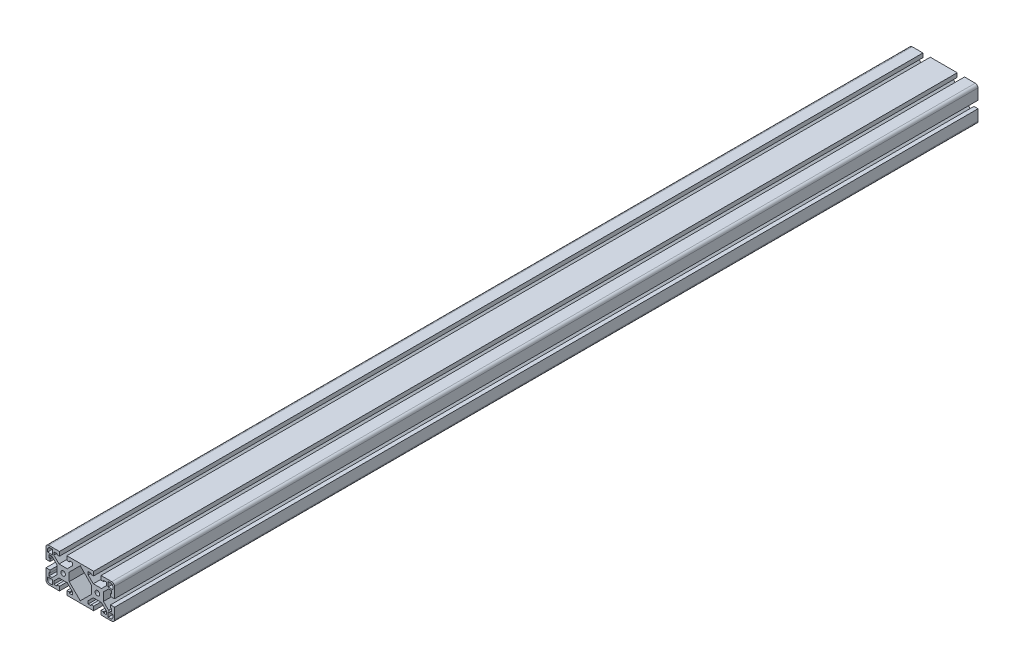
ISO-10303-21;
HEADER;
FILE_DESCRIPTION(('STEP AP214'),'2;1');
FILE_NAME('part.step','',(''),(''),'','','');
FILE_SCHEMA(('AUTOMOTIVE_DESIGN { 1 0 10303 214 1 1 1 1 }'));
ENDSEC;
DATA;
#1=APPLICATION_CONTEXT('core data for automotive mechanical design processes');
#2=APPLICATION_PROTOCOL_DEFINITION('international standard','automotive_design',2000,#1);
#3=PRODUCT_CONTEXT('',#1,'mechanical');
#4=PRODUCT('Part','Part','',(#3));
#5=PRODUCT_RELATED_PRODUCT_CATEGORY('part','',(#4));
#6=PRODUCT_DEFINITION_FORMATION('','',#4);
#7=PRODUCT_DEFINITION_CONTEXT('part definition',#1,'design');
#8=PRODUCT_DEFINITION('design','',#6,#7);
#9=PRODUCT_DEFINITION_SHAPE('','',#8);
#10=(LENGTH_UNIT() NAMED_UNIT(*) SI_UNIT(.MILLI.,.METRE.));
#11=(NAMED_UNIT(*) PLANE_ANGLE_UNIT() SI_UNIT($,.RADIAN.));
#12=(NAMED_UNIT(*) SI_UNIT($,.STERADIAN.) SOLID_ANGLE_UNIT());
#13=UNCERTAINTY_MEASURE_WITH_UNIT(LENGTH_MEASURE(1.E-05),#10,'distance_accuracy_value','');
#14=(GEOMETRIC_REPRESENTATION_CONTEXT(3) GLOBAL_UNCERTAINTY_ASSIGNED_CONTEXT((#13)) GLOBAL_UNIT_ASSIGNED_CONTEXT((#10,
#11,#12)) REPRESENTATION_CONTEXT('',''));
#15=CARTESIAN_POINT('',(0.,0.,0.));
#16=DIRECTION('',(0.,0.,1.));
#17=DIRECTION('',(1.,0.,0.));
#18=AXIS2_PLACEMENT_3D('',#15,#16,#17);
#19=CARTESIAN_POINT('',(-35.0519999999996,16.0020000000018,480.1235));
#20=DIRECTION('',(0.,0.,1.));
#21=DIRECTION('',(1.,0.,0.));
#22=AXIS2_PLACEMENT_3D('',#19,#20,#21);
#23=PLANE('',#22);
#24=CARTESIAN_POINT('',(-19.0499999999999,7.41594285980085E-13,480.1235));
#25=DIRECTION('',(0.,0.,1.));
#26=DIRECTION('',(1.,0.,0.));
#27=AXIS2_PLACEMENT_3D('',#24,#25,#26);
#28=CIRCLE('',#27,2.55270000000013);
#29=CARTESIAN_POINT('',(-21.6027,7.41594285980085E-13,480.1235));
#30=VERTEX_POINT('',#29);
#31=EDGE_CURVE('E921',#30,#30,#28,.T.);
#32=ORIENTED_EDGE('',*,*,#31,.F.);
#33=EDGE_LOOP('',(#32));
#34=FACE_BOUND('',#33,.T.);
#35=DIRECTION('',(-0.707106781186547,0.707106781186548,0.));
#36=VECTOR('',#35,1.);
#37=CARTESIAN_POINT('',(-23.6257385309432,6.73100000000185,480.1235));
#38=LINE('',#37,#36);
#39=CARTESIAN_POINT('',(-23.6257385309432,6.73100000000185,480.1235));
#40=VERTEX_POINT('',#39);
#41=CARTESIAN_POINT('',(-29.3369999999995,12.4422614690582,480.1235));
#42=VERTEX_POINT('',#41);
#43=EDGE_CURVE('E972',#40,#42,#38,.T.);
#44=ORIENTED_EDGE('',*,*,#43,.T.);
#45=DIRECTION('',(0.,1.,0.));
#46=VECTOR('',#45,1.);
#47=CARTESIAN_POINT('',(-29.3369999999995,12.4422614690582,480.1235));
#48=LINE('',#47,#46);
#49=CARTESIAN_POINT('',(-29.3369999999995,15.6718000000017,480.1235));
#50=VERTEX_POINT('',#49);
#51=EDGE_CURVE('E975',#42,#50,#48,.T.);
#52=ORIENTED_EDGE('',*,*,#51,.T.);
#53=DIRECTION('',(1.,0.,0.));
#54=VECTOR('',#53,1.);
#55=CARTESIAN_POINT('',(-29.3369999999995,15.6718000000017,480.1235));
#56=LINE('',#55,#54);
#57=CARTESIAN_POINT('',(-25.9079999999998,15.6718000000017,480.1235));
#58=VERTEX_POINT('',#57);
#59=EDGE_CURVE('E978',#50,#58,#56,.T.);
#60=ORIENTED_EDGE('',*,*,#59,.T.);
#61=DIRECTION('',(0.,-1.,0.));
#62=VECTOR('',#61,1.);
#63=CARTESIAN_POINT('',(-25.9079999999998,15.6718000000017,480.1235));
#64=LINE('',#63,#62);
#65=CARTESIAN_POINT('',(-25.9079999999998,14.5034000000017,480.1235));
#66=VERTEX_POINT('',#65);
#67=EDGE_CURVE('E980',#58,#66,#64,.T.);
#68=ORIENTED_EDGE('',*,*,#67,.T.);
#69=DIRECTION('',(1.,0.,0.));
#70=VECTOR('',#69,1.);
#71=CARTESIAN_POINT('',(-25.9079999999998,14.5034000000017,480.1235));
#72=LINE('',#71,#70);
#73=CARTESIAN_POINT('',(-23.1139999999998,14.5034000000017,480.1235));
#74=VERTEX_POINT('',#73);
#75=EDGE_CURVE('E982',#66,#74,#72,.T.);
#76=ORIENTED_EDGE('',*,*,#75,.T.);
#77=DIRECTION('',(0.,1.,0.));
#78=VECTOR('',#77,1.);
#79=CARTESIAN_POINT('',(-23.1139999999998,14.5034000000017,480.1235));
#80=LINE('',#79,#78);
#81=CARTESIAN_POINT('',(-23.1139999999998,19.0500000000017,480.1235));
#82=VERTEX_POINT('',#81);
#83=EDGE_CURVE('E984',#74,#82,#80,.T.);
#84=ORIENTED_EDGE('',*,*,#83,.T.);
#85=DIRECTION('',(-1.,0.,0.));
#86=VECTOR('',#85,1.);
#87=CARTESIAN_POINT('',(-23.1139999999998,19.0500000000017,480.1235));
#88=LINE('',#87,#86);
#89=CARTESIAN_POINT('',(-35.0519999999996,19.0500000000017,480.1235));
#90=VERTEX_POINT('',#89);
#91=EDGE_CURVE('E986',#82,#90,#88,.T.);
#92=ORIENTED_EDGE('',*,*,#91,.T.);
#93=CARTESIAN_POINT('',(-35.0519999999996,16.0020000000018,480.1235));
#94=DIRECTION('',(0.,0.,1.));
#95=DIRECTION('',(1.,0.,0.));
#96=AXIS2_PLACEMENT_3D('',#93,#94,#95);
#97=CIRCLE('',#96,3.04799999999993);
#98=CARTESIAN_POINT('',(-38.0999999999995,16.0020000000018,480.1235));
#99=VERTEX_POINT('',#98);
#100=EDGE_CURVE('E988',#90,#99,#97,.T.);
#101=ORIENTED_EDGE('',*,*,#100,.T.);
#102=DIRECTION('',(0.,-1.,0.));
#103=VECTOR('',#102,1.);
#104=CARTESIAN_POINT('',(-38.0999999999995,16.0020000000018,480.1235));
#105=LINE('',#104,#103);
#106=CARTESIAN_POINT('',(-38.0999999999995,4.06400000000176,480.1235));
#107=VERTEX_POINT('',#106);
#108=EDGE_CURVE('E990',#99,#107,#105,.T.);
#109=ORIENTED_EDGE('',*,*,#108,.T.);
#110=DIRECTION('',(1.,0.,0.));
#111=VECTOR('',#110,1.);
#112=CARTESIAN_POINT('',(-38.0999999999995,4.06400000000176,480.1235));
#113=LINE('',#112,#111);
#114=CARTESIAN_POINT('',(-33.5533999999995,4.06400000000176,480.1235));
#115=VERTEX_POINT('',#114);
#116=EDGE_CURVE('E992',#107,#115,#113,.T.);
#117=ORIENTED_EDGE('',*,*,#116,.T.);
#118=DIRECTION('',(0.,1.,0.));
#119=VECTOR('',#118,1.);
#120=CARTESIAN_POINT('',(-33.5533999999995,4.06400000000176,480.1235));
#121=LINE('',#120,#119);
#122=CARTESIAN_POINT('',(-33.5533999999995,6.85800000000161,480.1235));
#123=VERTEX_POINT('',#122);
#124=EDGE_CURVE('E994',#115,#123,#121,.T.);
#125=ORIENTED_EDGE('',*,*,#124,.T.);
#126=DIRECTION('',(-1.,0.,0.));
#127=VECTOR('',#126,1.);
#128=CARTESIAN_POINT('',(-33.5533999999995,6.85800000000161,480.1235));
#129=LINE('',#128,#127);
#130=CARTESIAN_POINT('',(-34.7217999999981,6.85800000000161,480.1235));
#131=VERTEX_POINT('',#130);
#132=EDGE_CURVE('E996',#123,#131,#129,.T.);
#133=ORIENTED_EDGE('',*,*,#132,.T.);
#134=DIRECTION('',(0.,1.,0.));
#135=VECTOR('',#134,1.);
#136=CARTESIAN_POINT('',(-34.7217999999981,6.85800000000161,480.1235));
#137=LINE('',#136,#135);
#138=CARTESIAN_POINT('',(-34.7217999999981,10.2870000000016,480.1235));
#139=VERTEX_POINT('',#138);
#140=EDGE_CURVE('E998',#131,#139,#137,.T.);
#141=ORIENTED_EDGE('',*,*,#140,.T.);
#142=DIRECTION('',(1.,0.,0.));
#143=VECTOR('',#142,1.);
#144=CARTESIAN_POINT('',(-34.7217999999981,10.2870000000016,480.1235));
#145=LINE('',#144,#143);
#146=CARTESIAN_POINT('',(-31.492261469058,10.2870000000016,480.1235));
#147=VERTEX_POINT('',#146);
#148=EDGE_CURVE('E1000',#139,#147,#145,.T.);
#149=ORIENTED_EDGE('',*,*,#148,.T.);
#150=DIRECTION('',(0.707106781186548,-0.707106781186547,0.));
#151=VECTOR('',#150,1.);
#152=CARTESIAN_POINT('',(-31.492261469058,10.2870000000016,480.1235));
#153=LINE('',#152,#151);
#154=CARTESIAN_POINT('',(-25.7810000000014,4.57573853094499,480.1235));
#155=VERTEX_POINT('',#154);
#156=EDGE_CURVE('E1002',#147,#155,#153,.T.);
#157=ORIENTED_EDGE('',*,*,#156,.T.);
#158=DIRECTION('',(0.,-1.,0.));
#159=VECTOR('',#158,1.);
#160=CARTESIAN_POINT('',(-25.7810000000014,4.57573853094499,480.1235));
#161=LINE('',#160,#159);
#162=CARTESIAN_POINT('',(-25.7810000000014,-4.57573853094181,480.1235));
#163=VERTEX_POINT('',#162);
#164=EDGE_CURVE('E1004',#155,#163,#161,.T.);
#165=ORIENTED_EDGE('',*,*,#164,.T.);
#166=DIRECTION('',(-0.707106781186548,-0.707106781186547,0.));
#167=VECTOR('',#166,1.);
#168=CARTESIAN_POINT('',(-25.7810000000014,-4.57573853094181,480.1235));
#169=LINE('',#168,#167);
#170=CARTESIAN_POINT('',(-31.492261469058,-10.2869999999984,480.1235));
#171=VERTEX_POINT('',#170);
#172=EDGE_CURVE('E1006',#163,#171,#169,.T.);
#173=ORIENTED_EDGE('',*,*,#172,.T.);
#174=DIRECTION('',(-1.,0.,0.));
#175=VECTOR('',#174,1.);
#176=CARTESIAN_POINT('',(-31.492261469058,-10.2869999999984,480.1235));
#177=LINE('',#176,#175);
#178=CARTESIAN_POINT('',(-34.7217999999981,-10.2869999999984,480.1235));
#179=VERTEX_POINT('',#178);
#180=EDGE_CURVE('E1008',#171,#179,#177,.T.);
#181=ORIENTED_EDGE('',*,*,#180,.T.);
#182=DIRECTION('',(0.,1.,0.));
#183=VECTOR('',#182,1.);
#184=CARTESIAN_POINT('',(-34.7217999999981,-10.2869999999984,480.1235));
#185=LINE('',#184,#183);
#186=CARTESIAN_POINT('',(-34.7217999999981,-6.85799999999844,480.1235));
#187=VERTEX_POINT('',#186);
#188=EDGE_CURVE('E1010',#179,#187,#185,.T.);
#189=ORIENTED_EDGE('',*,*,#188,.T.);
#190=DIRECTION('',(1.,0.,0.));
#191=VECTOR('',#190,1.);
#192=CARTESIAN_POINT('',(-34.7217999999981,-6.85799999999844,480.1235));
#193=LINE('',#192,#191);
#194=CARTESIAN_POINT('',(-33.5533999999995,-6.85799999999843,480.1235));
#195=VERTEX_POINT('',#194);
#196=EDGE_CURVE('E1012',#187,#195,#193,.T.);
#197=ORIENTED_EDGE('',*,*,#196,.T.);
#198=DIRECTION('',(0.,1.,0.));
#199=VECTOR('',#198,1.);
#200=CARTESIAN_POINT('',(-33.5533999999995,-6.85799999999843,480.1235));
#201=LINE('',#200,#199);
#202=CARTESIAN_POINT('',(-33.5533999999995,-4.06399999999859,480.1235));
#203=VERTEX_POINT('',#202);
#204=EDGE_CURVE('E1014',#195,#203,#201,.T.);
#205=ORIENTED_EDGE('',*,*,#204,.T.);
#206=DIRECTION('',(-1.,0.,0.));
#207=VECTOR('',#206,1.);
#208=CARTESIAN_POINT('',(-33.5533999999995,-4.06399999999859,480.1235));
#209=LINE('',#208,#207);
#210=CARTESIAN_POINT('',(-38.0999999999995,-4.06399999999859,480.1235));
#211=VERTEX_POINT('',#210);
#212=EDGE_CURVE('E1016',#203,#211,#209,.T.);
#213=ORIENTED_EDGE('',*,*,#212,.T.);
#214=DIRECTION('',(0.,-1.,0.));
#215=VECTOR('',#214,1.);
#216=CARTESIAN_POINT('',(-38.0999999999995,-4.06399999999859,480.1235));
#217=LINE('',#216,#215);
#218=CARTESIAN_POINT('',(-38.0999999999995,-16.0019999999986,480.1235));
#219=VERTEX_POINT('',#218);
#220=EDGE_CURVE('E1018',#211,#219,#217,.T.);
#221=ORIENTED_EDGE('',*,*,#220,.T.);
#222=CARTESIAN_POINT('',(-35.0519999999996,-16.0019999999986,480.1235));
#223=DIRECTION('',(0.,0.,1.));
#224=DIRECTION('',(1.,0.,0.));
#225=AXIS2_PLACEMENT_3D('',#222,#223,#224);
#226=CIRCLE('',#225,3.04799999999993);
#227=CARTESIAN_POINT('',(-35.0519999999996,-19.0499999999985,480.1235));
#228=VERTEX_POINT('',#227);
#229=EDGE_CURVE('E1020',#219,#228,#226,.T.);
#230=ORIENTED_EDGE('',*,*,#229,.T.);
#231=DIRECTION('',(1.,0.,0.));
#232=VECTOR('',#231,1.);
#233=CARTESIAN_POINT('',(-35.0519999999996,-19.0499999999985,480.1235));
#234=LINE('',#233,#232);
#235=CARTESIAN_POINT('',(-23.1139999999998,-19.0499999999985,480.1235));
#236=VERTEX_POINT('',#235);
#237=EDGE_CURVE('E1022',#228,#236,#234,.T.);
#238=ORIENTED_EDGE('',*,*,#237,.T.);
#239=DIRECTION('',(0.,1.,0.));
#240=VECTOR('',#239,1.);
#241=CARTESIAN_POINT('',(-23.1139999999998,-19.0499999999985,480.1235));
#242=LINE('',#241,#240);
#243=CARTESIAN_POINT('',(-23.1139999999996,-14.5033999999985,480.1235));
#244=VERTEX_POINT('',#243);
#245=EDGE_CURVE('E1024',#236,#244,#242,.T.);
#246=ORIENTED_EDGE('',*,*,#245,.T.);
#247=DIRECTION('',(-1.,0.,0.));
#248=VECTOR('',#247,1.);
#249=CARTESIAN_POINT('',(-23.1139999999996,-14.5033999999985,480.1235));
#250=LINE('',#249,#248);
#251=CARTESIAN_POINT('',(-25.9079999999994,-14.5033999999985,480.1235));
#252=VERTEX_POINT('',#251);
#253=EDGE_CURVE('E1026',#244,#252,#250,.T.);
#254=ORIENTED_EDGE('',*,*,#253,.T.);
#255=DIRECTION('',(0.,-1.,0.));
#256=VECTOR('',#255,1.);
#257=CARTESIAN_POINT('',(-25.9079999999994,-14.5033999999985,480.1235));
#258=LINE('',#257,#256);
#259=CARTESIAN_POINT('',(-25.9079999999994,-15.6717999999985,480.1235));
#260=VERTEX_POINT('',#259);
#261=EDGE_CURVE('E1028',#252,#260,#258,.T.);
#262=ORIENTED_EDGE('',*,*,#261,.T.);
#263=DIRECTION('',(-1.,0.,0.));
#264=VECTOR('',#263,1.);
#265=CARTESIAN_POINT('',(-25.9079999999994,-15.6717999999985,480.1235));
#266=LINE('',#265,#264);
#267=CARTESIAN_POINT('',(-29.3369999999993,-15.6717999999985,480.1235));
#268=VERTEX_POINT('',#267);
#269=EDGE_CURVE('E1030',#260,#268,#266,.T.);
#270=ORIENTED_EDGE('',*,*,#269,.T.);
#271=DIRECTION('',(0.,1.,0.));
#272=VECTOR('',#271,1.);
#273=CARTESIAN_POINT('',(-29.3369999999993,-15.6717999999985,480.1235));
#274=LINE('',#273,#272);
#275=CARTESIAN_POINT('',(-29.3369999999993,-12.442261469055,480.1235));
#276=VERTEX_POINT('',#275);
#277=EDGE_CURVE('E1032',#268,#276,#274,.T.);
#278=ORIENTED_EDGE('',*,*,#277,.T.);
#279=DIRECTION('',(0.70710678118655,0.707106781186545,0.));
#280=VECTOR('',#279,1.);
#281=CARTESIAN_POINT('',(-29.3369999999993,-12.442261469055,480.1235));
#282=LINE('',#281,#280);
#283=CARTESIAN_POINT('',(-23.6257385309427,-6.73099999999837,480.1235));
#284=VERTEX_POINT('',#283);
#285=EDGE_CURVE('E1034',#276,#284,#282,.T.);
#286=ORIENTED_EDGE('',*,*,#285,.T.);
#287=DIRECTION('',(1.,0.,0.));
#288=VECTOR('',#287,1.);
#289=CARTESIAN_POINT('',(-23.6257385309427,-6.73099999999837,480.1235));
#290=LINE('',#289,#288);
#291=CARTESIAN_POINT('',(-14.4742614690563,-6.73099999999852,480.1235));
#292=VERTEX_POINT('',#291);
#293=EDGE_CURVE('E1036',#284,#292,#290,.T.);
#294=ORIENTED_EDGE('',*,*,#293,.T.);
#295=DIRECTION('',(0.707106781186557,-0.707106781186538,0.));
#296=VECTOR('',#295,1.);
#297=CARTESIAN_POINT('',(-14.4742614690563,-6.73099999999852,480.1235));
#298=LINE('',#297,#296);
#299=CARTESIAN_POINT('',(-8.76299999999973,-12.442261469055,480.1235));
#300=VERTEX_POINT('',#299);
#301=EDGE_CURVE('E1038',#292,#300,#298,.T.);
#302=ORIENTED_EDGE('',*,*,#301,.T.);
#303=DIRECTION('',(0.,-1.,0.));
#304=VECTOR('',#303,1.);
#305=CARTESIAN_POINT('',(-8.76299999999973,-12.442261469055,480.1235));
#306=LINE('',#305,#304);
#307=CARTESIAN_POINT('',(-8.76299999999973,-15.6717999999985,480.1235));
#308=VERTEX_POINT('',#307);
#309=EDGE_CURVE('E1040',#300,#308,#306,.T.);
#310=ORIENTED_EDGE('',*,*,#309,.T.);
#311=DIRECTION('',(-1.,0.,0.));
#312=VECTOR('',#311,1.);
#313=CARTESIAN_POINT('',(-8.76299999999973,-15.6717999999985,480.1235));
#314=LINE('',#313,#312);
#315=CARTESIAN_POINT('',(-12.1919999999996,-15.6717999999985,480.1235));
#316=VERTEX_POINT('',#315);
#317=EDGE_CURVE('E1042',#308,#316,#314,.T.);
#318=ORIENTED_EDGE('',*,*,#317,.T.);
#319=DIRECTION('',(0.,1.,0.));
#320=VECTOR('',#319,1.);
#321=CARTESIAN_POINT('',(-12.1919999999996,-15.6717999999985,480.1235));
#322=LINE('',#321,#320);
#323=CARTESIAN_POINT('',(-12.1919999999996,-14.5033999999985,480.1235));
#324=VERTEX_POINT('',#323);
#325=EDGE_CURVE('E1044',#316,#324,#322,.T.);
#326=ORIENTED_EDGE('',*,*,#325,.T.);
#327=DIRECTION('',(-1.,0.,0.));
#328=VECTOR('',#327,1.);
#329=CARTESIAN_POINT('',(-12.1919999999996,-14.5033999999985,480.1235));
#330=LINE('',#329,#328);
#331=CARTESIAN_POINT('',(-14.9859999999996,-14.5033999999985,480.1235));
#332=VERTEX_POINT('',#331);
#333=EDGE_CURVE('E1046',#324,#332,#330,.T.);
#334=ORIENTED_EDGE('',*,*,#333,.T.);
#335=DIRECTION('',(0.,-1.,0.));
#336=VECTOR('',#335,1.);
#337=CARTESIAN_POINT('',(-14.9859999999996,-14.5033999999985,480.1235));
#338=LINE('',#337,#336);
#339=CARTESIAN_POINT('',(-14.9859999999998,-19.0499999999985,480.1235));
#340=VERTEX_POINT('',#339);
#341=EDGE_CURVE('E1048',#332,#340,#338,.T.);
#342=ORIENTED_EDGE('',*,*,#341,.T.);
#343=DIRECTION('',(1.,0.,0.));
#344=VECTOR('',#343,1.);
#345=CARTESIAN_POINT('',(-14.9859999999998,-19.0499999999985,480.1235));
#346=LINE('',#345,#344);
#347=CARTESIAN_POINT('',(14.986,-19.0499999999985,480.1235));
#348=VERTEX_POINT('',#347);
#349=EDGE_CURVE('E1050',#340,#348,#346,.T.);
#350=ORIENTED_EDGE('',*,*,#349,.T.);
#351=DIRECTION('',(0.,1.,0.));
#352=VECTOR('',#351,1.);
#353=CARTESIAN_POINT('',(14.986,-19.0499999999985,480.1235));
#354=LINE('',#353,#352);
#355=CARTESIAN_POINT('',(14.9859999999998,-14.5033999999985,480.1235));
#356=VERTEX_POINT('',#355);
#357=EDGE_CURVE('E1052',#348,#356,#354,.T.);
#358=ORIENTED_EDGE('',*,*,#357,.T.);
#359=DIRECTION('',(-1.,0.,0.));
#360=VECTOR('',#359,1.);
#361=CARTESIAN_POINT('',(14.9859999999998,-14.5033999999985,480.1235));
#362=LINE('',#361,#360);
#363=CARTESIAN_POINT('',(12.1919999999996,-14.5033999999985,480.1235));
#364=VERTEX_POINT('',#363);
#365=EDGE_CURVE('E1054',#356,#364,#362,.T.);
#366=ORIENTED_EDGE('',*,*,#365,.T.);
#367=DIRECTION('',(0.,-1.,0.));
#368=VECTOR('',#367,1.);
#369=CARTESIAN_POINT('',(12.1919999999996,-14.5033999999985,480.1235));
#370=LINE('',#369,#368);
#371=CARTESIAN_POINT('',(12.1919999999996,-15.6717999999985,480.1235));
#372=VERTEX_POINT('',#371);
#373=EDGE_CURVE('E1056',#364,#372,#370,.T.);
#374=ORIENTED_EDGE('',*,*,#373,.T.);
#375=DIRECTION('',(-1.,0.,0.));
#376=VECTOR('',#375,1.);
#377=CARTESIAN_POINT('',(12.1919999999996,-15.6717999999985,480.1235));
#378=LINE('',#377,#376);
#379=CARTESIAN_POINT('',(8.76299999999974,-15.6717999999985,480.1235));
#380=VERTEX_POINT('',#379);
#381=EDGE_CURVE('E1058',#372,#380,#378,.T.);
#382=ORIENTED_EDGE('',*,*,#381,.T.);
#383=DIRECTION('',(0.,1.,0.));
#384=VECTOR('',#383,1.);
#385=CARTESIAN_POINT('',(8.76299999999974,-15.6717999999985,480.1235));
#386=LINE('',#385,#384);
#387=CARTESIAN_POINT('',(8.76299999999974,-12.442261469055,480.1235));
#388=VERTEX_POINT('',#387);
#389=EDGE_CURVE('E1060',#380,#388,#386,.T.);
#390=ORIENTED_EDGE('',*,*,#389,.T.);
#391=DIRECTION('',(0.70710678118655,0.707106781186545,0.));
#392=VECTOR('',#391,1.);
#393=CARTESIAN_POINT('',(8.76299999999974,-12.442261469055,480.1235));
#394=LINE('',#393,#392);
#395=CARTESIAN_POINT('',(14.4742614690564,-6.73099999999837,480.1235));
#396=VERTEX_POINT('',#395);
#397=EDGE_CURVE('E1062',#388,#396,#394,.T.);
#398=ORIENTED_EDGE('',*,*,#397,.T.);
#399=DIRECTION('',(1.,0.,0.));
#400=VECTOR('',#399,1.);
#401=CARTESIAN_POINT('',(14.4742614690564,-6.73099999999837,480.1235));
#402=LINE('',#401,#400);
#403=CARTESIAN_POINT('',(23.6257385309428,-6.73099999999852,480.1235));
#404=VERTEX_POINT('',#403);
#405=EDGE_CURVE('E1064',#396,#404,#402,.T.);
#406=ORIENTED_EDGE('',*,*,#405,.T.);
#407=DIRECTION('',(0.707106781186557,-0.707106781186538,0.));
#408=VECTOR('',#407,1.);
#409=CARTESIAN_POINT('',(23.6257385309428,-6.73099999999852,480.1235));
#410=LINE('',#409,#408);
#411=CARTESIAN_POINT('',(29.3369999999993,-12.442261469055,480.1235));
#412=VERTEX_POINT('',#411);
#413=EDGE_CURVE('E1066',#404,#412,#410,.T.);
#414=ORIENTED_EDGE('',*,*,#413,.T.);
#415=DIRECTION('',(0.,-1.,0.));
#416=VECTOR('',#415,1.);
#417=CARTESIAN_POINT('',(29.3369999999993,-12.442261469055,480.1235));
#418=LINE('',#417,#416);
#419=CARTESIAN_POINT('',(29.3369999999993,-15.6717999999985,480.1235));
#420=VERTEX_POINT('',#419);
#421=EDGE_CURVE('E1068',#412,#420,#418,.T.);
#422=ORIENTED_EDGE('',*,*,#421,.T.);
#423=DIRECTION('',(-1.,0.,0.));
#424=VECTOR('',#423,1.);
#425=CARTESIAN_POINT('',(29.3369999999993,-15.6717999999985,480.1235));
#426=LINE('',#425,#424);
#427=CARTESIAN_POINT('',(25.9079999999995,-15.6717999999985,480.1235));
#428=VERTEX_POINT('',#427);
#429=EDGE_CURVE('E1070',#420,#428,#426,.T.);
#430=ORIENTED_EDGE('',*,*,#429,.T.);
#431=DIRECTION('',(0.,1.,0.));
#432=VECTOR('',#431,1.);
#433=CARTESIAN_POINT('',(25.9079999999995,-15.6717999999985,480.1235));
#434=LINE('',#433,#432);
#435=CARTESIAN_POINT('',(25.9079999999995,-14.5033999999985,480.1235));
#436=VERTEX_POINT('',#435);
#437=EDGE_CURVE('E1072',#428,#436,#434,.T.);
#438=ORIENTED_EDGE('',*,*,#437,.T.);
#439=DIRECTION('',(-1.,0.,0.));
#440=VECTOR('',#439,1.);
#441=CARTESIAN_POINT('',(25.9079999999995,-14.5033999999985,480.1235));
#442=LINE('',#441,#440);
#443=CARTESIAN_POINT('',(23.1139999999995,-14.5033999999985,480.1235));
#444=VERTEX_POINT('',#443);
#445=EDGE_CURVE('E1074',#436,#444,#442,.T.);
#446=ORIENTED_EDGE('',*,*,#445,.T.);
#447=DIRECTION('',(0.,-1.,0.));
#448=VECTOR('',#447,1.);
#449=CARTESIAN_POINT('',(23.1139999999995,-14.5033999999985,480.1235));
#450=LINE('',#449,#448);
#451=CARTESIAN_POINT('',(23.1139999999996,-19.0499999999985,480.1235));
#452=VERTEX_POINT('',#451);
#453=EDGE_CURVE('E1076',#444,#452,#450,.T.);
#454=ORIENTED_EDGE('',*,*,#453,.T.);
#455=DIRECTION('',(1.,0.,0.));
#456=VECTOR('',#455,1.);
#457=CARTESIAN_POINT('',(23.1139999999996,-19.0499999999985,480.1235));
#458=LINE('',#457,#456);
#459=CARTESIAN_POINT('',(35.0519999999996,-19.0499999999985,480.1235));
#460=VERTEX_POINT('',#459);
#461=EDGE_CURVE('E1078',#452,#460,#458,.T.);
#462=ORIENTED_EDGE('',*,*,#461,.T.);
#463=CARTESIAN_POINT('',(35.0519999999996,-16.0019999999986,480.1235));
#464=DIRECTION('',(0.,0.,1.));
#465=DIRECTION('',(1.,0.,0.));
#466=AXIS2_PLACEMENT_3D('',#463,#464,#465);
#467=CIRCLE('',#466,3.04799999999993);
#468=CARTESIAN_POINT('',(38.0999999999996,-16.0019999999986,480.1235));
#469=VERTEX_POINT('',#468);
#470=EDGE_CURVE('E1080',#460,#469,#467,.T.);
#471=ORIENTED_EDGE('',*,*,#470,.T.);
#472=DIRECTION('',(0.,1.,0.));
#473=VECTOR('',#472,1.);
#474=CARTESIAN_POINT('',(38.0999999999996,-16.0019999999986,480.1235));
#475=LINE('',#474,#473);
#476=CARTESIAN_POINT('',(38.0999999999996,-4.06399999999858,480.1235));
#477=VERTEX_POINT('',#476);
#478=EDGE_CURVE('E1082',#469,#477,#475,.T.);
#479=ORIENTED_EDGE('',*,*,#478,.T.);
#480=DIRECTION('',(-1.,0.,0.));
#481=VECTOR('',#480,1.);
#482=CARTESIAN_POINT('',(38.0999999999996,-4.06399999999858,480.1235));
#483=LINE('',#482,#481);
#484=CARTESIAN_POINT('',(33.5533999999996,-4.06399999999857,480.1235));
#485=VERTEX_POINT('',#484);
#486=EDGE_CURVE('E1084',#477,#485,#483,.T.);
#487=ORIENTED_EDGE('',*,*,#486,.T.);
#488=DIRECTION('',(0.,-1.,0.));
#489=VECTOR('',#488,1.);
#490=CARTESIAN_POINT('',(33.5533999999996,-4.06399999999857,480.1235));
#491=LINE('',#490,#489);
#492=CARTESIAN_POINT('',(33.5533999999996,-6.85799999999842,480.1235));
#493=VERTEX_POINT('',#492);
#494=EDGE_CURVE('E1086',#485,#493,#491,.T.);
#495=ORIENTED_EDGE('',*,*,#494,.T.);
#496=DIRECTION('',(1.,0.,0.));
#497=VECTOR('',#496,1.);
#498=CARTESIAN_POINT('',(33.5533999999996,-6.85799999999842,480.1235));
#499=LINE('',#498,#497);
#500=CARTESIAN_POINT('',(34.7217999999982,-6.85799999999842,480.1235));
#501=VERTEX_POINT('',#500);
#502=EDGE_CURVE('E1088',#493,#501,#499,.T.);
#503=ORIENTED_EDGE('',*,*,#502,.T.);
#504=DIRECTION('',(0.,-1.,0.));
#505=VECTOR('',#504,1.);
#506=CARTESIAN_POINT('',(34.7217999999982,-6.85799999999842,480.1235));
#507=LINE('',#506,#505);
#508=CARTESIAN_POINT('',(34.7217999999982,-10.2869999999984,480.1235));
#509=VERTEX_POINT('',#508);
#510=EDGE_CURVE('E1090',#501,#509,#507,.T.);
#511=ORIENTED_EDGE('',*,*,#510,.T.);
#512=DIRECTION('',(-1.,0.,0.));
#513=VECTOR('',#512,1.);
#514=CARTESIAN_POINT('',(34.7217999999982,-10.2869999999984,480.1235));
#515=LINE('',#514,#513);
#516=CARTESIAN_POINT('',(31.492261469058,-10.2869999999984,480.1235));
#517=VERTEX_POINT('',#516);
#518=EDGE_CURVE('E1092',#509,#517,#515,.T.);
#519=ORIENTED_EDGE('',*,*,#518,.T.);
#520=DIRECTION('',(-0.707106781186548,0.707106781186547,0.));
#521=VECTOR('',#520,1.);
#522=CARTESIAN_POINT('',(31.492261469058,-10.2869999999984,480.1235));
#523=LINE('',#522,#521);
#524=CARTESIAN_POINT('',(25.7810000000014,-4.5757385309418,480.1235));
#525=VERTEX_POINT('',#524);
#526=EDGE_CURVE('E1094',#517,#525,#523,.T.);
#527=ORIENTED_EDGE('',*,*,#526,.T.);
#528=DIRECTION('',(0.,1.,0.));
#529=VECTOR('',#528,1.);
#530=CARTESIAN_POINT('',(25.7810000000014,-4.5757385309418,480.1235));
#531=LINE('',#530,#529);
#532=CARTESIAN_POINT('',(25.7810000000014,4.57573853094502,480.1235));
#533=VERTEX_POINT('',#532);
#534=EDGE_CURVE('E1096',#525,#533,#531,.T.);
#535=ORIENTED_EDGE('',*,*,#534,.T.);
#536=DIRECTION('',(0.707106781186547,0.707106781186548,0.));
#537=VECTOR('',#536,1.);
#538=CARTESIAN_POINT('',(25.7810000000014,4.57573853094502,480.1235));
#539=LINE('',#538,#537);
#540=CARTESIAN_POINT('',(31.492261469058,10.2870000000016,480.1235));
#541=VERTEX_POINT('',#540);
#542=EDGE_CURVE('E1098',#533,#541,#539,.T.);
#543=ORIENTED_EDGE('',*,*,#542,.T.);
#544=DIRECTION('',(1.,0.,0.));
#545=VECTOR('',#544,1.);
#546=CARTESIAN_POINT('',(31.492261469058,10.2870000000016,480.1235));
#547=LINE('',#546,#545);
#548=CARTESIAN_POINT('',(34.7217999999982,10.2870000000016,480.1235));
#549=VERTEX_POINT('',#548);
#550=EDGE_CURVE('E1100',#541,#549,#547,.T.);
#551=ORIENTED_EDGE('',*,*,#550,.T.);
#552=DIRECTION('',(0.,-1.,0.));
#553=VECTOR('',#552,1.);
#554=CARTESIAN_POINT('',(34.7217999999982,10.2870000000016,480.1235));
#555=LINE('',#554,#553);
#556=CARTESIAN_POINT('',(34.7217999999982,6.85800000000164,480.1235));
#557=VERTEX_POINT('',#556);
#558=EDGE_CURVE('E1102',#549,#557,#555,.T.);
#559=ORIENTED_EDGE('',*,*,#558,.T.);
#560=DIRECTION('',(-1.,0.,0.));
#561=VECTOR('',#560,1.);
#562=CARTESIAN_POINT('',(34.7217999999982,6.85800000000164,480.1235));
#563=LINE('',#562,#561);
#564=CARTESIAN_POINT('',(33.5533999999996,6.85800000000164,480.1235));
#565=VERTEX_POINT('',#564);
#566=EDGE_CURVE('E1104',#557,#565,#563,.T.);
#567=ORIENTED_EDGE('',*,*,#566,.T.);
#568=DIRECTION('',(0.,-1.,0.));
#569=VECTOR('',#568,1.);
#570=CARTESIAN_POINT('',(33.5533999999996,6.85800000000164,480.1235));
#571=LINE('',#570,#569);
#572=CARTESIAN_POINT('',(33.5533999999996,4.06400000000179,480.1235));
#573=VERTEX_POINT('',#572);
#574=EDGE_CURVE('E1106',#565,#573,#571,.T.);
#575=ORIENTED_EDGE('',*,*,#574,.T.);
#576=DIRECTION('',(1.,0.,0.));
#577=VECTOR('',#576,1.);
#578=CARTESIAN_POINT('',(33.5533999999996,4.06400000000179,480.1235));
#579=LINE('',#578,#577);
#580=CARTESIAN_POINT('',(38.0999999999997,4.06400000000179,480.1235));
#581=VERTEX_POINT('',#580);
#582=EDGE_CURVE('E1108',#573,#581,#579,.T.);
#583=ORIENTED_EDGE('',*,*,#582,.T.);
#584=DIRECTION('',(0.,1.,0.));
#585=VECTOR('',#584,1.);
#586=CARTESIAN_POINT('',(38.0999999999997,4.06400000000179,480.1235));
#587=LINE('',#586,#585);
#588=CARTESIAN_POINT('',(38.0999999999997,16.0020000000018,480.1235));
#589=VERTEX_POINT('',#588);
#590=EDGE_CURVE('E1110',#581,#589,#587,.T.);
#591=ORIENTED_EDGE('',*,*,#590,.T.);
#592=CARTESIAN_POINT('',(35.0519999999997,16.0020000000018,480.1235));
#593=DIRECTION('',(0.,0.,1.));
#594=DIRECTION('',(1.,0.,0.));
#595=AXIS2_PLACEMENT_3D('',#592,#593,#594);
#596=CIRCLE('',#595,3.04799999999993);
#597=CARTESIAN_POINT('',(35.0519999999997,19.0500000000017,480.1235));
#598=VERTEX_POINT('',#597);
#599=EDGE_CURVE('E1112',#589,#598,#596,.T.);
#600=ORIENTED_EDGE('',*,*,#599,.T.);
#601=DIRECTION('',(-1.,0.,0.));
#602=VECTOR('',#601,1.);
#603=CARTESIAN_POINT('',(35.0519999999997,19.0500000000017,480.1235));
#604=LINE('',#603,#602);
#605=CARTESIAN_POINT('',(23.114,19.0500000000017,480.1235));
#606=VERTEX_POINT('',#605);
#607=EDGE_CURVE('E1114',#598,#606,#604,.T.);
#608=ORIENTED_EDGE('',*,*,#607,.T.);
#609=DIRECTION('',(0.,-1.,0.));
#610=VECTOR('',#609,1.);
#611=CARTESIAN_POINT('',(23.114,19.0500000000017,480.1235));
#612=LINE('',#611,#610);
#613=CARTESIAN_POINT('',(23.114,14.5034000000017,480.1235));
#614=VERTEX_POINT('',#613);
#615=EDGE_CURVE('E1116',#606,#614,#612,.T.);
#616=ORIENTED_EDGE('',*,*,#615,.T.);
#617=DIRECTION('',(1.,0.,0.));
#618=VECTOR('',#617,1.);
#619=CARTESIAN_POINT('',(23.114,14.5034000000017,480.1235));
#620=LINE('',#619,#618);
#621=CARTESIAN_POINT('',(25.908,14.5034000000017,480.1235));
#622=VERTEX_POINT('',#621);
#623=EDGE_CURVE('E1118',#614,#622,#620,.T.);
#624=ORIENTED_EDGE('',*,*,#623,.T.);
#625=DIRECTION('',(0.,1.,0.));
#626=VECTOR('',#625,1.);
#627=CARTESIAN_POINT('',(25.908,14.5034000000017,480.1235));
#628=LINE('',#627,#626);
#629=CARTESIAN_POINT('',(25.908,15.6718000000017,480.1235));
#630=VERTEX_POINT('',#629);
#631=EDGE_CURVE('E1120',#622,#630,#628,.T.);
#632=ORIENTED_EDGE('',*,*,#631,.T.);
#633=DIRECTION('',(1.,0.,0.));
#634=VECTOR('',#633,1.);
#635=CARTESIAN_POINT('',(25.908,15.6718000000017,480.1235));
#636=LINE('',#635,#634);
#637=CARTESIAN_POINT('',(29.3369999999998,15.6718000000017,480.1235));
#638=VERTEX_POINT('',#637);
#639=EDGE_CURVE('E1122',#630,#638,#636,.T.);
#640=ORIENTED_EDGE('',*,*,#639,.T.);
#641=DIRECTION('',(0.,-1.,0.));
#642=VECTOR('',#641,1.);
#643=CARTESIAN_POINT('',(29.3369999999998,15.6718000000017,480.1235));
#644=LINE('',#643,#642);
#645=CARTESIAN_POINT('',(29.3369999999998,12.4422614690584,480.1235));
#646=VERTEX_POINT('',#645);
#647=EDGE_CURVE('E1124',#638,#646,#644,.T.);
#648=ORIENTED_EDGE('',*,*,#647,.T.);
#649=DIRECTION('',(-0.707106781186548,-0.707106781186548,0.));
#650=VECTOR('',#649,1.);
#651=CARTESIAN_POINT('',(29.3369999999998,12.4422614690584,480.1235));
#652=LINE('',#651,#650);
#653=CARTESIAN_POINT('',(23.6257385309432,6.73100000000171,480.1235));
#654=VERTEX_POINT('',#653);
#655=EDGE_CURVE('E1126',#646,#654,#652,.T.);
#656=ORIENTED_EDGE('',*,*,#655,.T.);
#657=DIRECTION('',(-1.,0.,0.));
#658=VECTOR('',#657,1.);
#659=CARTESIAN_POINT('',(23.6257385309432,6.73100000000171,480.1235));
#660=LINE('',#659,#658);
#661=CARTESIAN_POINT('',(14.4742614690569,6.73100000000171,480.1235));
#662=VERTEX_POINT('',#661);
#663=EDGE_CURVE('E1128',#654,#662,#660,.T.);
#664=ORIENTED_EDGE('',*,*,#663,.T.);
#665=DIRECTION('',(-0.707106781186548,0.707106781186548,0.));
#666=VECTOR('',#665,1.);
#667=CARTESIAN_POINT('',(14.4742614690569,6.73100000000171,480.1235));
#668=LINE('',#667,#666);
#669=CARTESIAN_POINT('',(8.7630000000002,12.4422614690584,480.1235));
#670=VERTEX_POINT('',#669);
#671=EDGE_CURVE('E1130',#662,#670,#668,.T.);
#672=ORIENTED_EDGE('',*,*,#671,.T.);
#673=DIRECTION('',(0.,1.,0.));
#674=VECTOR('',#673,1.);
#675=CARTESIAN_POINT('',(8.7630000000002,12.4422614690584,480.1235));
#676=LINE('',#675,#674);
#677=CARTESIAN_POINT('',(8.7630000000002,15.671800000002,480.1235));
#678=VERTEX_POINT('',#677);
#679=EDGE_CURVE('E1132',#670,#678,#676,.T.);
#680=ORIENTED_EDGE('',*,*,#679,.T.);
#681=DIRECTION('',(1.,0.,0.));
#682=VECTOR('',#681,1.);
#683=CARTESIAN_POINT('',(8.7630000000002,15.671800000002,480.1235));
#684=LINE('',#683,#682);
#685=CARTESIAN_POINT('',(12.1920000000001,15.671800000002,480.1235));
#686=VERTEX_POINT('',#685);
#687=EDGE_CURVE('E1134',#678,#686,#684,.T.);
#688=ORIENTED_EDGE('',*,*,#687,.T.);
#689=DIRECTION('',(0.,-1.,0.));
#690=VECTOR('',#689,1.);
#691=CARTESIAN_POINT('',(12.1920000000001,15.671800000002,480.1235));
#692=LINE('',#691,#690);
#693=CARTESIAN_POINT('',(12.1920000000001,14.503400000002,480.1235));
#694=VERTEX_POINT('',#693);
#695=EDGE_CURVE('E1136',#686,#694,#692,.T.);
#696=ORIENTED_EDGE('',*,*,#695,.T.);
#697=DIRECTION('',(1.,0.,0.));
#698=VECTOR('',#697,1.);
#699=CARTESIAN_POINT('',(12.1920000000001,14.503400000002,480.1235));
#700=LINE('',#699,#698);
#701=CARTESIAN_POINT('',(14.9860000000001,14.503400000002,480.1235));
#702=VERTEX_POINT('',#701);
#703=EDGE_CURVE('E1138',#694,#702,#700,.T.);
#704=ORIENTED_EDGE('',*,*,#703,.T.);
#705=DIRECTION('',(0.,1.,0.));
#706=VECTOR('',#705,1.);
#707=CARTESIAN_POINT('',(14.9860000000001,14.503400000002,480.1235));
#708=LINE('',#707,#706);
#709=CARTESIAN_POINT('',(14.9860000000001,19.050000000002,480.1235));
#710=VERTEX_POINT('',#709);
#711=EDGE_CURVE('E1140',#702,#710,#708,.T.);
#712=ORIENTED_EDGE('',*,*,#711,.T.);
#713=DIRECTION('',(-1.,0.,0.));
#714=VECTOR('',#713,1.);
#715=CARTESIAN_POINT('',(14.9860000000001,19.050000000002,480.1235));
#716=LINE('',#715,#714);
#717=CARTESIAN_POINT('',(-14.9859999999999,19.050000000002,480.1235));
#718=VERTEX_POINT('',#717);
#719=EDGE_CURVE('E1142',#710,#718,#716,.T.);
#720=ORIENTED_EDGE('',*,*,#719,.T.);
#721=DIRECTION('',(0.,-1.,0.));
#722=VECTOR('',#721,1.);
#723=CARTESIAN_POINT('',(-14.9859999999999,19.050000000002,480.1235));
#724=LINE('',#723,#722);
#725=CARTESIAN_POINT('',(-14.9859999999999,14.503400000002,480.1235));
#726=VERTEX_POINT('',#725);
#727=EDGE_CURVE('E1144',#718,#726,#724,.T.);
#728=ORIENTED_EDGE('',*,*,#727,.T.);
#729=DIRECTION('',(1.,0.,0.));
#730=VECTOR('',#729,1.);
#731=CARTESIAN_POINT('',(-14.9859999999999,14.503400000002,480.1235));
#732=LINE('',#731,#730);
#733=CARTESIAN_POINT('',(-12.1919999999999,14.503400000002,480.1235));
#734=VERTEX_POINT('',#733);
#735=EDGE_CURVE('E1146',#726,#734,#732,.T.);
#736=ORIENTED_EDGE('',*,*,#735,.T.);
#737=DIRECTION('',(0.,1.,0.));
#738=VECTOR('',#737,1.);
#739=CARTESIAN_POINT('',(-12.1919999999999,14.503400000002,480.1235));
#740=LINE('',#739,#738);
#741=CARTESIAN_POINT('',(-12.1919999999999,15.671800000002,480.1235));
#742=VERTEX_POINT('',#741);
#743=EDGE_CURVE('E1148',#734,#742,#740,.T.);
#744=ORIENTED_EDGE('',*,*,#743,.T.);
#745=DIRECTION('',(1.,0.,0.));
#746=VECTOR('',#745,1.);
#747=CARTESIAN_POINT('',(-12.1919999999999,15.671800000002,480.1235));
#748=LINE('',#747,#746);
#749=CARTESIAN_POINT('',(-8.76300000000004,15.671800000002,480.1235));
#750=VERTEX_POINT('',#749);
#751=EDGE_CURVE('E1150',#742,#750,#748,.T.);
#752=ORIENTED_EDGE('',*,*,#751,.T.);
#753=DIRECTION('',(0.,-1.,0.));
#754=VECTOR('',#753,1.);
#755=CARTESIAN_POINT('',(-8.76300000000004,15.671800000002,480.1235));
#756=LINE('',#755,#754);
#757=CARTESIAN_POINT('',(-8.76300000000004,12.4422614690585,480.1235));
#758=VERTEX_POINT('',#757);
#759=EDGE_CURVE('E1152',#750,#758,#756,.T.);
#760=ORIENTED_EDGE('',*,*,#759,.T.);
#761=DIRECTION('',(-0.707106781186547,-0.707106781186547,0.));
#762=VECTOR('',#761,1.);
#763=CARTESIAN_POINT('',(-8.76300000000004,12.4422614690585,480.1235));
#764=LINE('',#763,#762);
#765=CARTESIAN_POINT('',(-14.4742614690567,6.73100000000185,480.1235));
#766=VERTEX_POINT('',#765);
#767=EDGE_CURVE('E1154',#758,#766,#764,.T.);
#768=ORIENTED_EDGE('',*,*,#767,.T.);
#769=DIRECTION('',(-1.,0.,0.));
#770=VECTOR('',#769,1.);
#771=CARTESIAN_POINT('',(-14.4742614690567,6.73100000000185,480.1235));
#772=LINE('',#771,#770);
#773=EDGE_CURVE('E1156',#766,#40,#772,.T.);
#774=ORIENTED_EDGE('',*,*,#773,.T.);
#775=EDGE_LOOP('',(#44,#52,#60,#68,#76,#84,#92,#101,#109,#117,#125,#133,#141,#149,#157,#165,
#173,#181,#189,#197,#205,#213,#221,#230,#238,#246,#254,#262,#270,#278,#286,#294,#302,#310,#318,
#326,#334,#342,#350,#358,#366,#374,#382,#390,#398,#406,#414,#422,#430,#438,#446,#454,#462,#471,
#479,#487,#495,#503,#511,#519,#527,#535,#543,#551,#559,#567,#575,#583,#591,#600,#608,#616,#624,
#632,#640,#648,#656,#664,#672,#680,#688,#696,#704,#712,#720,#728,#736,#744,#752,#760,#768,#774));
#776=FACE_BOUND('',#775,.T.);
#777=DIRECTION('',(0.707106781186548,0.707106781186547,0.));
#778=VECTOR('',#777,1.);
#779=CARTESIAN_POINT('',(0.,-16.8947385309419,480.1235));
#780=LINE('',#779,#778);
#781=CARTESIAN_POINT('',(0.,-16.8947385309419,480.1235));
#782=VERTEX_POINT('',#781);
#783=CARTESIAN_POINT('',(12.3189999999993,-4.57573853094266,480.1235));
#784=VERTEX_POINT('',#783);
#785=EDGE_CURVE('E929',#782,#784,#780,.T.);
#786=ORIENTED_EDGE('',*,*,#785,.F.);
#787=DIRECTION('',(0.707106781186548,-0.707106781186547,0.));
#788=VECTOR('',#787,1.);
#789=CARTESIAN_POINT('',(-12.3189999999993,-4.57573853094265,480.1235));
#790=LINE('',#789,#788);
#791=CARTESIAN_POINT('',(-12.3189999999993,-4.57573853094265,480.1235));
#792=VERTEX_POINT('',#791);
#793=EDGE_CURVE('E927',#792,#782,#790,.T.);
#794=ORIENTED_EDGE('',*,*,#793,.F.);
#795=DIRECTION('',(0.,-1.,0.));
#796=VECTOR('',#795,1.);
#797=CARTESIAN_POINT('',(-12.3189999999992,4.57573853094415,480.1235));
#798=LINE('',#797,#796);
#799=CARTESIAN_POINT('',(-12.3189999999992,4.57573853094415,480.1235));
#800=VERTEX_POINT('',#799);
#801=EDGE_CURVE('E939',#800,#792,#798,.T.);
#802=ORIENTED_EDGE('',*,*,#801,.F.);
#803=DIRECTION('',(-0.707106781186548,-0.707106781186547,0.));
#804=VECTOR('',#803,1.);
#805=CARTESIAN_POINT('',(0.,16.8947385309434,480.1235));
#806=LINE('',#805,#804);
#807=CARTESIAN_POINT('',(0.,16.8947385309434,480.1235));
#808=VERTEX_POINT('',#807);
#809=EDGE_CURVE('E936',#808,#800,#806,.T.);
#810=ORIENTED_EDGE('',*,*,#809,.F.);
#811=DIRECTION('',(-0.707106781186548,0.707106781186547,0.));
#812=VECTOR('',#811,1.);
#813=CARTESIAN_POINT('',(12.3189999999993,4.57573853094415,480.1235));
#814=LINE('',#813,#812);
#815=CARTESIAN_POINT('',(12.3189999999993,4.57573853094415,480.1235));
#816=VERTEX_POINT('',#815);
#817=EDGE_CURVE('E934',#816,#808,#814,.T.);
#818=ORIENTED_EDGE('',*,*,#817,.F.);
#819=DIRECTION('',(0.,1.,0.));
#820=VECTOR('',#819,1.);
#821=CARTESIAN_POINT('',(12.3189999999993,-4.57573853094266,480.1235));
#822=LINE('',#821,#820);
#823=EDGE_CURVE('E932',#784,#816,#822,.T.);
#824=ORIENTED_EDGE('',*,*,#823,.F.);
#825=EDGE_LOOP('',(#786,#794,#802,#810,#818,#824));
#826=FACE_BOUND('',#825,.T.);
#827=CARTESIAN_POINT('',(19.0499999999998,7.50267903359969E-13,480.1235));
#828=DIRECTION('',(0.,0.,1.));
#829=DIRECTION('',(1.,0.,0.));
#830=AXIS2_PLACEMENT_3D('',#827,#828,#829);
#831=CIRCLE('',#830,2.5527);
#832=CARTESIAN_POINT('',(16.4972999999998,7.50267903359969E-13,480.1235));
#833=VERTEX_POINT('',#832);
#834=EDGE_CURVE('E915',#833,#833,#831,.T.);
#835=ORIENTED_EDGE('',*,*,#834,.F.);
#836=EDGE_LOOP('',(#835));
#837=FACE_BOUND('',#836,.T.);
#838=CARTESIAN_POINT('',(-33.5279999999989,14.478,480.1235));
#839=DIRECTION('',(0.,0.,1.));
#840=DIRECTION('',(1.,0.,0.));
#841=AXIS2_PLACEMENT_3D('',#838,#839,#840);
#842=CIRCLE('',#841,2.794);
#843=CARTESIAN_POINT('',(-33.5279999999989,17.272,480.1235));
#844=VERTEX_POINT('',#843);
#845=CARTESIAN_POINT('',(-36.3219999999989,14.478,480.1235));
#846=VERTEX_POINT('',#845);
#847=EDGE_CURVE('E879',#844,#846,#842,.T.);
#848=ORIENTED_EDGE('',*,*,#847,.F.);
#849=DIRECTION('',(-1.,0.,0.));
#850=VECTOR('',#849,1.);
#851=CARTESIAN_POINT('',(-30.9372,17.272,480.1235));
#852=LINE('',#851,#850);
#853=CARTESIAN_POINT('',(-30.9372,17.272,480.1235));
#854=VERTEX_POINT('',#853);
#855=EDGE_CURVE('E877',#854,#844,#852,.T.);
#856=ORIENTED_EDGE('',*,*,#855,.F.);
#857=DIRECTION('',(0.,1.,0.));
#858=VECTOR('',#857,1.);
#859=CARTESIAN_POINT('',(-30.9372,11.8872,480.1235));
#860=LINE('',#859,#858);
#861=CARTESIAN_POINT('',(-30.9372,11.8872,480.1235));
#862=VERTEX_POINT('',#861);
#863=EDGE_CURVE('E887',#862,#854,#860,.T.);
#864=ORIENTED_EDGE('',*,*,#863,.F.);
#865=DIRECTION('',(1.,0.,0.));
#866=VECTOR('',#865,1.);
#867=CARTESIAN_POINT('',(-36.3219999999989,11.8872,480.1235));
#868=LINE('',#867,#866);
#869=CARTESIAN_POINT('',(-36.3219999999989,11.8872,480.1235));
#870=VERTEX_POINT('',#869);
#871=EDGE_CURVE('E884',#870,#862,#868,.T.);
#872=ORIENTED_EDGE('',*,*,#871,.F.);
#873=DIRECTION('',(0.,-1.,0.));
#874=VECTOR('',#873,1.);
#875=CARTESIAN_POINT('',(-36.3219999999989,14.478,480.1235));
#876=LINE('',#875,#874);
#877=EDGE_CURVE('E882',#846,#870,#876,.T.);
#878=ORIENTED_EDGE('',*,*,#877,.F.);
#879=EDGE_LOOP('',(#848,#856,#864,#872,#878));
#880=FACE_BOUND('',#879,.T.);
#881=DIRECTION('',(0.,-1.,0.));
#882=VECTOR('',#881,1.);
#883=CARTESIAN_POINT('',(-36.3219999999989,-11.8871999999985,480.1235));
#884=LINE('',#883,#882);
#885=CARTESIAN_POINT('',(-36.3219999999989,-11.8871999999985,480.1235));
#886=VERTEX_POINT('',#885);
#887=CARTESIAN_POINT('',(-36.3219999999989,-14.4779999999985,480.1235));
#888=VERTEX_POINT('',#887);
#889=EDGE_CURVE('E841',#886,#888,#884,.T.);
#890=ORIENTED_EDGE('',*,*,#889,.F.);
#891=DIRECTION('',(-1.,0.,0.));
#892=VECTOR('',#891,1.);
#893=CARTESIAN_POINT('',(-30.9372,-11.8871999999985,480.1235));
#894=LINE('',#893,#892);
#895=CARTESIAN_POINT('',(-30.9372,-11.8871999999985,480.1235));
#896=VERTEX_POINT('',#895);
#897=EDGE_CURVE('E839',#896,#886,#894,.T.);
#898=ORIENTED_EDGE('',*,*,#897,.F.);
#899=DIRECTION('',(0.,1.,0.));
#900=VECTOR('',#899,1.);
#901=CARTESIAN_POINT('',(-30.9372,-17.2719999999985,480.1235));
#902=LINE('',#901,#900);
#903=CARTESIAN_POINT('',(-30.9372,-17.2719999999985,480.1235));
#904=VERTEX_POINT('',#903);
#905=EDGE_CURVE('E849',#904,#896,#902,.T.);
#906=ORIENTED_EDGE('',*,*,#905,.F.);
#907=DIRECTION('',(1.,0.,0.));
#908=VECTOR('',#907,1.);
#909=CARTESIAN_POINT('',(-33.5279999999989,-17.2719999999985,480.1235));
#910=LINE('',#909,#908);
#911=CARTESIAN_POINT('',(-33.5279999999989,-17.2719999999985,480.1235));
#912=VERTEX_POINT('',#911);
#913=EDGE_CURVE('E846',#912,#904,#910,.T.);
#914=ORIENTED_EDGE('',*,*,#913,.F.);
#915=CARTESIAN_POINT('',(-33.5279999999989,-14.4779999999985,480.1235));
#916=DIRECTION('',(0.,0.,1.));
#917=DIRECTION('',(1.,0.,0.));
#918=AXIS2_PLACEMENT_3D('',#915,#916,#917);
#919=CIRCLE('',#918,2.794);
#920=EDGE_CURVE('E844',#888,#912,#919,.T.);
#921=ORIENTED_EDGE('',*,*,#920,.F.);
#922=EDGE_LOOP('',(#890,#898,#906,#914,#921));
#923=FACE_BOUND('',#922,.T.);
#924=DIRECTION('',(1.,0.,0.));
#925=VECTOR('',#924,1.);
#926=CARTESIAN_POINT('',(30.9372,-17.2719999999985,480.1235));
#927=LINE('',#926,#925);
#928=CARTESIAN_POINT('',(30.9372,-17.2719999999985,480.1235));
#929=VERTEX_POINT('',#928);
#930=CARTESIAN_POINT('',(33.5279999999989,-17.2719999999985,480.1235));
#931=VERTEX_POINT('',#930);
#932=EDGE_CURVE('E803',#929,#931,#927,.T.);
#933=ORIENTED_EDGE('',*,*,#932,.F.);
#934=DIRECTION('',(0.,-1.,0.));
#935=VECTOR('',#934,1.);
#936=CARTESIAN_POINT('',(30.9372,-11.8871999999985,480.1235));
#937=LINE('',#936,#935);
#938=CARTESIAN_POINT('',(30.9372,-11.8871999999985,480.1235));
#939=VERTEX_POINT('',#938);
#940=EDGE_CURVE('E801',#939,#929,#937,.T.);
#941=ORIENTED_EDGE('',*,*,#940,.F.);
#942=DIRECTION('',(-1.,0.,0.));
#943=VECTOR('',#942,1.);
#944=CARTESIAN_POINT('',(36.3219999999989,-11.8871999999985,480.1235));
#945=LINE('',#944,#943);
#946=CARTESIAN_POINT('',(36.3219999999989,-11.8871999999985,480.1235));
#947=VERTEX_POINT('',#946);
#948=EDGE_CURVE('E811',#947,#939,#945,.T.);
#949=ORIENTED_EDGE('',*,*,#948,.F.);
#950=DIRECTION('',(0.,1.,0.));
#951=VECTOR('',#950,1.);
#952=CARTESIAN_POINT('',(36.3219999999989,-14.4779999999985,480.1235));
#953=LINE('',#952,#951);
#954=CARTESIAN_POINT('',(36.3219999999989,-14.4779999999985,480.1235));
#955=VERTEX_POINT('',#954);
#956=EDGE_CURVE('E808',#955,#947,#953,.T.);
#957=ORIENTED_EDGE('',*,*,#956,.F.);
#958=CARTESIAN_POINT('',(33.5279999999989,-14.4779999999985,480.1235));
#959=DIRECTION('',(0.,0.,1.));
#960=DIRECTION('',(1.,0.,0.));
#961=AXIS2_PLACEMENT_3D('',#958,#959,#960);
#962=CIRCLE('',#961,2.79399999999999);
#963=EDGE_CURVE('E806',#931,#955,#962,.T.);
#964=ORIENTED_EDGE('',*,*,#963,.F.);
#965=EDGE_LOOP('',(#933,#941,#949,#957,#964));
#966=FACE_BOUND('',#965,.T.);
#967=DIRECTION('',(0.,1.,0.));
#968=VECTOR('',#967,1.);
#969=CARTESIAN_POINT('',(36.3219999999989,11.8872,480.1235));
#970=LINE('',#969,#968);
#971=CARTESIAN_POINT('',(36.3219999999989,11.8872,480.1235));
#972=VERTEX_POINT('',#971);
#973=CARTESIAN_POINT('',(36.3219999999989,14.478,480.1235));
#974=VERTEX_POINT('',#973);
#975=EDGE_CURVE('E765',#972,#974,#970,.T.);
#976=ORIENTED_EDGE('',*,*,#975,.F.);
#977=DIRECTION('',(1.,0.,0.));
#978=VECTOR('',#977,1.);
#979=CARTESIAN_POINT('',(30.9372,11.8872,480.1235));
#980=LINE('',#979,#978);
#981=CARTESIAN_POINT('',(30.9372,11.8872,480.1235));
#982=VERTEX_POINT('',#981);
#983=EDGE_CURVE('E757',#982,#972,#980,.T.);
#984=ORIENTED_EDGE('',*,*,#983,.F.);
#985=DIRECTION('',(0.,-1.,0.));
#986=VECTOR('',#985,1.);
#987=CARTESIAN_POINT('',(30.9372,17.272,480.1235));
#988=LINE('',#987,#986);
#989=CARTESIAN_POINT('',(30.9372,17.272,480.1235));
#990=VERTEX_POINT('',#989);
#991=EDGE_CURVE('E784',#990,#982,#988,.T.);
#992=ORIENTED_EDGE('',*,*,#991,.F.);
#993=DIRECTION('',(-1.,0.,0.));
#994=VECTOR('',#993,1.);
#995=CARTESIAN_POINT('',(33.5279999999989,17.272,480.1235));
#996=LINE('',#995,#994);
#997=CARTESIAN_POINT('',(33.5279999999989,17.272,480.1235));
#998=VERTEX_POINT('',#997);
#999=EDGE_CURVE('E780',#998,#990,#996,.T.);
#1000=ORIENTED_EDGE('',*,*,#999,.F.);
#1001=CARTESIAN_POINT('',(33.5279999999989,14.478,480.1235));
#1002=DIRECTION('',(0.,0.,1.));
#1003=DIRECTION('',(1.,0.,0.));
#1004=AXIS2_PLACEMENT_3D('',#1001,#1002,#1003);
#1005=CIRCLE('',#1004,2.794);
#1006=EDGE_CURVE('E778',#974,#998,#1005,.T.);
#1007=ORIENTED_EDGE('',*,*,#1006,.F.);
#1008=EDGE_LOOP('',(#976,#984,#992,#1000,#1007));
#1009=FACE_BOUND('',#1008,.T.);
#1010=ADVANCED_FACE('F32',(#34,#776,#826,#837,#880,#923,#966,#1009),#23,.T.);
#1011=CARTESIAN_POINT('',(-35.0519999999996,16.0020000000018,-480.1235));
#1012=DIRECTION('',(0.,0.,1.));
#1013=DIRECTION('',(1.,0.,0.));
#1014=AXIS2_PLACEMENT_3D('',#1011,#1012,#1013);
#1015=PLANE('',#1014);
#1016=DIRECTION('',(0.,-1.,0.));
#1017=VECTOR('',#1016,1.);
#1018=CARTESIAN_POINT('',(30.9372,-11.8871999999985,-480.1235));
#1019=LINE('',#1018,#1017);
#1020=CARTESIAN_POINT('',(30.9372,-11.8871999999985,-480.1235));
#1021=VERTEX_POINT('',#1020);
#1022=CARTESIAN_POINT('',(30.9372,-17.2719999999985,-480.1235));
#1023=VERTEX_POINT('',#1022);
#1024=EDGE_CURVE('E773',#1021,#1023,#1019,.T.);
#1025=ORIENTED_EDGE('',*,*,#1024,.T.);
#1026=DIRECTION('',(1.,0.,0.));
#1027=VECTOR('',#1026,1.);
#1028=CARTESIAN_POINT('',(30.9372,-17.2719999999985,-480.1235));
#1029=LINE('',#1028,#1027);
#1030=CARTESIAN_POINT('',(33.5279999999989,-17.2719999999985,-480.1235));
#1031=VERTEX_POINT('',#1030);
#1032=EDGE_CURVE('E816',#1023,#1031,#1029,.T.);
#1033=ORIENTED_EDGE('',*,*,#1032,.T.);
#1034=CARTESIAN_POINT('',(33.5279999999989,-14.4779999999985,-480.1235));
#1035=DIRECTION('',(0.,0.,1.));
#1036=DIRECTION('',(1.,0.,0.));
#1037=AXIS2_PLACEMENT_3D('',#1034,#1035,#1036);
#1038=CIRCLE('',#1037,2.79399999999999);
#1039=CARTESIAN_POINT('',(36.3219999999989,-14.4779999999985,-480.1235));
#1040=VERTEX_POINT('',#1039);
#1041=EDGE_CURVE('E819',#1031,#1040,#1038,.T.);
#1042=ORIENTED_EDGE('',*,*,#1041,.T.);
#1043=DIRECTION('',(0.,1.,0.));
#1044=VECTOR('',#1043,1.);
#1045=CARTESIAN_POINT('',(36.3219999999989,-14.4779999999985,-480.1235));
#1046=LINE('',#1045,#1044);
#1047=CARTESIAN_POINT('',(36.3219999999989,-11.8871999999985,-480.1235));
#1048=VERTEX_POINT('',#1047);
#1049=EDGE_CURVE('E822',#1040,#1048,#1046,.T.);
#1050=ORIENTED_EDGE('',*,*,#1049,.T.);
#1051=DIRECTION('',(-1.,0.,0.));
#1052=VECTOR('',#1051,1.);
#1053=CARTESIAN_POINT('',(36.3219999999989,-11.8871999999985,-480.1235));
#1054=LINE('',#1053,#1052);
#1055=EDGE_CURVE('E804',#1048,#1021,#1054,.T.);
#1056=ORIENTED_EDGE('',*,*,#1055,.T.);
#1057=EDGE_LOOP('',(#1025,#1033,#1042,#1050,#1056));
#1058=FACE_BOUND('',#1057,.T.);
#1059=DIRECTION('',(-1.,0.,0.));
#1060=VECTOR('',#1059,1.);
#1061=CARTESIAN_POINT('',(-30.9372,17.272,-480.1235));
#1062=LINE('',#1061,#1060);
#1063=CARTESIAN_POINT('',(-30.9372,17.272,-480.1235));
#1064=VERTEX_POINT('',#1063);
#1065=CARTESIAN_POINT('',(-33.5279999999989,17.272,-480.1235));
#1066=VERTEX_POINT('',#1065);
#1067=EDGE_CURVE('E876',#1064,#1066,#1062,.T.);
#1068=ORIENTED_EDGE('',*,*,#1067,.T.);
#1069=CARTESIAN_POINT('',(-33.5279999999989,14.478,-480.1235));
#1070=DIRECTION('',(0.,0.,1.));
#1071=DIRECTION('',(1.,0.,0.));
#1072=AXIS2_PLACEMENT_3D('',#1069,#1070,#1071);
#1073=CIRCLE('',#1072,2.794);
#1074=CARTESIAN_POINT('',(-36.3219999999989,14.478,-480.1235));
#1075=VERTEX_POINT('',#1074);
#1076=EDGE_CURVE('E892',#1066,#1075,#1073,.T.);
#1077=ORIENTED_EDGE('',*,*,#1076,.T.);
#1078=DIRECTION('',(0.,-1.,0.));
#1079=VECTOR('',#1078,1.);
#1080=CARTESIAN_POINT('',(-36.3219999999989,14.478,-480.1235));
#1081=LINE('',#1080,#1079);
#1082=CARTESIAN_POINT('',(-36.3219999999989,11.8872,-480.1235));
#1083=VERTEX_POINT('',#1082);
#1084=EDGE_CURVE('E895',#1075,#1083,#1081,.T.);
#1085=ORIENTED_EDGE('',*,*,#1084,.T.);
#1086=DIRECTION('',(1.,0.,0.));
#1087=VECTOR('',#1086,1.);
#1088=CARTESIAN_POINT('',(-36.3219999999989,11.8872,-480.1235));
#1089=LINE('',#1088,#1087);
#1090=CARTESIAN_POINT('',(-30.9372,11.8872,-480.1235));
#1091=VERTEX_POINT('',#1090);
#1092=EDGE_CURVE('E898',#1083,#1091,#1089,.T.);
#1093=ORIENTED_EDGE('',*,*,#1092,.T.);
#1094=DIRECTION('',(0.,1.,0.));
#1095=VECTOR('',#1094,1.);
#1096=CARTESIAN_POINT('',(-30.9372,11.8872,-480.1235));
#1097=LINE('',#1096,#1095);
#1098=EDGE_CURVE('E880',#1091,#1064,#1097,.T.);
#1099=ORIENTED_EDGE('',*,*,#1098,.T.);
#1100=EDGE_LOOP('',(#1068,#1077,#1085,#1093,#1099));
#1101=FACE_BOUND('',#1100,.T.);
#1102=DIRECTION('',(-0.707106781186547,0.707106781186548,0.));
#1103=VECTOR('',#1102,1.);
#1104=CARTESIAN_POINT('',(-23.6257385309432,6.73100000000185,-480.1235));
#1105=LINE('',#1104,#1103);
#1106=CARTESIAN_POINT('',(-23.6257385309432,6.73100000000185,-480.1235));
#1107=VERTEX_POINT('',#1106);
#1108=CARTESIAN_POINT('',(-29.3369999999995,12.4422614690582,-480.1235));
#1109=VERTEX_POINT('',#1108);
#1110=EDGE_CURVE('E971',#1107,#1109,#1105,.T.);
#1111=ORIENTED_EDGE('',*,*,#1110,.F.);
#1112=DIRECTION('',(-1.,0.,0.));
#1113=VECTOR('',#1112,1.);
#1114=CARTESIAN_POINT('',(-14.4742614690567,6.73100000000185,-480.1235));
#1115=LINE('',#1114,#1113);
#1116=CARTESIAN_POINT('',(-14.4742614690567,6.73100000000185,-480.1235));
#1117=VERTEX_POINT('',#1116);
#1118=EDGE_CURVE('E976',#1117,#1107,#1115,.T.);
#1119=ORIENTED_EDGE('',*,*,#1118,.F.);
#1120=DIRECTION('',(-0.707106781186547,-0.707106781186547,0.));
#1121=VECTOR('',#1120,1.);
#1122=CARTESIAN_POINT('',(-8.76300000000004,12.4422614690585,-480.1235));
#1123=LINE('',#1122,#1121);
#1124=CARTESIAN_POINT('',(-8.76300000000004,12.4422614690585,-480.1235));
#1125=VERTEX_POINT('',#1124);
#1126=EDGE_CURVE('E1339',#1125,#1117,#1123,.T.);
#1127=ORIENTED_EDGE('',*,*,#1126,.F.);
#1128=DIRECTION('',(0.,-1.,0.));
#1129=VECTOR('',#1128,1.);
#1130=CARTESIAN_POINT('',(-8.76300000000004,15.671800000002,-480.1235));
#1131=LINE('',#1130,#1129);
#1132=CARTESIAN_POINT('',(-8.76300000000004,15.671800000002,-480.1235));
#1133=VERTEX_POINT('',#1132);
#1134=EDGE_CURVE('E1337',#1133,#1125,#1131,.T.);
#1135=ORIENTED_EDGE('',*,*,#1134,.F.);
#1136=DIRECTION('',(1.,0.,0.));
#1137=VECTOR('',#1136,1.);
#1138=CARTESIAN_POINT('',(-12.1919999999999,15.671800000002,-480.1235));
#1139=LINE('',#1138,#1137);
#1140=CARTESIAN_POINT('',(-12.1919999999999,15.671800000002,-480.1235));
#1141=VERTEX_POINT('',#1140);
#1142=EDGE_CURVE('E1335',#1141,#1133,#1139,.T.);
#1143=ORIENTED_EDGE('',*,*,#1142,.F.);
#1144=DIRECTION('',(0.,1.,0.));
#1145=VECTOR('',#1144,1.);
#1146=CARTESIAN_POINT('',(-12.1919999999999,14.503400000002,-480.1235));
#1147=LINE('',#1146,#1145);
#1148=CARTESIAN_POINT('',(-12.1919999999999,14.503400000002,-480.1235));
#1149=VERTEX_POINT('',#1148);
#1150=EDGE_CURVE('E1333',#1149,#1141,#1147,.T.);
#1151=ORIENTED_EDGE('',*,*,#1150,.F.);
#1152=DIRECTION('',(1.,0.,0.));
#1153=VECTOR('',#1152,1.);
#1154=CARTESIAN_POINT('',(-14.9859999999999,14.503400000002,-480.1235));
#1155=LINE('',#1154,#1153);
#1156=CARTESIAN_POINT('',(-14.9859999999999,14.503400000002,-480.1235));
#1157=VERTEX_POINT('',#1156);
#1158=EDGE_CURVE('E1331',#1157,#1149,#1155,.T.);
#1159=ORIENTED_EDGE('',*,*,#1158,.F.);
#1160=DIRECTION('',(0.,-1.,0.));
#1161=VECTOR('',#1160,1.);
#1162=CARTESIAN_POINT('',(-14.9859999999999,19.050000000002,-480.1235));
#1163=LINE('',#1162,#1161);
#1164=CARTESIAN_POINT('',(-14.9859999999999,19.050000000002,-480.1235));
#1165=VERTEX_POINT('',#1164);
#1166=EDGE_CURVE('E1329',#1165,#1157,#1163,.T.);
#1167=ORIENTED_EDGE('',*,*,#1166,.F.);
#1168=DIRECTION('',(-1.,0.,0.));
#1169=VECTOR('',#1168,1.);
#1170=CARTESIAN_POINT('',(14.9860000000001,19.050000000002,-480.1235));
#1171=LINE('',#1170,#1169);
#1172=CARTESIAN_POINT('',(14.9860000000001,19.050000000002,-480.1235));
#1173=VERTEX_POINT('',#1172);
#1174=EDGE_CURVE('E1327',#1173,#1165,#1171,.T.);
#1175=ORIENTED_EDGE('',*,*,#1174,.F.);
#1176=DIRECTION('',(0.,1.,0.));
#1177=VECTOR('',#1176,1.);
#1178=CARTESIAN_POINT('',(14.9860000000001,14.503400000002,-480.1235));
#1179=LINE('',#1178,#1177);
#1180=CARTESIAN_POINT('',(14.9860000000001,14.503400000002,-480.1235));
#1181=VERTEX_POINT('',#1180);
#1182=EDGE_CURVE('E1325',#1181,#1173,#1179,.T.);
#1183=ORIENTED_EDGE('',*,*,#1182,.F.);
#1184=DIRECTION('',(1.,0.,0.));
#1185=VECTOR('',#1184,1.);
#1186=CARTESIAN_POINT('',(12.1920000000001,14.503400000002,-480.1235));
#1187=LINE('',#1186,#1185);
#1188=CARTESIAN_POINT('',(12.1920000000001,14.503400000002,-480.1235));
#1189=VERTEX_POINT('',#1188);
#1190=EDGE_CURVE('E1323',#1189,#1181,#1187,.T.);
#1191=ORIENTED_EDGE('',*,*,#1190,.F.);
#1192=DIRECTION('',(0.,-1.,0.));
#1193=VECTOR('',#1192,1.);
#1194=CARTESIAN_POINT('',(12.1920000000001,15.671800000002,-480.1235));
#1195=LINE('',#1194,#1193);
#1196=CARTESIAN_POINT('',(12.1920000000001,15.671800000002,-480.1235));
#1197=VERTEX_POINT('',#1196);
#1198=EDGE_CURVE('E1321',#1197,#1189,#1195,.T.);
#1199=ORIENTED_EDGE('',*,*,#1198,.F.);
#1200=DIRECTION('',(1.,0.,0.));
#1201=VECTOR('',#1200,1.);
#1202=CARTESIAN_POINT('',(8.7630000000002,15.671800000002,-480.1235));
#1203=LINE('',#1202,#1201);
#1204=CARTESIAN_POINT('',(8.7630000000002,15.671800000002,-480.1235));
#1205=VERTEX_POINT('',#1204);
#1206=EDGE_CURVE('E1319',#1205,#1197,#1203,.T.);
#1207=ORIENTED_EDGE('',*,*,#1206,.F.);
#1208=DIRECTION('',(0.,1.,0.));
#1209=VECTOR('',#1208,1.);
#1210=CARTESIAN_POINT('',(8.7630000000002,12.4422614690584,-480.1235));
#1211=LINE('',#1210,#1209);
#1212=CARTESIAN_POINT('',(8.7630000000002,12.4422614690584,-480.1235));
#1213=VERTEX_POINT('',#1212);
#1214=EDGE_CURVE('E1317',#1213,#1205,#1211,.T.);
#1215=ORIENTED_EDGE('',*,*,#1214,.F.);
#1216=DIRECTION('',(-0.707106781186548,0.707106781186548,0.));
#1217=VECTOR('',#1216,1.);
#1218=CARTESIAN_POINT('',(14.4742614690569,6.73100000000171,-480.1235));
#1219=LINE('',#1218,#1217);
#1220=CARTESIAN_POINT('',(14.4742614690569,6.73100000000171,-480.1235));
#1221=VERTEX_POINT('',#1220);
#1222=EDGE_CURVE('E1315',#1221,#1213,#1219,.T.);
#1223=ORIENTED_EDGE('',*,*,#1222,.F.);
#1224=DIRECTION('',(-1.,0.,0.));
#1225=VECTOR('',#1224,1.);
#1226=CARTESIAN_POINT('',(23.6257385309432,6.73100000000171,-480.1235));
#1227=LINE('',#1226,#1225);
#1228=CARTESIAN_POINT('',(23.6257385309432,6.73100000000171,-480.1235));
#1229=VERTEX_POINT('',#1228);
#1230=EDGE_CURVE('E1313',#1229,#1221,#1227,.T.);
#1231=ORIENTED_EDGE('',*,*,#1230,.F.);
#1232=DIRECTION('',(-0.707106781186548,-0.707106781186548,0.));
#1233=VECTOR('',#1232,1.);
#1234=CARTESIAN_POINT('',(29.3369999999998,12.4422614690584,-480.1235));
#1235=LINE('',#1234,#1233);
#1236=CARTESIAN_POINT('',(29.3369999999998,12.4422614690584,-480.1235));
#1237=VERTEX_POINT('',#1236);
#1238=EDGE_CURVE('E1311',#1237,#1229,#1235,.T.);
#1239=ORIENTED_EDGE('',*,*,#1238,.F.);
#1240=DIRECTION('',(0.,-1.,0.));
#1241=VECTOR('',#1240,1.);
#1242=CARTESIAN_POINT('',(29.3369999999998,15.6718000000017,-480.1235));
#1243=LINE('',#1242,#1241);
#1244=CARTESIAN_POINT('',(29.3369999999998,15.6718000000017,-480.1235));
#1245=VERTEX_POINT('',#1244);
#1246=EDGE_CURVE('E1309',#1245,#1237,#1243,.T.);
#1247=ORIENTED_EDGE('',*,*,#1246,.F.);
#1248=DIRECTION('',(1.,0.,0.));
#1249=VECTOR('',#1248,1.);
#1250=CARTESIAN_POINT('',(25.908,15.6718000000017,-480.1235));
#1251=LINE('',#1250,#1249);
#1252=CARTESIAN_POINT('',(25.908,15.6718000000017,-480.1235));
#1253=VERTEX_POINT('',#1252);
#1254=EDGE_CURVE('E1307',#1253,#1245,#1251,.T.);
#1255=ORIENTED_EDGE('',*,*,#1254,.F.);
#1256=DIRECTION('',(0.,1.,0.));
#1257=VECTOR('',#1256,1.);
#1258=CARTESIAN_POINT('',(25.908,14.5034000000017,-480.1235));
#1259=LINE('',#1258,#1257);
#1260=CARTESIAN_POINT('',(25.908,14.5034000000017,-480.1235));
#1261=VERTEX_POINT('',#1260);
#1262=EDGE_CURVE('E1305',#1261,#1253,#1259,.T.);
#1263=ORIENTED_EDGE('',*,*,#1262,.F.);
#1264=DIRECTION('',(1.,0.,0.));
#1265=VECTOR('',#1264,1.);
#1266=CARTESIAN_POINT('',(23.114,14.5034000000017,-480.1235));
#1267=LINE('',#1266,#1265);
#1268=CARTESIAN_POINT('',(23.114,14.5034000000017,-480.1235));
#1269=VERTEX_POINT('',#1268);
#1270=EDGE_CURVE('E1303',#1269,#1261,#1267,.T.);
#1271=ORIENTED_EDGE('',*,*,#1270,.F.);
#1272=DIRECTION('',(0.,-1.,0.));
#1273=VECTOR('',#1272,1.);
#1274=CARTESIAN_POINT('',(23.114,19.0500000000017,-480.1235));
#1275=LINE('',#1274,#1273);
#1276=CARTESIAN_POINT('',(23.114,19.0500000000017,-480.1235));
#1277=VERTEX_POINT('',#1276);
#1278=EDGE_CURVE('E1301',#1277,#1269,#1275,.T.);
#1279=ORIENTED_EDGE('',*,*,#1278,.F.);
#1280=DIRECTION('',(-1.,0.,0.));
#1281=VECTOR('',#1280,1.);
#1282=CARTESIAN_POINT('',(35.0519999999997,19.0500000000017,-480.1235));
#1283=LINE('',#1282,#1281);
#1284=CARTESIAN_POINT('',(35.0519999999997,19.0500000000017,-480.1235));
#1285=VERTEX_POINT('',#1284);
#1286=EDGE_CURVE('E1299',#1285,#1277,#1283,.T.);
#1287=ORIENTED_EDGE('',*,*,#1286,.F.);
#1288=CARTESIAN_POINT('',(35.0519999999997,16.0020000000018,-480.1235));
#1289=DIRECTION('',(0.,0.,1.));
#1290=DIRECTION('',(1.,0.,0.));
#1291=AXIS2_PLACEMENT_3D('',#1288,#1289,#1290);
#1292=CIRCLE('',#1291,3.04799999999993);
#1293=CARTESIAN_POINT('',(38.0999999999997,16.0020000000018,-480.1235));
#1294=VERTEX_POINT('',#1293);
#1295=EDGE_CURVE('E1297',#1294,#1285,#1292,.T.);
#1296=ORIENTED_EDGE('',*,*,#1295,.F.);
#1297=DIRECTION('',(0.,1.,0.));
#1298=VECTOR('',#1297,1.);
#1299=CARTESIAN_POINT('',(38.0999999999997,4.06400000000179,-480.1235));
#1300=LINE('',#1299,#1298);
#1301=CARTESIAN_POINT('',(38.0999999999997,4.06400000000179,-480.1235));
#1302=VERTEX_POINT('',#1301);
#1303=EDGE_CURVE('E1295',#1302,#1294,#1300,.T.);
#1304=ORIENTED_EDGE('',*,*,#1303,.F.);
#1305=DIRECTION('',(1.,0.,0.));
#1306=VECTOR('',#1305,1.);
#1307=CARTESIAN_POINT('',(33.5533999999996,4.06400000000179,-480.1235));
#1308=LINE('',#1307,#1306);
#1309=CARTESIAN_POINT('',(33.5533999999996,4.06400000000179,-480.1235));
#1310=VERTEX_POINT('',#1309);
#1311=EDGE_CURVE('E1293',#1310,#1302,#1308,.T.);
#1312=ORIENTED_EDGE('',*,*,#1311,.F.);
#1313=DIRECTION('',(0.,-1.,0.));
#1314=VECTOR('',#1313,1.);
#1315=CARTESIAN_POINT('',(33.5533999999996,6.85800000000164,-480.1235));
#1316=LINE('',#1315,#1314);
#1317=CARTESIAN_POINT('',(33.5533999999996,6.85800000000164,-480.1235));
#1318=VERTEX_POINT('',#1317);
#1319=EDGE_CURVE('E1291',#1318,#1310,#1316,.T.);
#1320=ORIENTED_EDGE('',*,*,#1319,.F.);
#1321=DIRECTION('',(-1.,0.,0.));
#1322=VECTOR('',#1321,1.);
#1323=CARTESIAN_POINT('',(34.7217999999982,6.85800000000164,-480.1235));
#1324=LINE('',#1323,#1322);
#1325=CARTESIAN_POINT('',(34.7217999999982,6.85800000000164,-480.1235));
#1326=VERTEX_POINT('',#1325);
#1327=EDGE_CURVE('E1289',#1326,#1318,#1324,.T.);
#1328=ORIENTED_EDGE('',*,*,#1327,.F.);
#1329=DIRECTION('',(0.,-1.,0.));
#1330=VECTOR('',#1329,1.);
#1331=CARTESIAN_POINT('',(34.7217999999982,10.2870000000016,-480.1235));
#1332=LINE('',#1331,#1330);
#1333=CARTESIAN_POINT('',(34.7217999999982,10.2870000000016,-480.1235));
#1334=VERTEX_POINT('',#1333);
#1335=EDGE_CURVE('E1287',#1334,#1326,#1332,.T.);
#1336=ORIENTED_EDGE('',*,*,#1335,.F.);
#1337=DIRECTION('',(1.,0.,0.));
#1338=VECTOR('',#1337,1.);
#1339=CARTESIAN_POINT('',(31.492261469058,10.2870000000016,-480.1235));
#1340=LINE('',#1339,#1338);
#1341=CARTESIAN_POINT('',(31.492261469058,10.2870000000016,-480.1235));
#1342=VERTEX_POINT('',#1341);
#1343=EDGE_CURVE('E1285',#1342,#1334,#1340,.T.);
#1344=ORIENTED_EDGE('',*,*,#1343,.F.);
#1345=DIRECTION('',(0.707106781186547,0.707106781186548,0.));
#1346=VECTOR('',#1345,1.);
#1347=CARTESIAN_POINT('',(25.7810000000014,4.57573853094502,-480.1235));
#1348=LINE('',#1347,#1346);
#1349=CARTESIAN_POINT('',(25.7810000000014,4.57573853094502,-480.1235));
#1350=VERTEX_POINT('',#1349);
#1351=EDGE_CURVE('E1283',#1350,#1342,#1348,.T.);
#1352=ORIENTED_EDGE('',*,*,#1351,.F.);
#1353=DIRECTION('',(0.,1.,0.));
#1354=VECTOR('',#1353,1.);
#1355=CARTESIAN_POINT('',(25.7810000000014,-4.5757385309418,-480.1235));
#1356=LINE('',#1355,#1354);
#1357=CARTESIAN_POINT('',(25.7810000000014,-4.5757385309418,-480.1235));
#1358=VERTEX_POINT('',#1357);
#1359=EDGE_CURVE('E1281',#1358,#1350,#1356,.T.);
#1360=ORIENTED_EDGE('',*,*,#1359,.F.);
#1361=DIRECTION('',(-0.707106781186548,0.707106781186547,0.));
#1362=VECTOR('',#1361,1.);
#1363=CARTESIAN_POINT('',(31.492261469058,-10.2869999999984,-480.1235));
#1364=LINE('',#1363,#1362);
#1365=CARTESIAN_POINT('',(31.492261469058,-10.2869999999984,-480.1235));
#1366=VERTEX_POINT('',#1365);
#1367=EDGE_CURVE('E1279',#1366,#1358,#1364,.T.);
#1368=ORIENTED_EDGE('',*,*,#1367,.F.);
#1369=DIRECTION('',(-1.,0.,0.));
#1370=VECTOR('',#1369,1.);
#1371=CARTESIAN_POINT('',(34.7217999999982,-10.2869999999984,-480.1235));
#1372=LINE('',#1371,#1370);
#1373=CARTESIAN_POINT('',(34.7217999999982,-10.2869999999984,-480.1235));
#1374=VERTEX_POINT('',#1373);
#1375=EDGE_CURVE('E1277',#1374,#1366,#1372,.T.);
#1376=ORIENTED_EDGE('',*,*,#1375,.F.);
#1377=DIRECTION('',(0.,-1.,0.));
#1378=VECTOR('',#1377,1.);
#1379=CARTESIAN_POINT('',(34.7217999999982,-6.85799999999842,-480.1235));
#1380=LINE('',#1379,#1378);
#1381=CARTESIAN_POINT('',(34.7217999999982,-6.85799999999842,-480.1235));
#1382=VERTEX_POINT('',#1381);
#1383=EDGE_CURVE('E1275',#1382,#1374,#1380,.T.);
#1384=ORIENTED_EDGE('',*,*,#1383,.F.);
#1385=DIRECTION('',(1.,0.,0.));
#1386=VECTOR('',#1385,1.);
#1387=CARTESIAN_POINT('',(33.5533999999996,-6.85799999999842,-480.1235));
#1388=LINE('',#1387,#1386);
#1389=CARTESIAN_POINT('',(33.5533999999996,-6.85799999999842,-480.1235));
#1390=VERTEX_POINT('',#1389);
#1391=EDGE_CURVE('E1273',#1390,#1382,#1388,.T.);
#1392=ORIENTED_EDGE('',*,*,#1391,.F.);
#1393=DIRECTION('',(0.,-1.,0.));
#1394=VECTOR('',#1393,1.);
#1395=CARTESIAN_POINT('',(33.5533999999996,-4.06399999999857,-480.1235));
#1396=LINE('',#1395,#1394);
#1397=CARTESIAN_POINT('',(33.5533999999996,-4.06399999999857,-480.1235));
#1398=VERTEX_POINT('',#1397);
#1399=EDGE_CURVE('E1271',#1398,#1390,#1396,.T.);
#1400=ORIENTED_EDGE('',*,*,#1399,.F.);
#1401=DIRECTION('',(-1.,0.,0.));
#1402=VECTOR('',#1401,1.);
#1403=CARTESIAN_POINT('',(38.0999999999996,-4.06399999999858,-480.1235));
#1404=LINE('',#1403,#1402);
#1405=CARTESIAN_POINT('',(38.0999999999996,-4.06399999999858,-480.1235));
#1406=VERTEX_POINT('',#1405);
#1407=EDGE_CURVE('E1269',#1406,#1398,#1404,.T.);
#1408=ORIENTED_EDGE('',*,*,#1407,.F.);
#1409=DIRECTION('',(0.,1.,0.));
#1410=VECTOR('',#1409,1.);
#1411=CARTESIAN_POINT('',(38.0999999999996,-16.0019999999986,-480.1235));
#1412=LINE('',#1411,#1410);
#1413=CARTESIAN_POINT('',(38.0999999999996,-16.0019999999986,-480.1235));
#1414=VERTEX_POINT('',#1413);
#1415=EDGE_CURVE('E1267',#1414,#1406,#1412,.T.);
#1416=ORIENTED_EDGE('',*,*,#1415,.F.);
#1417=CARTESIAN_POINT('',(35.0519999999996,-16.0019999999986,-480.1235));
#1418=DIRECTION('',(0.,0.,1.));
#1419=DIRECTION('',(1.,0.,0.));
#1420=AXIS2_PLACEMENT_3D('',#1417,#1418,#1419);
#1421=CIRCLE('',#1420,3.04799999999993);
#1422=CARTESIAN_POINT('',(35.0519999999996,-19.0499999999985,-480.1235));
#1423=VERTEX_POINT('',#1422);
#1424=EDGE_CURVE('E1265',#1423,#1414,#1421,.T.);
#1425=ORIENTED_EDGE('',*,*,#1424,.F.);
#1426=DIRECTION('',(1.,0.,0.));
#1427=VECTOR('',#1426,1.);
#1428=CARTESIAN_POINT('',(23.1139999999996,-19.0499999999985,-480.1235));
#1429=LINE('',#1428,#1427);
#1430=CARTESIAN_POINT('',(23.1139999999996,-19.0499999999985,-480.1235));
#1431=VERTEX_POINT('',#1430);
#1432=EDGE_CURVE('E1263',#1431,#1423,#1429,.T.);
#1433=ORIENTED_EDGE('',*,*,#1432,.F.);
#1434=DIRECTION('',(0.,-1.,0.));
#1435=VECTOR('',#1434,1.);
#1436=CARTESIAN_POINT('',(23.1139999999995,-14.5033999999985,-480.1235));
#1437=LINE('',#1436,#1435);
#1438=CARTESIAN_POINT('',(23.1139999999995,-14.5033999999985,-480.1235));
#1439=VERTEX_POINT('',#1438);
#1440=EDGE_CURVE('E1261',#1439,#1431,#1437,.T.);
#1441=ORIENTED_EDGE('',*,*,#1440,.F.);
#1442=DIRECTION('',(-1.,0.,0.));
#1443=VECTOR('',#1442,1.);
#1444=CARTESIAN_POINT('',(25.9079999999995,-14.5033999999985,-480.1235));
#1445=LINE('',#1444,#1443);
#1446=CARTESIAN_POINT('',(25.9079999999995,-14.5033999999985,-480.1235));
#1447=VERTEX_POINT('',#1446);
#1448=EDGE_CURVE('E1259',#1447,#1439,#1445,.T.);
#1449=ORIENTED_EDGE('',*,*,#1448,.F.);
#1450=DIRECTION('',(0.,1.,0.));
#1451=VECTOR('',#1450,1.);
#1452=CARTESIAN_POINT('',(25.9079999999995,-15.6717999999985,-480.1235));
#1453=LINE('',#1452,#1451);
#1454=CARTESIAN_POINT('',(25.9079999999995,-15.6717999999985,-480.1235));
#1455=VERTEX_POINT('',#1454);
#1456=EDGE_CURVE('E1257',#1455,#1447,#1453,.T.);
#1457=ORIENTED_EDGE('',*,*,#1456,.F.);
#1458=DIRECTION('',(-1.,0.,0.));
#1459=VECTOR('',#1458,1.);
#1460=CARTESIAN_POINT('',(29.3369999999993,-15.6717999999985,-480.1235));
#1461=LINE('',#1460,#1459);
#1462=CARTESIAN_POINT('',(29.3369999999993,-15.6717999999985,-480.1235));
#1463=VERTEX_POINT('',#1462);
#1464=EDGE_CURVE('E1255',#1463,#1455,#1461,.T.);
#1465=ORIENTED_EDGE('',*,*,#1464,.F.);
#1466=DIRECTION('',(0.,-1.,0.));
#1467=VECTOR('',#1466,1.);
#1468=CARTESIAN_POINT('',(29.3369999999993,-12.442261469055,-480.1235));
#1469=LINE('',#1468,#1467);
#1470=CARTESIAN_POINT('',(29.3369999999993,-12.442261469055,-480.1235));
#1471=VERTEX_POINT('',#1470);
#1472=EDGE_CURVE('E1253',#1471,#1463,#1469,.T.);
#1473=ORIENTED_EDGE('',*,*,#1472,.F.);
#1474=DIRECTION('',(0.707106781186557,-0.707106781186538,0.));
#1475=VECTOR('',#1474,1.);
#1476=CARTESIAN_POINT('',(23.6257385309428,-6.73099999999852,-480.1235));
#1477=LINE('',#1476,#1475);
#1478=CARTESIAN_POINT('',(23.6257385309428,-6.73099999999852,-480.1235));
#1479=VERTEX_POINT('',#1478);
#1480=EDGE_CURVE('E1251',#1479,#1471,#1477,.T.);
#1481=ORIENTED_EDGE('',*,*,#1480,.F.);
#1482=DIRECTION('',(1.,0.,0.));
#1483=VECTOR('',#1482,1.);
#1484=CARTESIAN_POINT('',(14.4742614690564,-6.73099999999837,-480.1235));
#1485=LINE('',#1484,#1483);
#1486=CARTESIAN_POINT('',(14.4742614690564,-6.73099999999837,-480.1235));
#1487=VERTEX_POINT('',#1486);
#1488=EDGE_CURVE('E1249',#1487,#1479,#1485,.T.);
#1489=ORIENTED_EDGE('',*,*,#1488,.F.);
#1490=DIRECTION('',(0.70710678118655,0.707106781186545,0.));
#1491=VECTOR('',#1490,1.);
#1492=CARTESIAN_POINT('',(8.76299999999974,-12.442261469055,-480.1235));
#1493=LINE('',#1492,#1491);
#1494=CARTESIAN_POINT('',(8.76299999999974,-12.442261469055,-480.1235));
#1495=VERTEX_POINT('',#1494);
#1496=EDGE_CURVE('E1247',#1495,#1487,#1493,.T.);
#1497=ORIENTED_EDGE('',*,*,#1496,.F.);
#1498=DIRECTION('',(0.,1.,0.));
#1499=VECTOR('',#1498,1.);
#1500=CARTESIAN_POINT('',(8.76299999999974,-15.6717999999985,-480.1235));
#1501=LINE('',#1500,#1499);
#1502=CARTESIAN_POINT('',(8.76299999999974,-15.6717999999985,-480.1235));
#1503=VERTEX_POINT('',#1502);
#1504=EDGE_CURVE('E1245',#1503,#1495,#1501,.T.);
#1505=ORIENTED_EDGE('',*,*,#1504,.F.);
#1506=DIRECTION('',(-1.,0.,0.));
#1507=VECTOR('',#1506,1.);
#1508=CARTESIAN_POINT('',(12.1919999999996,-15.6717999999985,-480.1235));
#1509=LINE('',#1508,#1507);
#1510=CARTESIAN_POINT('',(12.1919999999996,-15.6717999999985,-480.1235));
#1511=VERTEX_POINT('',#1510);
#1512=EDGE_CURVE('E1243',#1511,#1503,#1509,.T.);
#1513=ORIENTED_EDGE('',*,*,#1512,.F.);
#1514=DIRECTION('',(0.,-1.,0.));
#1515=VECTOR('',#1514,1.);
#1516=CARTESIAN_POINT('',(12.1919999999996,-14.5033999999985,-480.1235));
#1517=LINE('',#1516,#1515);
#1518=CARTESIAN_POINT('',(12.1919999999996,-14.5033999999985,-480.1235));
#1519=VERTEX_POINT('',#1518);
#1520=EDGE_CURVE('E1241',#1519,#1511,#1517,.T.);
#1521=ORIENTED_EDGE('',*,*,#1520,.F.);
#1522=DIRECTION('',(-1.,0.,0.));
#1523=VECTOR('',#1522,1.);
#1524=CARTESIAN_POINT('',(14.9859999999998,-14.5033999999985,-480.1235));
#1525=LINE('',#1524,#1523);
#1526=CARTESIAN_POINT('',(14.9859999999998,-14.5033999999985,-480.1235));
#1527=VERTEX_POINT('',#1526);
#1528=EDGE_CURVE('E1239',#1527,#1519,#1525,.T.);
#1529=ORIENTED_EDGE('',*,*,#1528,.F.);
#1530=DIRECTION('',(0.,1.,0.));
#1531=VECTOR('',#1530,1.);
#1532=CARTESIAN_POINT('',(14.986,-19.0499999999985,-480.1235));
#1533=LINE('',#1532,#1531);
#1534=CARTESIAN_POINT('',(14.986,-19.0499999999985,-480.1235));
#1535=VERTEX_POINT('',#1534);
#1536=EDGE_CURVE('E1237',#1535,#1527,#1533,.T.);
#1537=ORIENTED_EDGE('',*,*,#1536,.F.);
#1538=DIRECTION('',(1.,0.,0.));
#1539=VECTOR('',#1538,1.);
#1540=CARTESIAN_POINT('',(-14.9859999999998,-19.0499999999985,-480.1235));
#1541=LINE('',#1540,#1539);
#1542=CARTESIAN_POINT('',(-14.9859999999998,-19.0499999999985,-480.1235));
#1543=VERTEX_POINT('',#1542);
#1544=EDGE_CURVE('E1235',#1543,#1535,#1541,.T.);
#1545=ORIENTED_EDGE('',*,*,#1544,.F.);
#1546=DIRECTION('',(0.,-1.,0.));
#1547=VECTOR('',#1546,1.);
#1548=CARTESIAN_POINT('',(-14.9859999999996,-14.5033999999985,-480.1235));
#1549=LINE('',#1548,#1547);
#1550=CARTESIAN_POINT('',(-14.9859999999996,-14.5033999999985,-480.1235));
#1551=VERTEX_POINT('',#1550);
#1552=EDGE_CURVE('E1233',#1551,#1543,#1549,.T.);
#1553=ORIENTED_EDGE('',*,*,#1552,.F.);
#1554=DIRECTION('',(-1.,0.,0.));
#1555=VECTOR('',#1554,1.);
#1556=CARTESIAN_POINT('',(-12.1919999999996,-14.5033999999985,-480.1235));
#1557=LINE('',#1556,#1555);
#1558=CARTESIAN_POINT('',(-12.1919999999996,-14.5033999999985,-480.1235));
#1559=VERTEX_POINT('',#1558);
#1560=EDGE_CURVE('E1231',#1559,#1551,#1557,.T.);
#1561=ORIENTED_EDGE('',*,*,#1560,.F.);
#1562=DIRECTION('',(0.,1.,0.));
#1563=VECTOR('',#1562,1.);
#1564=CARTESIAN_POINT('',(-12.1919999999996,-15.6717999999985,-480.1235));
#1565=LINE('',#1564,#1563);
#1566=CARTESIAN_POINT('',(-12.1919999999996,-15.6717999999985,-480.1235));
#1567=VERTEX_POINT('',#1566);
#1568=EDGE_CURVE('E1229',#1567,#1559,#1565,.T.);
#1569=ORIENTED_EDGE('',*,*,#1568,.F.);
#1570=DIRECTION('',(-1.,0.,0.));
#1571=VECTOR('',#1570,1.);
#1572=CARTESIAN_POINT('',(-8.76299999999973,-15.6717999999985,-480.1235));
#1573=LINE('',#1572,#1571);
#1574=CARTESIAN_POINT('',(-8.76299999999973,-15.6717999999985,-480.1235));
#1575=VERTEX_POINT('',#1574);
#1576=EDGE_CURVE('E1227',#1575,#1567,#1573,.T.);
#1577=ORIENTED_EDGE('',*,*,#1576,.F.);
#1578=DIRECTION('',(0.,-1.,0.));
#1579=VECTOR('',#1578,1.);
#1580=CARTESIAN_POINT('',(-8.76299999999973,-12.442261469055,-480.1235));
#1581=LINE('',#1580,#1579);
#1582=CARTESIAN_POINT('',(-8.76299999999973,-12.442261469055,-480.1235));
#1583=VERTEX_POINT('',#1582);
#1584=EDGE_CURVE('E1225',#1583,#1575,#1581,.T.);
#1585=ORIENTED_EDGE('',*,*,#1584,.F.);
#1586=DIRECTION('',(0.707106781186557,-0.707106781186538,0.));
#1587=VECTOR('',#1586,1.);
#1588=CARTESIAN_POINT('',(-14.4742614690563,-6.73099999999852,-480.1235));
#1589=LINE('',#1588,#1587);
#1590=CARTESIAN_POINT('',(-14.4742614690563,-6.73099999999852,-480.1235));
#1591=VERTEX_POINT('',#1590);
#1592=EDGE_CURVE('E1223',#1591,#1583,#1589,.T.);
#1593=ORIENTED_EDGE('',*,*,#1592,.F.);
#1594=DIRECTION('',(1.,0.,0.));
#1595=VECTOR('',#1594,1.);
#1596=CARTESIAN_POINT('',(-23.6257385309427,-6.73099999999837,-480.1235));
#1597=LINE('',#1596,#1595);
#1598=CARTESIAN_POINT('',(-23.6257385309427,-6.73099999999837,-480.1235));
#1599=VERTEX_POINT('',#1598);
#1600=EDGE_CURVE('E1221',#1599,#1591,#1597,.T.);
#1601=ORIENTED_EDGE('',*,*,#1600,.F.);
#1602=DIRECTION('',(0.70710678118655,0.707106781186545,0.));
#1603=VECTOR('',#1602,1.);
#1604=CARTESIAN_POINT('',(-29.3369999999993,-12.442261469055,-480.1235));
#1605=LINE('',#1604,#1603);
#1606=CARTESIAN_POINT('',(-29.3369999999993,-12.442261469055,-480.1235));
#1607=VERTEX_POINT('',#1606);
#1608=EDGE_CURVE('E1219',#1607,#1599,#1605,.T.);
#1609=ORIENTED_EDGE('',*,*,#1608,.F.);
#1610=DIRECTION('',(0.,1.,0.));
#1611=VECTOR('',#1610,1.);
#1612=CARTESIAN_POINT('',(-29.3369999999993,-15.6717999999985,-480.1235));
#1613=LINE('',#1612,#1611);
#1614=CARTESIAN_POINT('',(-29.3369999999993,-15.6717999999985,-480.1235));
#1615=VERTEX_POINT('',#1614);
#1616=EDGE_CURVE('E1217',#1615,#1607,#1613,.T.);
#1617=ORIENTED_EDGE('',*,*,#1616,.F.);
#1618=DIRECTION('',(-1.,0.,0.));
#1619=VECTOR('',#1618,1.);
#1620=CARTESIAN_POINT('',(-25.9079999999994,-15.6717999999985,-480.1235));
#1621=LINE('',#1620,#1619);
#1622=CARTESIAN_POINT('',(-25.9079999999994,-15.6717999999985,-480.1235));
#1623=VERTEX_POINT('',#1622);
#1624=EDGE_CURVE('E1215',#1623,#1615,#1621,.T.);
#1625=ORIENTED_EDGE('',*,*,#1624,.F.);
#1626=DIRECTION('',(0.,-1.,0.));
#1627=VECTOR('',#1626,1.);
#1628=CARTESIAN_POINT('',(-25.9079999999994,-14.5033999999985,-480.1235));
#1629=LINE('',#1628,#1627);
#1630=CARTESIAN_POINT('',(-25.9079999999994,-14.5033999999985,-480.1235));
#1631=VERTEX_POINT('',#1630);
#1632=EDGE_CURVE('E1213',#1631,#1623,#1629,.T.);
#1633=ORIENTED_EDGE('',*,*,#1632,.F.);
#1634=DIRECTION('',(-1.,0.,0.));
#1635=VECTOR('',#1634,1.);
#1636=CARTESIAN_POINT('',(-23.1139999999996,-14.5033999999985,-480.1235));
#1637=LINE('',#1636,#1635);
#1638=CARTESIAN_POINT('',(-23.1139999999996,-14.5033999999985,-480.1235));
#1639=VERTEX_POINT('',#1638);
#1640=EDGE_CURVE('E1211',#1639,#1631,#1637,.T.);
#1641=ORIENTED_EDGE('',*,*,#1640,.F.);
#1642=DIRECTION('',(0.,1.,0.));
#1643=VECTOR('',#1642,1.);
#1644=CARTESIAN_POINT('',(-23.1139999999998,-19.0499999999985,-480.1235));
#1645=LINE('',#1644,#1643);
#1646=CARTESIAN_POINT('',(-23.1139999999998,-19.0499999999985,-480.1235));
#1647=VERTEX_POINT('',#1646);
#1648=EDGE_CURVE('E1209',#1647,#1639,#1645,.T.);
#1649=ORIENTED_EDGE('',*,*,#1648,.F.);
#1650=DIRECTION('',(1.,0.,0.));
#1651=VECTOR('',#1650,1.);
#1652=CARTESIAN_POINT('',(-35.0519999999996,-19.0499999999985,-480.1235));
#1653=LINE('',#1652,#1651);
#1654=CARTESIAN_POINT('',(-35.0519999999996,-19.0499999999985,-480.1235));
#1655=VERTEX_POINT('',#1654);
#1656=EDGE_CURVE('E1207',#1655,#1647,#1653,.T.);
#1657=ORIENTED_EDGE('',*,*,#1656,.F.);
#1658=CARTESIAN_POINT('',(-35.0519999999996,-16.0019999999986,-480.1235));
#1659=DIRECTION('',(0.,0.,1.));
#1660=DIRECTION('',(1.,0.,0.));
#1661=AXIS2_PLACEMENT_3D('',#1658,#1659,#1660);
#1662=CIRCLE('',#1661,3.04799999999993);
#1663=CARTESIAN_POINT('',(-38.0999999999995,-16.0019999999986,-480.1235));
#1664=VERTEX_POINT('',#1663);
#1665=EDGE_CURVE('E1205',#1664,#1655,#1662,.T.);
#1666=ORIENTED_EDGE('',*,*,#1665,.F.);
#1667=DIRECTION('',(0.,-1.,0.));
#1668=VECTOR('',#1667,1.);
#1669=CARTESIAN_POINT('',(-38.0999999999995,-4.06399999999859,-480.1235));
#1670=LINE('',#1669,#1668);
#1671=CARTESIAN_POINT('',(-38.0999999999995,-4.06399999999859,-480.1235));
#1672=VERTEX_POINT('',#1671);
#1673=EDGE_CURVE('E1203',#1672,#1664,#1670,.T.);
#1674=ORIENTED_EDGE('',*,*,#1673,.F.);
#1675=DIRECTION('',(-1.,0.,0.));
#1676=VECTOR('',#1675,1.);
#1677=CARTESIAN_POINT('',(-33.5533999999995,-4.06399999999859,-480.1235));
#1678=LINE('',#1677,#1676);
#1679=CARTESIAN_POINT('',(-33.5533999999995,-4.06399999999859,-480.1235));
#1680=VERTEX_POINT('',#1679);
#1681=EDGE_CURVE('E1201',#1680,#1672,#1678,.T.);
#1682=ORIENTED_EDGE('',*,*,#1681,.F.);
#1683=DIRECTION('',(0.,1.,0.));
#1684=VECTOR('',#1683,1.);
#1685=CARTESIAN_POINT('',(-33.5533999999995,-6.85799999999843,-480.1235));
#1686=LINE('',#1685,#1684);
#1687=CARTESIAN_POINT('',(-33.5533999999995,-6.85799999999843,-480.1235));
#1688=VERTEX_POINT('',#1687);
#1689=EDGE_CURVE('E1199',#1688,#1680,#1686,.T.);
#1690=ORIENTED_EDGE('',*,*,#1689,.F.);
#1691=DIRECTION('',(1.,0.,0.));
#1692=VECTOR('',#1691,1.);
#1693=CARTESIAN_POINT('',(-34.7217999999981,-6.85799999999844,-480.1235));
#1694=LINE('',#1693,#1692);
#1695=CARTESIAN_POINT('',(-34.7217999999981,-6.85799999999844,-480.1235));
#1696=VERTEX_POINT('',#1695);
#1697=EDGE_CURVE('E1197',#1696,#1688,#1694,.T.);
#1698=ORIENTED_EDGE('',*,*,#1697,.F.);
#1699=DIRECTION('',(0.,1.,0.));
#1700=VECTOR('',#1699,1.);
#1701=CARTESIAN_POINT('',(-34.7217999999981,-10.2869999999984,-480.1235));
#1702=LINE('',#1701,#1700);
#1703=CARTESIAN_POINT('',(-34.7217999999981,-10.2869999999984,-480.1235));
#1704=VERTEX_POINT('',#1703);
#1705=EDGE_CURVE('E1195',#1704,#1696,#1702,.T.);
#1706=ORIENTED_EDGE('',*,*,#1705,.F.);
#1707=DIRECTION('',(-1.,0.,0.));
#1708=VECTOR('',#1707,1.);
#1709=CARTESIAN_POINT('',(-31.492261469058,-10.2869999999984,-480.1235));
#1710=LINE('',#1709,#1708);
#1711=CARTESIAN_POINT('',(-31.492261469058,-10.2869999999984,-480.1235));
#1712=VERTEX_POINT('',#1711);
#1713=EDGE_CURVE('E1193',#1712,#1704,#1710,.T.);
#1714=ORIENTED_EDGE('',*,*,#1713,.F.);
#1715=DIRECTION('',(-0.707106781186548,-0.707106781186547,0.));
#1716=VECTOR('',#1715,1.);
#1717=CARTESIAN_POINT('',(-25.7810000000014,-4.57573853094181,-480.1235));
#1718=LINE('',#1717,#1716);
#1719=CARTESIAN_POINT('',(-25.7810000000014,-4.57573853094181,-480.1235));
#1720=VERTEX_POINT('',#1719);
#1721=EDGE_CURVE('E1191',#1720,#1712,#1718,.T.);
#1722=ORIENTED_EDGE('',*,*,#1721,.F.);
#1723=DIRECTION('',(0.,-1.,0.));
#1724=VECTOR('',#1723,1.);
#1725=CARTESIAN_POINT('',(-25.7810000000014,4.57573853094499,-480.1235));
#1726=LINE('',#1725,#1724);
#1727=CARTESIAN_POINT('',(-25.7810000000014,4.57573853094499,-480.1235));
#1728=VERTEX_POINT('',#1727);
#1729=EDGE_CURVE('E1189',#1728,#1720,#1726,.T.);
#1730=ORIENTED_EDGE('',*,*,#1729,.F.);
#1731=DIRECTION('',(0.707106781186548,-0.707106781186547,0.));
#1732=VECTOR('',#1731,1.);
#1733=CARTESIAN_POINT('',(-31.492261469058,10.2870000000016,-480.1235));
#1734=LINE('',#1733,#1732);
#1735=CARTESIAN_POINT('',(-31.492261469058,10.2870000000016,-480.1235));
#1736=VERTEX_POINT('',#1735);
#1737=EDGE_CURVE('E1187',#1736,#1728,#1734,.T.);
#1738=ORIENTED_EDGE('',*,*,#1737,.F.);
#1739=DIRECTION('',(1.,0.,0.));
#1740=VECTOR('',#1739,1.);
#1741=CARTESIAN_POINT('',(-34.7217999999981,10.2870000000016,-480.1235));
#1742=LINE('',#1741,#1740);
#1743=CARTESIAN_POINT('',(-34.7217999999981,10.2870000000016,-480.1235));
#1744=VERTEX_POINT('',#1743);
#1745=EDGE_CURVE('E1185',#1744,#1736,#1742,.T.);
#1746=ORIENTED_EDGE('',*,*,#1745,.F.);
#1747=DIRECTION('',(0.,1.,0.));
#1748=VECTOR('',#1747,1.);
#1749=CARTESIAN_POINT('',(-34.7217999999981,6.85800000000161,-480.1235));
#1750=LINE('',#1749,#1748);
#1751=CARTESIAN_POINT('',(-34.7217999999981,6.85800000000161,-480.1235));
#1752=VERTEX_POINT('',#1751);
#1753=EDGE_CURVE('E1183',#1752,#1744,#1750,.T.);
#1754=ORIENTED_EDGE('',*,*,#1753,.F.);
#1755=DIRECTION('',(-1.,0.,0.));
#1756=VECTOR('',#1755,1.);
#1757=CARTESIAN_POINT('',(-33.5533999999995,6.85800000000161,-480.1235));
#1758=LINE('',#1757,#1756);
#1759=CARTESIAN_POINT('',(-33.5533999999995,6.85800000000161,-480.1235));
#1760=VERTEX_POINT('',#1759);
#1761=EDGE_CURVE('E1181',#1760,#1752,#1758,.T.);
#1762=ORIENTED_EDGE('',*,*,#1761,.F.);
#1763=DIRECTION('',(0.,1.,0.));
#1764=VECTOR('',#1763,1.);
#1765=CARTESIAN_POINT('',(-33.5533999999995,4.06400000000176,-480.1235));
#1766=LINE('',#1765,#1764);
#1767=CARTESIAN_POINT('',(-33.5533999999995,4.06400000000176,-480.1235));
#1768=VERTEX_POINT('',#1767);
#1769=EDGE_CURVE('E1179',#1768,#1760,#1766,.T.);
#1770=ORIENTED_EDGE('',*,*,#1769,.F.);
#1771=DIRECTION('',(1.,0.,0.));
#1772=VECTOR('',#1771,1.);
#1773=CARTESIAN_POINT('',(-38.0999999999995,4.06400000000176,-480.1235));
#1774=LINE('',#1773,#1772);
#1775=CARTESIAN_POINT('',(-38.0999999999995,4.06400000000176,-480.1235));
#1776=VERTEX_POINT('',#1775);
#1777=EDGE_CURVE('E1177',#1776,#1768,#1774,.T.);
#1778=ORIENTED_EDGE('',*,*,#1777,.F.);
#1779=DIRECTION('',(0.,-1.,0.));
#1780=VECTOR('',#1779,1.);
#1781=CARTESIAN_POINT('',(-38.0999999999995,16.0020000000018,-480.1235));
#1782=LINE('',#1781,#1780);
#1783=CARTESIAN_POINT('',(-38.0999999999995,16.0020000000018,-480.1235));
#1784=VERTEX_POINT('',#1783);
#1785=EDGE_CURVE('E1175',#1784,#1776,#1782,.T.);
#1786=ORIENTED_EDGE('',*,*,#1785,.F.);
#1787=CARTESIAN_POINT('',(-35.0519999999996,16.0020000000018,-480.1235));
#1788=DIRECTION('',(0.,0.,1.));
#1789=DIRECTION('',(1.,0.,0.));
#1790=AXIS2_PLACEMENT_3D('',#1787,#1788,#1789);
#1791=CIRCLE('',#1790,3.04799999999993);
#1792=CARTESIAN_POINT('',(-35.0519999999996,19.0500000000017,-480.1235));
#1793=VERTEX_POINT('',#1792);
#1794=EDGE_CURVE('E1173',#1793,#1784,#1791,.T.);
#1795=ORIENTED_EDGE('',*,*,#1794,.F.);
#1796=DIRECTION('',(-1.,0.,0.));
#1797=VECTOR('',#1796,1.);
#1798=CARTESIAN_POINT('',(-23.1139999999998,19.0500000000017,-480.1235));
#1799=LINE('',#1798,#1797);
#1800=CARTESIAN_POINT('',(-23.1139999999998,19.0500000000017,-480.1235));
#1801=VERTEX_POINT('',#1800);
#1802=EDGE_CURVE('E1171',#1801,#1793,#1799,.T.);
#1803=ORIENTED_EDGE('',*,*,#1802,.F.);
#1804=DIRECTION('',(0.,1.,0.));
#1805=VECTOR('',#1804,1.);
#1806=CARTESIAN_POINT('',(-23.1139999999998,14.5034000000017,-480.1235));
#1807=LINE('',#1806,#1805);
#1808=CARTESIAN_POINT('',(-23.1139999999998,14.5034000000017,-480.1235));
#1809=VERTEX_POINT('',#1808);
#1810=EDGE_CURVE('E1169',#1809,#1801,#1807,.T.);
#1811=ORIENTED_EDGE('',*,*,#1810,.F.);
#1812=DIRECTION('',(1.,0.,0.));
#1813=VECTOR('',#1812,1.);
#1814=CARTESIAN_POINT('',(-25.9079999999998,14.5034000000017,-480.1235));
#1815=LINE('',#1814,#1813);
#1816=CARTESIAN_POINT('',(-25.9079999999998,14.5034000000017,-480.1235));
#1817=VERTEX_POINT('',#1816);
#1818=EDGE_CURVE('E1167',#1817,#1809,#1815,.T.);
#1819=ORIENTED_EDGE('',*,*,#1818,.F.);
#1820=DIRECTION('',(0.,-1.,0.));
#1821=VECTOR('',#1820,1.);
#1822=CARTESIAN_POINT('',(-25.9079999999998,15.6718000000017,-480.1235));
#1823=LINE('',#1822,#1821);
#1824=CARTESIAN_POINT('',(-25.9079999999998,15.6718000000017,-480.1235));
#1825=VERTEX_POINT('',#1824);
#1826=EDGE_CURVE('E1165',#1825,#1817,#1823,.T.);
#1827=ORIENTED_EDGE('',*,*,#1826,.F.);
#1828=DIRECTION('',(1.,0.,0.));
#1829=VECTOR('',#1828,1.);
#1830=CARTESIAN_POINT('',(-29.3369999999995,15.6718000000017,-480.1235));
#1831=LINE('',#1830,#1829);
#1832=CARTESIAN_POINT('',(-29.3369999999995,15.6718000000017,-480.1235));
#1833=VERTEX_POINT('',#1832);
#1834=EDGE_CURVE('E1163',#1833,#1825,#1831,.T.);
#1835=ORIENTED_EDGE('',*,*,#1834,.F.);
#1836=DIRECTION('',(0.,1.,0.));
#1837=VECTOR('',#1836,1.);
#1838=CARTESIAN_POINT('',(-29.3369999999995,12.4422614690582,-480.1235));
#1839=LINE('',#1838,#1837);
#1840=EDGE_CURVE('E1161',#1109,#1833,#1839,.T.);
#1841=ORIENTED_EDGE('',*,*,#1840,.F.);
#1842=EDGE_LOOP('',(#1111,#1119,#1127,#1135,#1143,#1151,#1159,#1167,#1175,#1183,#1191,#1199,
#1207,#1215,#1223,#1231,#1239,#1247,#1255,#1263,#1271,#1279,#1287,#1296,#1304,#1312,#1320,#1328,
#1336,#1344,#1352,#1360,#1368,#1376,#1384,#1392,#1400,#1408,#1416,#1425,#1433,#1441,#1449,#1457,
#1465,#1473,#1481,#1489,#1497,#1505,#1513,#1521,#1529,#1537,#1545,#1553,#1561,#1569,#1577,#1585,
#1593,#1601,#1609,#1617,#1625,#1633,#1641,#1649,#1657,#1666,#1674,#1682,#1690,#1698,#1706,#1714,
#1722,#1730,#1738,#1746,#1754,#1762,#1770,#1778,#1786,#1795,#1803,#1811,#1819,#1827,#1835,#1841));
#1843=FACE_BOUND('',#1842,.T.);
#1844=DIRECTION('',(0.707106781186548,-0.707106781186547,0.));
#1845=VECTOR('',#1844,1.);
#1846=CARTESIAN_POINT('',(-12.3189999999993,-4.57573853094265,-480.1235));
#1847=LINE('',#1846,#1845);
#1848=CARTESIAN_POINT('',(-12.3189999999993,-4.57573853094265,-480.1235));
#1849=VERTEX_POINT('',#1848);
#1850=CARTESIAN_POINT('',(0.,-16.8947385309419,-480.1235));
#1851=VERTEX_POINT('',#1850);
#1852=EDGE_CURVE('E924',#1849,#1851,#1847,.T.);
#1853=ORIENTED_EDGE('',*,*,#1852,.T.);
#1854=DIRECTION('',(0.707106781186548,0.707106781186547,0.));
#1855=VECTOR('',#1854,1.);
#1856=CARTESIAN_POINT('',(0.,-16.8947385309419,-480.1235));
#1857=LINE('',#1856,#1855);
#1858=CARTESIAN_POINT('',(12.3189999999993,-4.57573853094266,-480.1235));
#1859=VERTEX_POINT('',#1858);
#1860=EDGE_CURVE('E944',#1851,#1859,#1857,.T.);
#1861=ORIENTED_EDGE('',*,*,#1860,.T.);
#1862=DIRECTION('',(0.,1.,0.));
#1863=VECTOR('',#1862,1.);
#1864=CARTESIAN_POINT('',(12.3189999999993,-4.57573853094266,-480.1235));
#1865=LINE('',#1864,#1863);
#1866=CARTESIAN_POINT('',(12.3189999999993,4.57573853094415,-480.1235));
#1867=VERTEX_POINT('',#1866);
#1868=EDGE_CURVE('E947',#1859,#1867,#1865,.T.);
#1869=ORIENTED_EDGE('',*,*,#1868,.T.);
#1870=DIRECTION('',(-0.707106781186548,0.707106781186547,0.));
#1871=VECTOR('',#1870,1.);
#1872=CARTESIAN_POINT('',(12.3189999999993,4.57573853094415,-480.1235));
#1873=LINE('',#1872,#1871);
#1874=CARTESIAN_POINT('',(0.,16.8947385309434,-480.1235));
#1875=VERTEX_POINT('',#1874);
#1876=EDGE_CURVE('E950',#1867,#1875,#1873,.T.);
#1877=ORIENTED_EDGE('',*,*,#1876,.T.);
#1878=DIRECTION('',(-0.707106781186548,-0.707106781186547,0.));
#1879=VECTOR('',#1878,1.);
#1880=CARTESIAN_POINT('',(0.,16.8947385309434,-480.1235));
#1881=LINE('',#1880,#1879);
#1882=CARTESIAN_POINT('',(-12.3189999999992,4.57573853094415,-480.1235));
#1883=VERTEX_POINT('',#1882);
#1884=EDGE_CURVE('E953',#1875,#1883,#1881,.T.);
#1885=ORIENTED_EDGE('',*,*,#1884,.T.);
#1886=DIRECTION('',(0.,-1.,0.));
#1887=VECTOR('',#1886,1.);
#1888=CARTESIAN_POINT('',(-12.3189999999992,4.57573853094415,-480.1235));
#1889=LINE('',#1888,#1887);
#1890=EDGE_CURVE('E930',#1883,#1849,#1889,.T.);
#1891=ORIENTED_EDGE('',*,*,#1890,.T.);
#1892=EDGE_LOOP('',(#1853,#1861,#1869,#1877,#1885,#1891));
#1893=FACE_BOUND('',#1892,.T.);
#1894=CARTESIAN_POINT('',(-19.0499999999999,7.41594285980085E-13,-480.1235));
#1895=DIRECTION('',(0.,0.,1.));
#1896=DIRECTION('',(1.,0.,0.));
#1897=AXIS2_PLACEMENT_3D('',#1894,#1895,#1896);
#1898=CIRCLE('',#1897,2.55270000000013);
#1899=CARTESIAN_POINT('',(-21.6027,7.41594285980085E-13,-480.1235));
#1900=VERTEX_POINT('',#1899);
#1901=EDGE_CURVE('E918',#1900,#1900,#1898,.T.);
#1902=ORIENTED_EDGE('',*,*,#1901,.T.);
#1903=EDGE_LOOP('',(#1902));
#1904=FACE_BOUND('',#1903,.T.);
#1905=CARTESIAN_POINT('',(19.0499999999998,7.50267903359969E-13,-480.1235));
#1906=DIRECTION('',(0.,0.,1.));
#1907=DIRECTION('',(1.,0.,0.));
#1908=AXIS2_PLACEMENT_3D('',#1905,#1906,#1907);
#1909=CIRCLE('',#1908,2.5527);
#1910=CARTESIAN_POINT('',(16.4972999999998,7.50267903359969E-13,-480.1235));
#1911=VERTEX_POINT('',#1910);
#1912=EDGE_CURVE('E914',#1911,#1911,#1909,.T.);
#1913=ORIENTED_EDGE('',*,*,#1912,.T.);
#1914=EDGE_LOOP('',(#1913));
#1915=FACE_BOUND('',#1914,.T.);
#1916=DIRECTION('',(-1.,0.,0.));
#1917=VECTOR('',#1916,1.);
#1918=CARTESIAN_POINT('',(-30.9372,-11.8871999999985,-480.1235));
#1919=LINE('',#1918,#1917);
#1920=CARTESIAN_POINT('',(-30.9372,-11.8871999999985,-480.1235));
#1921=VERTEX_POINT('',#1920);
#1922=CARTESIAN_POINT('',(-36.3219999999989,-11.8871999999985,-480.1235));
#1923=VERTEX_POINT('',#1922);
#1924=EDGE_CURVE('E838',#1921,#1923,#1919,.T.);
#1925=ORIENTED_EDGE('',*,*,#1924,.T.);
#1926=DIRECTION('',(0.,-1.,0.));
#1927=VECTOR('',#1926,1.);
#1928=CARTESIAN_POINT('',(-36.3219999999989,-11.8871999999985,-480.1235));
#1929=LINE('',#1928,#1927);
#1930=CARTESIAN_POINT('',(-36.3219999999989,-14.4779999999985,-480.1235));
#1931=VERTEX_POINT('',#1930);
#1932=EDGE_CURVE('E854',#1923,#1931,#1929,.T.);
#1933=ORIENTED_EDGE('',*,*,#1932,.T.);
#1934=CARTESIAN_POINT('',(-33.5279999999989,-14.4779999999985,-480.1235));
#1935=DIRECTION('',(0.,0.,1.));
#1936=DIRECTION('',(1.,0.,0.));
#1937=AXIS2_PLACEMENT_3D('',#1934,#1935,#1936);
#1938=CIRCLE('',#1937,2.794);
#1939=CARTESIAN_POINT('',(-33.5279999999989,-17.2719999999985,-480.1235));
#1940=VERTEX_POINT('',#1939);
#1941=EDGE_CURVE('E857',#1931,#1940,#1938,.T.);
#1942=ORIENTED_EDGE('',*,*,#1941,.T.);
#1943=DIRECTION('',(1.,0.,0.));
#1944=VECTOR('',#1943,1.);
#1945=CARTESIAN_POINT('',(-33.5279999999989,-17.2719999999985,-480.1235));
#1946=LINE('',#1945,#1944);
#1947=CARTESIAN_POINT('',(-30.9372,-17.2719999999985,-480.1235));
#1948=VERTEX_POINT('',#1947);
#1949=EDGE_CURVE('E860',#1940,#1948,#1946,.T.);
#1950=ORIENTED_EDGE('',*,*,#1949,.T.);
#1951=DIRECTION('',(0.,1.,0.));
#1952=VECTOR('',#1951,1.);
#1953=CARTESIAN_POINT('',(-30.9372,-17.2719999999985,-480.1235));
#1954=LINE('',#1953,#1952);
#1955=EDGE_CURVE('E842',#1948,#1921,#1954,.T.);
#1956=ORIENTED_EDGE('',*,*,#1955,.T.);
#1957=EDGE_LOOP('',(#1925,#1933,#1942,#1950,#1956));
#1958=FACE_BOUND('',#1957,.T.);
#1959=DIRECTION('',(1.,0.,0.));
#1960=VECTOR('',#1959,1.);
#1961=CARTESIAN_POINT('',(30.9372,11.8872,-480.1235));
#1962=LINE('',#1961,#1960);
#1963=CARTESIAN_POINT('',(30.9372,11.8872,-480.1235));
#1964=VERTEX_POINT('',#1963);
#1965=CARTESIAN_POINT('',(36.3219999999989,11.8872,-480.1235));
#1966=VERTEX_POINT('',#1965);
#1967=EDGE_CURVE('E55',#1964,#1966,#1962,.T.);
#1968=ORIENTED_EDGE('',*,*,#1967,.T.);
#1969=DIRECTION('',(0.,1.,0.));
#1970=VECTOR('',#1969,1.);
#1971=CARTESIAN_POINT('',(36.3219999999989,11.8872,-480.1235));
#1972=LINE('',#1971,#1970);
#1973=CARTESIAN_POINT('',(36.3219999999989,14.478,-480.1235));
#1974=VERTEX_POINT('',#1973);
#1975=EDGE_CURVE('E772',#1966,#1974,#1972,.T.);
#1976=ORIENTED_EDGE('',*,*,#1975,.T.);
#1977=CARTESIAN_POINT('',(33.5279999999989,14.478,-480.1235));
#1978=DIRECTION('',(0.,0.,1.));
#1979=DIRECTION('',(1.,0.,0.));
#1980=AXIS2_PLACEMENT_3D('',#1977,#1978,#1979);
#1981=CIRCLE('',#1980,2.794);
#1982=CARTESIAN_POINT('',(33.5279999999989,17.272,-480.1235));
#1983=VERTEX_POINT('',#1982);
#1984=EDGE_CURVE('E788',#1974,#1983,#1981,.T.);
#1985=ORIENTED_EDGE('',*,*,#1984,.T.);
#1986=DIRECTION('',(-1.,0.,0.));
#1987=VECTOR('',#1986,1.);
#1988=CARTESIAN_POINT('',(33.5279999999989,17.272,-480.1235));
#1989=LINE('',#1988,#1987);
#1990=CARTESIAN_POINT('',(30.9372,17.272,-480.1235));
#1991=VERTEX_POINT('',#1990);
#1992=EDGE_CURVE('E791',#1983,#1991,#1989,.T.);
#1993=ORIENTED_EDGE('',*,*,#1992,.T.);
#1994=DIRECTION('',(0.,-1.,0.));
#1995=VECTOR('',#1994,1.);
#1996=CARTESIAN_POINT('',(30.9372,17.272,-480.1235));
#1997=LINE('',#1996,#1995);
#1998=EDGE_CURVE('E766',#1991,#1964,#1997,.T.);
#1999=ORIENTED_EDGE('',*,*,#1998,.T.);
#2000=EDGE_LOOP('',(#1968,#1976,#1985,#1993,#1999));
#2001=FACE_BOUND('',#2000,.T.);
#2002=ADVANCED_FACE('F1621',(#1058,#1101,#1843,#1893,#1904,#1915,#1958,#2001),#1015,.F.);
#2003=CARTESIAN_POINT('',(-23.6257385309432,6.73100000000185,480.1235));
#2004=DIRECTION('',(-0.707106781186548,-0.707106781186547,0.));
#2005=DIRECTION('',(0.707106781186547,-0.707106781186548,0.));
#2006=AXIS2_PLACEMENT_3D('',#2003,#2004,#2005);
#2007=PLANE('',#2006);
#2008=ORIENTED_EDGE('',*,*,#1110,.T.);
#2009=DIRECTION('',(0.,0.,-1.));
#2010=VECTOR('',#2009,1.);
#2011=CARTESIAN_POINT('',(-29.3369999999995,12.4422614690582,480.1235));
#2012=LINE('',#2011,#2010);
#2013=EDGE_CURVE('E11',#42,#1109,#2012,.T.);
#2014=ORIENTED_EDGE('',*,*,#2013,.F.);
#2015=ORIENTED_EDGE('',*,*,#43,.F.);
#2016=DIRECTION('',(0.,0.,-1.));
#2017=VECTOR('',#2016,1.);
#2018=CARTESIAN_POINT('',(-23.6257385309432,6.73100000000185,480.1235));
#2019=LINE('',#2018,#2017);
#2020=EDGE_CURVE('E1158',#40,#1107,#2019,.T.);
#2021=ORIENTED_EDGE('',*,*,#2020,.T.);
#2022=EDGE_LOOP('',(#2008,#2014,#2015,#2021));
#2023=FACE_BOUND('',#2022,.T.);
#2024=ADVANCED_FACE('F34',(#2023),#2007,.F.);
#2025=CARTESIAN_POINT('',(-29.3369999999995,12.4422614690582,480.1235));
#2026=DIRECTION('',(-1.,0.,0.));
#2027=DIRECTION('',(0.,0.,1.));
#2028=AXIS2_PLACEMENT_3D('',#2025,#2026,#2027);
#2029=PLANE('',#2028);
#2030=ORIENTED_EDGE('',*,*,#1840,.T.);
#2031=DIRECTION('',(0.,0.,-1.));
#2032=VECTOR('',#2031,1.);
#2033=CARTESIAN_POINT('',(-29.3369999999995,15.6718000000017,480.1235));
#2034=LINE('',#2033,#2032);
#2035=EDGE_CURVE('E40',#50,#1833,#2034,.T.);
#2036=ORIENTED_EDGE('',*,*,#2035,.F.);
#2037=ORIENTED_EDGE('',*,*,#51,.F.);
#2038=ORIENTED_EDGE('',*,*,#2013,.T.);
#2039=EDGE_LOOP('',(#2030,#2036,#2037,#2038));
#2040=FACE_BOUND('',#2039,.T.);
#2041=ADVANCED_FACE('F1639',(#2040),#2029,.F.);
#2042=CARTESIAN_POINT('',(-29.3369999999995,15.6718000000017,480.1235));
#2043=DIRECTION('',(0.,1.,0.));
#2044=DIRECTION('',(0.,0.,1.));
#2045=AXIS2_PLACEMENT_3D('',#2042,#2043,#2044);
#2046=PLANE('',#2045);
#2047=ORIENTED_EDGE('',*,*,#1834,.T.);
#2048=DIRECTION('',(0.,0.,-1.));
#2049=VECTOR('',#2048,1.);
#2050=CARTESIAN_POINT('',(-25.9079999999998,15.6718000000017,480.1235));
#2051=LINE('',#2050,#2049);
#2052=EDGE_CURVE('E1608',#58,#1825,#2051,.T.);
#2053=ORIENTED_EDGE('',*,*,#2052,.F.);
#2054=ORIENTED_EDGE('',*,*,#59,.F.);
#2055=ORIENTED_EDGE('',*,*,#2035,.T.);
#2056=EDGE_LOOP('',(#2047,#2053,#2054,#2055));
#2057=FACE_BOUND('',#2056,.T.);
#2058=ADVANCED_FACE('F1615',(#2057),#2046,.F.);
#2059=CARTESIAN_POINT('',(-25.9079999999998,15.6718000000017,480.1235));
#2060=DIRECTION('',(1.,0.,0.));
#2061=DIRECTION('',(0.,0.,-1.));
#2062=AXIS2_PLACEMENT_3D('',#2059,#2060,#2061);
#2063=PLANE('',#2062);
#2064=ORIENTED_EDGE('',*,*,#1826,.T.);
#2065=DIRECTION('',(0.,0.,-1.));
#2066=VECTOR('',#2065,1.);
#2067=CARTESIAN_POINT('',(-25.9079999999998,14.5034000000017,480.1235));
#2068=LINE('',#2067,#2066);
#2069=EDGE_CURVE('E1605',#66,#1817,#2068,.T.);
#2070=ORIENTED_EDGE('',*,*,#2069,.F.);
#2071=ORIENTED_EDGE('',*,*,#67,.F.);
#2072=ORIENTED_EDGE('',*,*,#2052,.T.);
#2073=EDGE_LOOP('',(#2064,#2070,#2071,#2072));
#2074=FACE_BOUND('',#2073,.T.);
#2075=ADVANCED_FACE('F1627',(#2074),#2063,.F.);
#2076=CARTESIAN_POINT('',(-25.9079999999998,14.5034000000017,480.1235));
#2077=DIRECTION('',(0.,1.,0.));
#2078=DIRECTION('',(0.,0.,1.));
#2079=AXIS2_PLACEMENT_3D('',#2076,#2077,#2078);
#2080=PLANE('',#2079);
#2081=ORIENTED_EDGE('',*,*,#1818,.T.);
#2082=DIRECTION('',(0.,0.,-1.));
#2083=VECTOR('',#2082,1.);
#2084=CARTESIAN_POINT('',(-23.1139999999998,14.5034000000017,480.1235));
#2085=LINE('',#2084,#2083);
#2086=EDGE_CURVE('E1602',#74,#1809,#2085,.T.);
#2087=ORIENTED_EDGE('',*,*,#2086,.F.);
#2088=ORIENTED_EDGE('',*,*,#75,.F.);
#2089=ORIENTED_EDGE('',*,*,#2069,.T.);
#2090=EDGE_LOOP('',(#2081,#2087,#2088,#2089));
#2091=FACE_BOUND('',#2090,.T.);
#2092=ADVANCED_FACE('F1631',(#2091),#2080,.F.);
#2093=CARTESIAN_POINT('',(-23.1139999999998,14.5034000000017,480.1235));
#2094=DIRECTION('',(-1.,0.,0.));
#2095=DIRECTION('',(0.,0.,1.));
#2096=AXIS2_PLACEMENT_3D('',#2093,#2094,#2095);
#2097=PLANE('',#2096);
#2098=ORIENTED_EDGE('',*,*,#1810,.T.);
#2099=DIRECTION('',(0.,0.,-1.));
#2100=VECTOR('',#2099,1.);
#2101=CARTESIAN_POINT('',(-23.1139999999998,19.0500000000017,480.1235));
#2102=LINE('',#2101,#2100);
#2103=EDGE_CURVE('E1599',#82,#1801,#2102,.T.);
#2104=ORIENTED_EDGE('',*,*,#2103,.F.);
#2105=ORIENTED_EDGE('',*,*,#83,.F.);
#2106=ORIENTED_EDGE('',*,*,#2086,.T.);
#2107=EDGE_LOOP('',(#2098,#2104,#2105,#2106));
#2108=FACE_BOUND('',#2107,.T.);
#2109=ADVANCED_FACE('F2072',(#2108),#2097,.F.);
#2110=CARTESIAN_POINT('',(-23.1139999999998,19.0500000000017,480.1235));
#2111=DIRECTION('',(0.,-1.,0.));
#2112=DIRECTION('',(0.,0.,-1.));
#2113=AXIS2_PLACEMENT_3D('',#2110,#2111,#2112);
#2114=PLANE('',#2113);
#2115=ORIENTED_EDGE('',*,*,#1802,.T.);
#2116=DIRECTION('',(0.,0.,-1.));
#2117=VECTOR('',#2116,1.);
#2118=CARTESIAN_POINT('',(-35.0519999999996,19.0500000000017,480.1235));
#2119=LINE('',#2118,#2117);
#2120=EDGE_CURVE('E1596',#90,#1793,#2119,.T.);
#2121=ORIENTED_EDGE('',*,*,#2120,.F.);
#2122=ORIENTED_EDGE('',*,*,#91,.F.);
#2123=ORIENTED_EDGE('',*,*,#2103,.T.);
#2124=EDGE_LOOP('',(#2115,#2121,#2122,#2123));
#2125=FACE_BOUND('',#2124,.T.);
#2126=ADVANCED_FACE('F2070',(#2125),#2114,.F.);
#2127=CARTESIAN_POINT('',(-35.0519999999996,16.0020000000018,480.1235));
#2128=DIRECTION('',(0.,0.,-1.));
#2129=DIRECTION('',(-1.,0.,0.));
#2130=AXIS2_PLACEMENT_3D('',#2127,#2128,#2129);
#2131=CYLINDRICAL_SURFACE('',#2130,3.04799999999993);
#2132=ORIENTED_EDGE('',*,*,#1794,.T.);
#2133=DIRECTION('',(0.,0.,-1.));
#2134=VECTOR('',#2133,1.);
#2135=CARTESIAN_POINT('',(-38.0999999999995,16.0020000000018,480.1235));
#2136=LINE('',#2135,#2134);
#2137=EDGE_CURVE('E1593',#99,#1784,#2136,.T.);
#2138=ORIENTED_EDGE('',*,*,#2137,.F.);
#2139=ORIENTED_EDGE('',*,*,#100,.F.);
#2140=ORIENTED_EDGE('',*,*,#2120,.T.);
#2141=EDGE_LOOP('',(#2132,#2138,#2139,#2140));
#2142=FACE_BOUND('',#2141,.T.);
#2143=ADVANCED_FACE('F2065',(#2142),#2131,.T.);
#2144=CARTESIAN_POINT('',(-38.0999999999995,16.0020000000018,480.1235));
#2145=DIRECTION('',(1.,0.,0.));
#2146=DIRECTION('',(0.,0.,-1.));
#2147=AXIS2_PLACEMENT_3D('',#2144,#2145,#2146);
#2148=PLANE('',#2147);
#2149=ORIENTED_EDGE('',*,*,#1785,.T.);
#2150=DIRECTION('',(0.,0.,-1.));
#2151=VECTOR('',#2150,1.);
#2152=CARTESIAN_POINT('',(-38.0999999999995,4.06400000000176,480.1235));
#2153=LINE('',#2152,#2151);
#2154=EDGE_CURVE('E1590',#107,#1776,#2153,.T.);
#2155=ORIENTED_EDGE('',*,*,#2154,.F.);
#2156=ORIENTED_EDGE('',*,*,#108,.F.);
#2157=ORIENTED_EDGE('',*,*,#2137,.T.);
#2158=EDGE_LOOP('',(#2149,#2155,#2156,#2157));
#2159=FACE_BOUND('',#2158,.T.);
#2160=ADVANCED_FACE('F2060',(#2159),#2148,.F.);
#2161=CARTESIAN_POINT('',(-38.0999999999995,4.06400000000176,480.1235));
#2162=DIRECTION('',(0.,1.,0.));
#2163=DIRECTION('',(0.,0.,1.));
#2164=AXIS2_PLACEMENT_3D('',#2161,#2162,#2163);
#2165=PLANE('',#2164);
#2166=ORIENTED_EDGE('',*,*,#1777,.T.);
#2167=DIRECTION('',(0.,0.,-1.));
#2168=VECTOR('',#2167,1.);
#2169=CARTESIAN_POINT('',(-33.5533999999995,4.06400000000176,480.1235));
#2170=LINE('',#2169,#2168);
#2171=EDGE_CURVE('E1587',#115,#1768,#2170,.T.);
#2172=ORIENTED_EDGE('',*,*,#2171,.F.);
#2173=ORIENTED_EDGE('',*,*,#116,.F.);
#2174=ORIENTED_EDGE('',*,*,#2154,.T.);
#2175=EDGE_LOOP('',(#2166,#2172,#2173,#2174));
#2176=FACE_BOUND('',#2175,.T.);
#2177=ADVANCED_FACE('F2056',(#2176),#2165,.F.);
#2178=CARTESIAN_POINT('',(-33.5533999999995,4.06400000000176,480.1235));
#2179=DIRECTION('',(-1.,0.,0.));
#2180=DIRECTION('',(0.,0.,1.));
#2181=AXIS2_PLACEMENT_3D('',#2178,#2179,#2180);
#2182=PLANE('',#2181);
#2183=ORIENTED_EDGE('',*,*,#1769,.T.);
#2184=DIRECTION('',(0.,0.,-1.));
#2185=VECTOR('',#2184,1.);
#2186=CARTESIAN_POINT('',(-33.5533999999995,6.85800000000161,480.1235));
#2187=LINE('',#2186,#2185);
#2188=EDGE_CURVE('E1584',#123,#1760,#2187,.T.);
#2189=ORIENTED_EDGE('',*,*,#2188,.F.);
#2190=ORIENTED_EDGE('',*,*,#124,.F.);
#2191=ORIENTED_EDGE('',*,*,#2171,.T.);
#2192=EDGE_LOOP('',(#2183,#2189,#2190,#2191));
#2193=FACE_BOUND('',#2192,.T.);
#2194=ADVANCED_FACE('F2051',(#2193),#2182,.F.);
#2195=CARTESIAN_POINT('',(-33.5533999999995,6.85800000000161,480.1235));
#2196=DIRECTION('',(0.,-1.,0.));
#2197=DIRECTION('',(0.,0.,-1.));
#2198=AXIS2_PLACEMENT_3D('',#2195,#2196,#2197);
#2199=PLANE('',#2198);
#2200=ORIENTED_EDGE('',*,*,#1761,.T.);
#2201=DIRECTION('',(0.,0.,-1.));
#2202=VECTOR('',#2201,1.);
#2203=CARTESIAN_POINT('',(-34.7217999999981,6.85800000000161,480.1235));
#2204=LINE('',#2203,#2202);
#2205=EDGE_CURVE('E1581',#131,#1752,#2204,.T.);
#2206=ORIENTED_EDGE('',*,*,#2205,.F.);
#2207=ORIENTED_EDGE('',*,*,#132,.F.);
#2208=ORIENTED_EDGE('',*,*,#2188,.T.);
#2209=EDGE_LOOP('',(#2200,#2206,#2207,#2208));
#2210=FACE_BOUND('',#2209,.T.);
#2211=ADVANCED_FACE('F2045',(#2210),#2199,.F.);
#2212=CARTESIAN_POINT('',(-34.7217999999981,6.85800000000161,480.1235));
#2213=DIRECTION('',(-1.,0.,0.));
#2214=DIRECTION('',(0.,0.,1.));
#2215=AXIS2_PLACEMENT_3D('',#2212,#2213,#2214);
#2216=PLANE('',#2215);
#2217=ORIENTED_EDGE('',*,*,#1753,.T.);
#2218=DIRECTION('',(0.,0.,-1.));
#2219=VECTOR('',#2218,1.);
#2220=CARTESIAN_POINT('',(-34.7217999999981,10.2870000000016,480.1235));
#2221=LINE('',#2220,#2219);
#2222=EDGE_CURVE('E1578',#139,#1744,#2221,.T.);
#2223=ORIENTED_EDGE('',*,*,#2222,.F.);
#2224=ORIENTED_EDGE('',*,*,#140,.F.);
#2225=ORIENTED_EDGE('',*,*,#2205,.T.);
#2226=EDGE_LOOP('',(#2217,#2223,#2224,#2225));
#2227=FACE_BOUND('',#2226,.T.);
#2228=ADVANCED_FACE('F2041',(#2227),#2216,.F.);
#2229=CARTESIAN_POINT('',(-34.7217999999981,10.2870000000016,480.1235));
#2230=DIRECTION('',(0.,1.,0.));
#2231=DIRECTION('',(0.,0.,1.));
#2232=AXIS2_PLACEMENT_3D('',#2229,#2230,#2231);
#2233=PLANE('',#2232);
#2234=ORIENTED_EDGE('',*,*,#1745,.T.);
#2235=DIRECTION('',(0.,0.,-1.));
#2236=VECTOR('',#2235,1.);
#2237=CARTESIAN_POINT('',(-31.492261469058,10.2870000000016,480.1235));
#2238=LINE('',#2237,#2236);
#2239=EDGE_CURVE('E1575',#147,#1736,#2238,.T.);
#2240=ORIENTED_EDGE('',*,*,#2239,.F.);
#2241=ORIENTED_EDGE('',*,*,#148,.F.);
#2242=ORIENTED_EDGE('',*,*,#2222,.T.);
#2243=EDGE_LOOP('',(#2234,#2240,#2241,#2242));
#2244=FACE_BOUND('',#2243,.T.);
#2245=ADVANCED_FACE('F2036',(#2244),#2233,.F.);
#2246=CARTESIAN_POINT('',(-31.492261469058,10.2870000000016,480.1235));
#2247=DIRECTION('',(0.707106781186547,0.707106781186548,0.));
#2248=DIRECTION('',(-0.707106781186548,0.707106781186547,0.));
#2249=AXIS2_PLACEMENT_3D('',#2246,#2247,#2248);
#2250=PLANE('',#2249);
#2251=ORIENTED_EDGE('',*,*,#1737,.T.);
#2252=DIRECTION('',(0.,0.,-1.));
#2253=VECTOR('',#2252,1.);
#2254=CARTESIAN_POINT('',(-25.7810000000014,4.57573853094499,480.1235));
#2255=LINE('',#2254,#2253);
#2256=EDGE_CURVE('E1572',#155,#1728,#2255,.T.);
#2257=ORIENTED_EDGE('',*,*,#2256,.F.);
#2258=ORIENTED_EDGE('',*,*,#156,.F.);
#2259=ORIENTED_EDGE('',*,*,#2239,.T.);
#2260=EDGE_LOOP('',(#2251,#2257,#2258,#2259));
#2261=FACE_BOUND('',#2260,.T.);
#2262=ADVANCED_FACE('F2030',(#2261),#2250,.F.);
#2263=CARTESIAN_POINT('',(-25.7810000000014,4.57573853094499,480.1235));
#2264=DIRECTION('',(1.,0.,0.));
#2265=DIRECTION('',(0.,0.,-1.));
#2266=AXIS2_PLACEMENT_3D('',#2263,#2264,#2265);
#2267=PLANE('',#2266);
#2268=ORIENTED_EDGE('',*,*,#1729,.T.);
#2269=DIRECTION('',(0.,0.,-1.));
#2270=VECTOR('',#2269,1.);
#2271=CARTESIAN_POINT('',(-25.7810000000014,-4.57573853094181,480.1235));
#2272=LINE('',#2271,#2270);
#2273=EDGE_CURVE('E1569',#163,#1720,#2272,.T.);
#2274=ORIENTED_EDGE('',*,*,#2273,.F.);
#2275=ORIENTED_EDGE('',*,*,#164,.F.);
#2276=ORIENTED_EDGE('',*,*,#2256,.T.);
#2277=EDGE_LOOP('',(#2268,#2274,#2275,#2276));
#2278=FACE_BOUND('',#2277,.T.);
#2279=ADVANCED_FACE('F2026',(#2278),#2267,.F.);
#2280=CARTESIAN_POINT('',(-25.7810000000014,-4.57573853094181,480.1235));
#2281=DIRECTION('',(0.707106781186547,-0.707106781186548,0.));
#2282=DIRECTION('',(0.707106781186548,0.707106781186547,0.));
#2283=AXIS2_PLACEMENT_3D('',#2280,#2281,#2282);
#2284=PLANE('',#2283);
#2285=ORIENTED_EDGE('',*,*,#1721,.T.);
#2286=DIRECTION('',(0.,0.,-1.));
#2287=VECTOR('',#2286,1.);
#2288=CARTESIAN_POINT('',(-31.492261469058,-10.2869999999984,480.1235));
#2289=LINE('',#2288,#2287);
#2290=EDGE_CURVE('E1566',#171,#1712,#2289,.T.);
#2291=ORIENTED_EDGE('',*,*,#2290,.F.);
#2292=ORIENTED_EDGE('',*,*,#172,.F.);
#2293=ORIENTED_EDGE('',*,*,#2273,.T.);
#2294=EDGE_LOOP('',(#2285,#2291,#2292,#2293));
#2295=FACE_BOUND('',#2294,.T.);
#2296=ADVANCED_FACE('F2021',(#2295),#2284,.F.);
#2297=CARTESIAN_POINT('',(-31.492261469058,-10.2869999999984,480.1235));
#2298=DIRECTION('',(0.,-1.,0.));
#2299=DIRECTION('',(1.,0.,0.));
#2300=AXIS2_PLACEMENT_3D('',#2297,#2298,#2299);
#2301=PLANE('',#2300);
#2302=ORIENTED_EDGE('',*,*,#1713,.T.);
#2303=DIRECTION('',(0.,0.,-1.));
#2304=VECTOR('',#2303,1.);
#2305=CARTESIAN_POINT('',(-34.7217999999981,-10.2869999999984,480.1235));
#2306=LINE('',#2305,#2304);
#2307=EDGE_CURVE('E1563',#179,#1704,#2306,.T.);
#2308=ORIENTED_EDGE('',*,*,#2307,.F.);
#2309=ORIENTED_EDGE('',*,*,#180,.F.);
#2310=ORIENTED_EDGE('',*,*,#2290,.T.);
#2311=EDGE_LOOP('',(#2302,#2308,#2309,#2310));
#2312=FACE_BOUND('',#2311,.T.);
#2313=ADVANCED_FACE('F2015',(#2312),#2301,.F.);
#2314=CARTESIAN_POINT('',(-34.7217999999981,-10.2869999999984,480.1235));
#2315=DIRECTION('',(-1.,0.,0.));
#2316=DIRECTION('',(0.,-1.,0.));
#2317=AXIS2_PLACEMENT_3D('',#2314,#2315,#2316);
#2318=PLANE('',#2317);
#2319=ORIENTED_EDGE('',*,*,#1705,.T.);
#2320=DIRECTION('',(0.,0.,-1.));
#2321=VECTOR('',#2320,1.);
#2322=CARTESIAN_POINT('',(-34.7217999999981,-6.85799999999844,480.1235));
#2323=LINE('',#2322,#2321);
#2324=EDGE_CURVE('E1560',#187,#1696,#2323,.T.);
#2325=ORIENTED_EDGE('',*,*,#2324,.F.);
#2326=ORIENTED_EDGE('',*,*,#188,.F.);
#2327=ORIENTED_EDGE('',*,*,#2307,.T.);
#2328=EDGE_LOOP('',(#2319,#2325,#2326,#2327));
#2329=FACE_BOUND('',#2328,.T.);
#2330=ADVANCED_FACE('F2011',(#2329),#2318,.F.);
#2331=CARTESIAN_POINT('',(-34.7217999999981,-6.85799999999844,480.1235));
#2332=DIRECTION('',(0.,1.,0.));
#2333=DIRECTION('',(-1.,0.,0.));
#2334=AXIS2_PLACEMENT_3D('',#2331,#2332,#2333);
#2335=PLANE('',#2334);
#2336=ORIENTED_EDGE('',*,*,#1697,.T.);
#2337=DIRECTION('',(0.,0.,-1.));
#2338=VECTOR('',#2337,1.);
#2339=CARTESIAN_POINT('',(-33.5533999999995,-6.85799999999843,480.1235));
#2340=LINE('',#2339,#2338);
#2341=EDGE_CURVE('E1557',#195,#1688,#2340,.T.);
#2342=ORIENTED_EDGE('',*,*,#2341,.F.);
#2343=ORIENTED_EDGE('',*,*,#196,.F.);
#2344=ORIENTED_EDGE('',*,*,#2324,.T.);
#2345=EDGE_LOOP('',(#2336,#2342,#2343,#2344));
#2346=FACE_BOUND('',#2345,.T.);
#2347=ADVANCED_FACE('F2006',(#2346),#2335,.F.);
#2348=CARTESIAN_POINT('',(-33.5533999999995,-6.85799999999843,480.1235));
#2349=DIRECTION('',(-1.,0.,0.));
#2350=DIRECTION('',(0.,0.,1.));
#2351=AXIS2_PLACEMENT_3D('',#2348,#2349,#2350);
#2352=PLANE('',#2351);
#2353=ORIENTED_EDGE('',*,*,#1689,.T.);
#2354=DIRECTION('',(0.,0.,-1.));
#2355=VECTOR('',#2354,1.);
#2356=CARTESIAN_POINT('',(-33.5533999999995,-4.06399999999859,480.1235));
#2357=LINE('',#2356,#2355);
#2358=EDGE_CURVE('E1554',#203,#1680,#2357,.T.);
#2359=ORIENTED_EDGE('',*,*,#2358,.F.);
#2360=ORIENTED_EDGE('',*,*,#204,.F.);
#2361=ORIENTED_EDGE('',*,*,#2341,.T.);
#2362=EDGE_LOOP('',(#2353,#2359,#2360,#2361));
#2363=FACE_BOUND('',#2362,.T.);
#2364=ADVANCED_FACE('F2000',(#2363),#2352,.F.);
#2365=CARTESIAN_POINT('',(-33.5533999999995,-4.06399999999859,480.1235));
#2366=DIRECTION('',(0.,-1.,0.));
#2367=DIRECTION('',(1.,0.,0.));
#2368=AXIS2_PLACEMENT_3D('',#2365,#2366,#2367);
#2369=PLANE('',#2368);
#2370=ORIENTED_EDGE('',*,*,#1681,.T.);
#2371=DIRECTION('',(0.,0.,-1.));
#2372=VECTOR('',#2371,1.);
#2373=CARTESIAN_POINT('',(-38.0999999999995,-4.06399999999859,480.1235));
#2374=LINE('',#2373,#2372);
#2375=EDGE_CURVE('E1551',#211,#1672,#2374,.T.);
#2376=ORIENTED_EDGE('',*,*,#2375,.F.);
#2377=ORIENTED_EDGE('',*,*,#212,.F.);
#2378=ORIENTED_EDGE('',*,*,#2358,.T.);
#2379=EDGE_LOOP('',(#2370,#2376,#2377,#2378));
#2380=FACE_BOUND('',#2379,.T.);
#2381=ADVANCED_FACE('F1996',(#2380),#2369,.F.);
#2382=CARTESIAN_POINT('',(-38.0999999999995,-4.06399999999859,480.1235));
#2383=DIRECTION('',(1.,0.,0.));
#2384=DIRECTION('',(0.,0.,-1.));
#2385=AXIS2_PLACEMENT_3D('',#2382,#2383,#2384);
#2386=PLANE('',#2385);
#2387=ORIENTED_EDGE('',*,*,#1673,.T.);
#2388=DIRECTION('',(0.,0.,-1.));
#2389=VECTOR('',#2388,1.);
#2390=CARTESIAN_POINT('',(-38.0999999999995,-16.0019999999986,480.1235));
#2391=LINE('',#2390,#2389);
#2392=EDGE_CURVE('E1548',#219,#1664,#2391,.T.);
#2393=ORIENTED_EDGE('',*,*,#2392,.F.);
#2394=ORIENTED_EDGE('',*,*,#220,.F.);
#2395=ORIENTED_EDGE('',*,*,#2375,.T.);
#2396=EDGE_LOOP('',(#2387,#2393,#2394,#2395));
#2397=FACE_BOUND('',#2396,.T.);
#2398=ADVANCED_FACE('F1991',(#2397),#2386,.F.);
#2399=CARTESIAN_POINT('',(-35.0519999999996,-16.0019999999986,480.1235));
#2400=DIRECTION('',(0.,0.,-1.));
#2401=DIRECTION('',(-1.,0.,0.));
#2402=AXIS2_PLACEMENT_3D('',#2399,#2400,#2401);
#2403=CYLINDRICAL_SURFACE('',#2402,3.04799999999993);
#2404=ORIENTED_EDGE('',*,*,#1665,.T.);
#2405=DIRECTION('',(0.,0.,-1.));
#2406=VECTOR('',#2405,1.);
#2407=CARTESIAN_POINT('',(-35.0519999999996,-19.0499999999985,480.1235));
#2408=LINE('',#2407,#2406);
#2409=EDGE_CURVE('E1545',#228,#1655,#2408,.T.);
#2410=ORIENTED_EDGE('',*,*,#2409,.F.);
#2411=ORIENTED_EDGE('',*,*,#229,.F.);
#2412=ORIENTED_EDGE('',*,*,#2392,.T.);
#2413=EDGE_LOOP('',(#2404,#2410,#2411,#2412));
#2414=FACE_BOUND('',#2413,.T.);
#2415=ADVANCED_FACE('F1985',(#2414),#2403,.T.);
#2416=CARTESIAN_POINT('',(-35.0519999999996,-19.0499999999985,480.1235));
#2417=DIRECTION('',(0.,1.,0.));
#2418=DIRECTION('',(-1.,0.,0.));
#2419=AXIS2_PLACEMENT_3D('',#2416,#2417,#2418);
#2420=PLANE('',#2419);
#2421=ORIENTED_EDGE('',*,*,#1656,.T.);
#2422=DIRECTION('',(0.,0.,-1.));
#2423=VECTOR('',#2422,1.);
#2424=CARTESIAN_POINT('',(-23.1139999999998,-19.0499999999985,480.1235));
#2425=LINE('',#2424,#2423);
#2426=EDGE_CURVE('E1542',#236,#1647,#2425,.T.);
#2427=ORIENTED_EDGE('',*,*,#2426,.F.);
#2428=ORIENTED_EDGE('',*,*,#237,.F.);
#2429=ORIENTED_EDGE('',*,*,#2409,.T.);
#2430=EDGE_LOOP('',(#2421,#2427,#2428,#2429));
#2431=FACE_BOUND('',#2430,.T.);
#2432=ADVANCED_FACE('F1981',(#2431),#2420,.F.);
#2433=CARTESIAN_POINT('',(-23.1139999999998,-19.0499999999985,480.1235));
#2434=DIRECTION('',(-1.,0.,0.));
#2435=DIRECTION('',(0.,-1.,0.));
#2436=AXIS2_PLACEMENT_3D('',#2433,#2434,#2435);
#2437=PLANE('',#2436);
#2438=ORIENTED_EDGE('',*,*,#1648,.T.);
#2439=DIRECTION('',(0.,0.,-1.));
#2440=VECTOR('',#2439,1.);
#2441=CARTESIAN_POINT('',(-23.1139999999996,-14.5033999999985,480.1235));
#2442=LINE('',#2441,#2440);
#2443=EDGE_CURVE('E1539',#244,#1639,#2442,.T.);
#2444=ORIENTED_EDGE('',*,*,#2443,.F.);
#2445=ORIENTED_EDGE('',*,*,#245,.F.);
#2446=ORIENTED_EDGE('',*,*,#2426,.T.);
#2447=EDGE_LOOP('',(#2438,#2444,#2445,#2446));
#2448=FACE_BOUND('',#2447,.T.);
#2449=ADVANCED_FACE('F1976',(#2448),#2437,.F.);
#2450=CARTESIAN_POINT('',(-23.1139999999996,-14.5033999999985,480.1235));
#2451=DIRECTION('',(0.,-1.,0.));
#2452=DIRECTION('',(0.,0.,-1.));
#2453=AXIS2_PLACEMENT_3D('',#2450,#2451,#2452);
#2454=PLANE('',#2453);
#2455=ORIENTED_EDGE('',*,*,#1640,.T.);
#2456=DIRECTION('',(0.,0.,-1.));
#2457=VECTOR('',#2456,1.);
#2458=CARTESIAN_POINT('',(-25.9079999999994,-14.5033999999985,480.1235));
#2459=LINE('',#2458,#2457);
#2460=EDGE_CURVE('E1536',#252,#1631,#2459,.T.);
#2461=ORIENTED_EDGE('',*,*,#2460,.F.);
#2462=ORIENTED_EDGE('',*,*,#253,.F.);
#2463=ORIENTED_EDGE('',*,*,#2443,.T.);
#2464=EDGE_LOOP('',(#2455,#2461,#2462,#2463));
#2465=FACE_BOUND('',#2464,.T.);
#2466=ADVANCED_FACE('F1970',(#2465),#2454,.F.);
#2467=CARTESIAN_POINT('',(-25.9079999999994,-14.5033999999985,480.1235));
#2468=DIRECTION('',(1.,0.,0.));
#2469=DIRECTION('',(0.,0.,-1.));
#2470=AXIS2_PLACEMENT_3D('',#2467,#2468,#2469);
#2471=PLANE('',#2470);
#2472=ORIENTED_EDGE('',*,*,#1632,.T.);
#2473=DIRECTION('',(0.,0.,-1.));
#2474=VECTOR('',#2473,1.);
#2475=CARTESIAN_POINT('',(-25.9079999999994,-15.6717999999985,480.1235));
#2476=LINE('',#2475,#2474);
#2477=EDGE_CURVE('E1533',#260,#1623,#2476,.T.);
#2478=ORIENTED_EDGE('',*,*,#2477,.F.);
#2479=ORIENTED_EDGE('',*,*,#261,.F.);
#2480=ORIENTED_EDGE('',*,*,#2460,.T.);
#2481=EDGE_LOOP('',(#2472,#2478,#2479,#2480));
#2482=FACE_BOUND('',#2481,.T.);
#2483=ADVANCED_FACE('F1966',(#2482),#2471,.F.);
#2484=CARTESIAN_POINT('',(-25.9079999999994,-15.6717999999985,480.1235));
#2485=DIRECTION('',(0.,-1.,0.));
#2486=DIRECTION('',(0.,0.,-1.));
#2487=AXIS2_PLACEMENT_3D('',#2484,#2485,#2486);
#2488=PLANE('',#2487);
#2489=ORIENTED_EDGE('',*,*,#1624,.T.);
#2490=DIRECTION('',(0.,0.,-1.));
#2491=VECTOR('',#2490,1.);
#2492=CARTESIAN_POINT('',(-29.3369999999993,-15.6717999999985,480.1235));
#2493=LINE('',#2492,#2491);
#2494=EDGE_CURVE('E1530',#268,#1615,#2493,.T.);
#2495=ORIENTED_EDGE('',*,*,#2494,.F.);
#2496=ORIENTED_EDGE('',*,*,#269,.F.);
#2497=ORIENTED_EDGE('',*,*,#2477,.T.);
#2498=EDGE_LOOP('',(#2489,#2495,#2496,#2497));
#2499=FACE_BOUND('',#2498,.T.);
#2500=ADVANCED_FACE('F1961',(#2499),#2488,.F.);
#2501=CARTESIAN_POINT('',(-29.3369999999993,-15.6717999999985,480.1235));
#2502=DIRECTION('',(-1.,0.,0.));
#2503=DIRECTION('',(0.,0.,1.));
#2504=AXIS2_PLACEMENT_3D('',#2501,#2502,#2503);
#2505=PLANE('',#2504);
#2506=ORIENTED_EDGE('',*,*,#1616,.T.);
#2507=DIRECTION('',(0.,0.,-1.));
#2508=VECTOR('',#2507,1.);
#2509=CARTESIAN_POINT('',(-29.3369999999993,-12.442261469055,480.1235));
#2510=LINE('',#2509,#2508);
#2511=EDGE_CURVE('E1527',#276,#1607,#2510,.T.);
#2512=ORIENTED_EDGE('',*,*,#2511,.F.);
#2513=ORIENTED_EDGE('',*,*,#277,.F.);
#2514=ORIENTED_EDGE('',*,*,#2494,.T.);
#2515=EDGE_LOOP('',(#2506,#2512,#2513,#2514));
#2516=FACE_BOUND('',#2515,.T.);
#2517=ADVANCED_FACE('F1955',(#2516),#2505,.F.);
#2518=CARTESIAN_POINT('',(-29.3369999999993,-12.442261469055,480.1235));
#2519=DIRECTION('',(-0.707106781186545,0.70710678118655,0.));
#2520=DIRECTION('',(-0.70710678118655,-0.707106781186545,0.));
#2521=AXIS2_PLACEMENT_3D('',#2518,#2519,#2520);
#2522=PLANE('',#2521);
#2523=ORIENTED_EDGE('',*,*,#1608,.T.);
#2524=DIRECTION('',(0.,0.,-1.));
#2525=VECTOR('',#2524,1.);
#2526=CARTESIAN_POINT('',(-23.6257385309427,-6.73099999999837,480.1235));
#2527=LINE('',#2526,#2525);
#2528=EDGE_CURVE('E1524',#284,#1599,#2527,.T.);
#2529=ORIENTED_EDGE('',*,*,#2528,.F.);
#2530=ORIENTED_EDGE('',*,*,#285,.F.);
#2531=ORIENTED_EDGE('',*,*,#2511,.T.);
#2532=EDGE_LOOP('',(#2523,#2529,#2530,#2531));
#2533=FACE_BOUND('',#2532,.T.);
#2534=ADVANCED_FACE('F1951',(#2533),#2522,.F.);
#2535=CARTESIAN_POINT('',(-23.6257385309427,-6.73099999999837,480.1235));
#2536=DIRECTION('',(0.,1.,0.));
#2537=DIRECTION('',(-1.,0.,0.));
#2538=AXIS2_PLACEMENT_3D('',#2535,#2536,#2537);
#2539=PLANE('',#2538);
#2540=ORIENTED_EDGE('',*,*,#1600,.T.);
#2541=DIRECTION('',(0.,0.,-1.));
#2542=VECTOR('',#2541,1.);
#2543=CARTESIAN_POINT('',(-14.4742614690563,-6.73099999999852,480.1235));
#2544=LINE('',#2543,#2542);
#2545=EDGE_CURVE('E1521',#292,#1591,#2544,.T.);
#2546=ORIENTED_EDGE('',*,*,#2545,.F.);
#2547=ORIENTED_EDGE('',*,*,#293,.F.);
#2548=ORIENTED_EDGE('',*,*,#2528,.T.);
#2549=EDGE_LOOP('',(#2540,#2546,#2547,#2548));
#2550=FACE_BOUND('',#2549,.T.);
#2551=ADVANCED_FACE('F1946',(#2550),#2539,.F.);
#2552=CARTESIAN_POINT('',(-14.4742614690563,-6.73099999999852,480.1235));
#2553=DIRECTION('',(0.707106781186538,0.707106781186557,0.));
#2554=DIRECTION('',(-0.707106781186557,0.707106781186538,0.));
#2555=AXIS2_PLACEMENT_3D('',#2552,#2553,#2554);
#2556=PLANE('',#2555);
#2557=ORIENTED_EDGE('',*,*,#1592,.T.);
#2558=DIRECTION('',(0.,0.,-1.));
#2559=VECTOR('',#2558,1.);
#2560=CARTESIAN_POINT('',(-8.76299999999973,-12.442261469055,480.1235));
#2561=LINE('',#2560,#2559);
#2562=EDGE_CURVE('E1518',#300,#1583,#2561,.T.);
#2563=ORIENTED_EDGE('',*,*,#2562,.F.);
#2564=ORIENTED_EDGE('',*,*,#301,.F.);
#2565=ORIENTED_EDGE('',*,*,#2545,.T.);
#2566=EDGE_LOOP('',(#2557,#2563,#2564,#2565));
#2567=FACE_BOUND('',#2566,.T.);
#2568=ADVANCED_FACE('F1940',(#2567),#2556,.F.);
#2569=CARTESIAN_POINT('',(-8.76299999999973,-12.442261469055,480.1235));
#2570=DIRECTION('',(1.,0.,0.));
#2571=DIRECTION('',(0.,0.,-1.));
#2572=AXIS2_PLACEMENT_3D('',#2569,#2570,#2571);
#2573=PLANE('',#2572);
#2574=ORIENTED_EDGE('',*,*,#1584,.T.);
#2575=DIRECTION('',(0.,0.,-1.));
#2576=VECTOR('',#2575,1.);
#2577=CARTESIAN_POINT('',(-8.76299999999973,-15.6717999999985,480.1235));
#2578=LINE('',#2577,#2576);
#2579=EDGE_CURVE('E1515',#308,#1575,#2578,.T.);
#2580=ORIENTED_EDGE('',*,*,#2579,.F.);
#2581=ORIENTED_EDGE('',*,*,#309,.F.);
#2582=ORIENTED_EDGE('',*,*,#2562,.T.);
#2583=EDGE_LOOP('',(#2574,#2580,#2581,#2582));
#2584=FACE_BOUND('',#2583,.T.);
#2585=ADVANCED_FACE('F1936',(#2584),#2573,.F.);
#2586=CARTESIAN_POINT('',(-8.76299999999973,-15.6717999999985,480.1235));
#2587=DIRECTION('',(0.,-1.,0.));
#2588=DIRECTION('',(0.,0.,-1.));
#2589=AXIS2_PLACEMENT_3D('',#2586,#2587,#2588);
#2590=PLANE('',#2589);
#2591=ORIENTED_EDGE('',*,*,#1576,.T.);
#2592=DIRECTION('',(0.,0.,-1.));
#2593=VECTOR('',#2592,1.);
#2594=CARTESIAN_POINT('',(-12.1919999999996,-15.6717999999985,480.1235));
#2595=LINE('',#2594,#2593);
#2596=EDGE_CURVE('E1512',#316,#1567,#2595,.T.);
#2597=ORIENTED_EDGE('',*,*,#2596,.F.);
#2598=ORIENTED_EDGE('',*,*,#317,.F.);
#2599=ORIENTED_EDGE('',*,*,#2579,.T.);
#2600=EDGE_LOOP('',(#2591,#2597,#2598,#2599));
#2601=FACE_BOUND('',#2600,.T.);
#2602=ADVANCED_FACE('F1931',(#2601),#2590,.F.);
#2603=CARTESIAN_POINT('',(-12.1919999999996,-15.6717999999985,480.1235));
#2604=DIRECTION('',(-1.,0.,0.));
#2605=DIRECTION('',(0.,-1.,0.));
#2606=AXIS2_PLACEMENT_3D('',#2603,#2604,#2605);
#2607=PLANE('',#2606);
#2608=ORIENTED_EDGE('',*,*,#1568,.T.);
#2609=DIRECTION('',(0.,0.,-1.));
#2610=VECTOR('',#2609,1.);
#2611=CARTESIAN_POINT('',(-12.1919999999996,-14.5033999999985,480.1235));
#2612=LINE('',#2611,#2610);
#2613=EDGE_CURVE('E1509',#324,#1559,#2612,.T.);
#2614=ORIENTED_EDGE('',*,*,#2613,.F.);
#2615=ORIENTED_EDGE('',*,*,#325,.F.);
#2616=ORIENTED_EDGE('',*,*,#2596,.T.);
#2617=EDGE_LOOP('',(#2608,#2614,#2615,#2616));
#2618=FACE_BOUND('',#2617,.T.);
#2619=ADVANCED_FACE('F1925',(#2618),#2607,.F.);
#2620=CARTESIAN_POINT('',(-12.1919999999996,-14.5033999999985,480.1235));
#2621=DIRECTION('',(0.,-1.,0.));
#2622=DIRECTION('',(1.,0.,0.));
#2623=AXIS2_PLACEMENT_3D('',#2620,#2621,#2622);
#2624=PLANE('',#2623);
#2625=ORIENTED_EDGE('',*,*,#1560,.T.);
#2626=DIRECTION('',(0.,0.,-1.));
#2627=VECTOR('',#2626,1.);
#2628=CARTESIAN_POINT('',(-14.9859999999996,-14.5033999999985,480.1235));
#2629=LINE('',#2628,#2627);
#2630=EDGE_CURVE('E1506',#332,#1551,#2629,.T.);
#2631=ORIENTED_EDGE('',*,*,#2630,.F.);
#2632=ORIENTED_EDGE('',*,*,#333,.F.);
#2633=ORIENTED_EDGE('',*,*,#2613,.T.);
#2634=EDGE_LOOP('',(#2625,#2631,#2632,#2633));
#2635=FACE_BOUND('',#2634,.T.);
#2636=ADVANCED_FACE('F1921',(#2635),#2624,.F.);
#2637=CARTESIAN_POINT('',(-14.9859999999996,-14.5033999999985,480.1235));
#2638=DIRECTION('',(1.,0.,0.));
#2639=DIRECTION('',(0.,1.,0.));
#2640=AXIS2_PLACEMENT_3D('',#2637,#2638,#2639);
#2641=PLANE('',#2640);
#2642=ORIENTED_EDGE('',*,*,#1552,.T.);
#2643=DIRECTION('',(0.,0.,-1.));
#2644=VECTOR('',#2643,1.);
#2645=CARTESIAN_POINT('',(-14.9859999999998,-19.0499999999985,480.1235));
#2646=LINE('',#2645,#2644);
#2647=EDGE_CURVE('E1503',#340,#1543,#2646,.T.);
#2648=ORIENTED_EDGE('',*,*,#2647,.F.);
#2649=ORIENTED_EDGE('',*,*,#341,.F.);
#2650=ORIENTED_EDGE('',*,*,#2630,.T.);
#2651=EDGE_LOOP('',(#2642,#2648,#2649,#2650));
#2652=FACE_BOUND('',#2651,.T.);
#2653=ADVANCED_FACE('F1916',(#2652),#2641,.F.);
#2654=CARTESIAN_POINT('',(-14.9859999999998,-19.0499999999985,480.1235));
#2655=DIRECTION('',(0.,1.,0.));
#2656=DIRECTION('',(0.,0.,1.));
#2657=AXIS2_PLACEMENT_3D('',#2654,#2655,#2656);
#2658=PLANE('',#2657);
#2659=ORIENTED_EDGE('',*,*,#1544,.T.);
#2660=DIRECTION('',(0.,0.,-1.));
#2661=VECTOR('',#2660,1.);
#2662=CARTESIAN_POINT('',(14.986,-19.0499999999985,480.1235));
#2663=LINE('',#2662,#2661);
#2664=EDGE_CURVE('E1500',#348,#1535,#2663,.T.);
#2665=ORIENTED_EDGE('',*,*,#2664,.F.);
#2666=ORIENTED_EDGE('',*,*,#349,.F.);
#2667=ORIENTED_EDGE('',*,*,#2647,.T.);
#2668=EDGE_LOOP('',(#2659,#2665,#2666,#2667));
#2669=FACE_BOUND('',#2668,.T.);
#2670=ADVANCED_FACE('F1910',(#2669),#2658,.F.);
#2671=CARTESIAN_POINT('',(14.986,-19.0499999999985,480.1235));
#2672=DIRECTION('',(-1.,0.,0.));
#2673=DIRECTION('',(0.,-1.,0.));
#2674=AXIS2_PLACEMENT_3D('',#2671,#2672,#2673);
#2675=PLANE('',#2674);
#2676=ORIENTED_EDGE('',*,*,#1536,.T.);
#2677=DIRECTION('',(0.,0.,-1.));
#2678=VECTOR('',#2677,1.);
#2679=CARTESIAN_POINT('',(14.9859999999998,-14.5033999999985,480.1235));
#2680=LINE('',#2679,#2678);
#2681=EDGE_CURVE('E1497',#356,#1527,#2680,.T.);
#2682=ORIENTED_EDGE('',*,*,#2681,.F.);
#2683=ORIENTED_EDGE('',*,*,#357,.F.);
#2684=ORIENTED_EDGE('',*,*,#2664,.T.);
#2685=EDGE_LOOP('',(#2676,#2682,#2683,#2684));
#2686=FACE_BOUND('',#2685,.T.);
#2687=ADVANCED_FACE('F1906',(#2686),#2675,.F.);
#2688=CARTESIAN_POINT('',(14.9859999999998,-14.5033999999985,480.1235));
#2689=DIRECTION('',(0.,-1.,0.));
#2690=DIRECTION('',(1.,0.,0.));
#2691=AXIS2_PLACEMENT_3D('',#2688,#2689,#2690);
#2692=PLANE('',#2691);
#2693=ORIENTED_EDGE('',*,*,#1528,.T.);
#2694=DIRECTION('',(0.,0.,-1.));
#2695=VECTOR('',#2694,1.);
#2696=CARTESIAN_POINT('',(12.1919999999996,-14.5033999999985,480.1235));
#2697=LINE('',#2696,#2695);
#2698=EDGE_CURVE('E1494',#364,#1519,#2697,.T.);
#2699=ORIENTED_EDGE('',*,*,#2698,.F.);
#2700=ORIENTED_EDGE('',*,*,#365,.F.);
#2701=ORIENTED_EDGE('',*,*,#2681,.T.);
#2702=EDGE_LOOP('',(#2693,#2699,#2700,#2701));
#2703=FACE_BOUND('',#2702,.T.);
#2704=ADVANCED_FACE('F1901',(#2703),#2692,.F.);
#2705=CARTESIAN_POINT('',(12.1919999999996,-14.5033999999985,480.1235));
#2706=DIRECTION('',(1.,0.,0.));
#2707=DIRECTION('',(0.,0.,-1.));
#2708=AXIS2_PLACEMENT_3D('',#2705,#2706,#2707);
#2709=PLANE('',#2708);
#2710=ORIENTED_EDGE('',*,*,#1520,.T.);
#2711=DIRECTION('',(0.,0.,-1.));
#2712=VECTOR('',#2711,1.);
#2713=CARTESIAN_POINT('',(12.1919999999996,-15.6717999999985,480.1235));
#2714=LINE('',#2713,#2712);
#2715=EDGE_CURVE('E1491',#372,#1511,#2714,.T.);
#2716=ORIENTED_EDGE('',*,*,#2715,.F.);
#2717=ORIENTED_EDGE('',*,*,#373,.F.);
#2718=ORIENTED_EDGE('',*,*,#2698,.T.);
#2719=EDGE_LOOP('',(#2710,#2716,#2717,#2718));
#2720=FACE_BOUND('',#2719,.T.);
#2721=ADVANCED_FACE('F1895',(#2720),#2709,.F.);
#2722=CARTESIAN_POINT('',(12.1919999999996,-15.6717999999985,480.1235));
#2723=DIRECTION('',(0.,-1.,0.));
#2724=DIRECTION('',(0.,0.,-1.));
#2725=AXIS2_PLACEMENT_3D('',#2722,#2723,#2724);
#2726=PLANE('',#2725);
#2727=ORIENTED_EDGE('',*,*,#1512,.T.);
#2728=DIRECTION('',(0.,0.,-1.));
#2729=VECTOR('',#2728,1.);
#2730=CARTESIAN_POINT('',(8.76299999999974,-15.6717999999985,480.1235));
#2731=LINE('',#2730,#2729);
#2732=EDGE_CURVE('E1488',#380,#1503,#2731,.T.);
#2733=ORIENTED_EDGE('',*,*,#2732,.F.);
#2734=ORIENTED_EDGE('',*,*,#381,.F.);
#2735=ORIENTED_EDGE('',*,*,#2715,.T.);
#2736=EDGE_LOOP('',(#2727,#2733,#2734,#2735));
#2737=FACE_BOUND('',#2736,.T.);
#2738=ADVANCED_FACE('F1891',(#2737),#2726,.F.);
#2739=CARTESIAN_POINT('',(8.76299999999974,-15.6717999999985,480.1235));
#2740=DIRECTION('',(-1.,0.,0.));
#2741=DIRECTION('',(0.,-1.,0.));
#2742=AXIS2_PLACEMENT_3D('',#2739,#2740,#2741);
#2743=PLANE('',#2742);
#2744=ORIENTED_EDGE('',*,*,#1504,.T.);
#2745=DIRECTION('',(0.,0.,-1.));
#2746=VECTOR('',#2745,1.);
#2747=CARTESIAN_POINT('',(8.76299999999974,-12.442261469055,480.1235));
#2748=LINE('',#2747,#2746);
#2749=EDGE_CURVE('E1485',#388,#1495,#2748,.T.);
#2750=ORIENTED_EDGE('',*,*,#2749,.F.);
#2751=ORIENTED_EDGE('',*,*,#389,.F.);
#2752=ORIENTED_EDGE('',*,*,#2732,.T.);
#2753=EDGE_LOOP('',(#2744,#2750,#2751,#2752));
#2754=FACE_BOUND('',#2753,.T.);
#2755=ADVANCED_FACE('F1886',(#2754),#2743,.F.);
#2756=CARTESIAN_POINT('',(8.76299999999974,-12.442261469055,480.1235));
#2757=DIRECTION('',(-0.707106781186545,0.70710678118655,0.));
#2758=DIRECTION('',(-0.70710678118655,-0.707106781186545,0.));
#2759=AXIS2_PLACEMENT_3D('',#2756,#2757,#2758);
#2760=PLANE('',#2759);
#2761=ORIENTED_EDGE('',*,*,#1496,.T.);
#2762=DIRECTION('',(0.,0.,-1.));
#2763=VECTOR('',#2762,1.);
#2764=CARTESIAN_POINT('',(14.4742614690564,-6.73099999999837,480.1235));
#2765=LINE('',#2764,#2763);
#2766=EDGE_CURVE('E1482',#396,#1487,#2765,.T.);
#2767=ORIENTED_EDGE('',*,*,#2766,.F.);
#2768=ORIENTED_EDGE('',*,*,#397,.F.);
#2769=ORIENTED_EDGE('',*,*,#2749,.T.);
#2770=EDGE_LOOP('',(#2761,#2767,#2768,#2769));
#2771=FACE_BOUND('',#2770,.T.);
#2772=ADVANCED_FACE('F1880',(#2771),#2760,.F.);
#2773=CARTESIAN_POINT('',(14.4742614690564,-6.73099999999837,480.1235));
#2774=DIRECTION('',(0.,1.,0.));
#2775=DIRECTION('',(-1.,0.,0.));
#2776=AXIS2_PLACEMENT_3D('',#2773,#2774,#2775);
#2777=PLANE('',#2776);
#2778=ORIENTED_EDGE('',*,*,#1488,.T.);
#2779=DIRECTION('',(0.,0.,-1.));
#2780=VECTOR('',#2779,1.);
#2781=CARTESIAN_POINT('',(23.6257385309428,-6.73099999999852,480.1235));
#2782=LINE('',#2781,#2780);
#2783=EDGE_CURVE('E1479',#404,#1479,#2782,.T.);
#2784=ORIENTED_EDGE('',*,*,#2783,.F.);
#2785=ORIENTED_EDGE('',*,*,#405,.F.);
#2786=ORIENTED_EDGE('',*,*,#2766,.T.);
#2787=EDGE_LOOP('',(#2778,#2784,#2785,#2786));
#2788=FACE_BOUND('',#2787,.T.);
#2789=ADVANCED_FACE('F1876',(#2788),#2777,.F.);
#2790=CARTESIAN_POINT('',(23.6257385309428,-6.73099999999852,480.1235));
#2791=DIRECTION('',(0.707106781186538,0.707106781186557,0.));
#2792=DIRECTION('',(-0.707106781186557,0.707106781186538,0.));
#2793=AXIS2_PLACEMENT_3D('',#2790,#2791,#2792);
#2794=PLANE('',#2793);
#2795=ORIENTED_EDGE('',*,*,#1480,.T.);
#2796=DIRECTION('',(0.,0.,-1.));
#2797=VECTOR('',#2796,1.);
#2798=CARTESIAN_POINT('',(29.3369999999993,-12.442261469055,480.1235));
#2799=LINE('',#2798,#2797);
#2800=EDGE_CURVE('E1476',#412,#1471,#2799,.T.);
#2801=ORIENTED_EDGE('',*,*,#2800,.F.);
#2802=ORIENTED_EDGE('',*,*,#413,.F.);
#2803=ORIENTED_EDGE('',*,*,#2783,.T.);
#2804=EDGE_LOOP('',(#2795,#2801,#2802,#2803));
#2805=FACE_BOUND('',#2804,.T.);
#2806=ADVANCED_FACE('F1871',(#2805),#2794,.F.);
#2807=CARTESIAN_POINT('',(29.3369999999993,-12.442261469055,480.1235));
#2808=DIRECTION('',(1.,0.,0.));
#2809=DIRECTION('',(0.,0.,-1.));
#2810=AXIS2_PLACEMENT_3D('',#2807,#2808,#2809);
#2811=PLANE('',#2810);
#2812=ORIENTED_EDGE('',*,*,#1472,.T.);
#2813=DIRECTION('',(0.,0.,-1.));
#2814=VECTOR('',#2813,1.);
#2815=CARTESIAN_POINT('',(29.3369999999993,-15.6717999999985,480.1235));
#2816=LINE('',#2815,#2814);
#2817=EDGE_CURVE('E1473',#420,#1463,#2816,.T.);
#2818=ORIENTED_EDGE('',*,*,#2817,.F.);
#2819=ORIENTED_EDGE('',*,*,#421,.F.);
#2820=ORIENTED_EDGE('',*,*,#2800,.T.);
#2821=EDGE_LOOP('',(#2812,#2818,#2819,#2820));
#2822=FACE_BOUND('',#2821,.T.);
#2823=ADVANCED_FACE('F1865',(#2822),#2811,.F.);
#2824=CARTESIAN_POINT('',(29.3369999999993,-15.6717999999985,480.1235));
#2825=DIRECTION('',(0.,-1.,0.));
#2826=DIRECTION('',(1.,0.,0.));
#2827=AXIS2_PLACEMENT_3D('',#2824,#2825,#2826);
#2828=PLANE('',#2827);
#2829=ORIENTED_EDGE('',*,*,#1464,.T.);
#2830=DIRECTION('',(0.,0.,-1.));
#2831=VECTOR('',#2830,1.);
#2832=CARTESIAN_POINT('',(25.9079999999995,-15.6717999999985,480.1235));
#2833=LINE('',#2832,#2831);
#2834=EDGE_CURVE('E1470',#428,#1455,#2833,.T.);
#2835=ORIENTED_EDGE('',*,*,#2834,.F.);
#2836=ORIENTED_EDGE('',*,*,#429,.F.);
#2837=ORIENTED_EDGE('',*,*,#2817,.T.);
#2838=EDGE_LOOP('',(#2829,#2835,#2836,#2837));
#2839=FACE_BOUND('',#2838,.T.);
#2840=ADVANCED_FACE('F1861',(#2839),#2828,.F.);
#2841=CARTESIAN_POINT('',(25.9079999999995,-15.6717999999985,480.1235));
#2842=DIRECTION('',(-1.,0.,0.));
#2843=DIRECTION('',(0.,0.,1.));
#2844=AXIS2_PLACEMENT_3D('',#2841,#2842,#2843);
#2845=PLANE('',#2844);
#2846=ORIENTED_EDGE('',*,*,#1456,.T.);
#2847=DIRECTION('',(0.,0.,-1.));
#2848=VECTOR('',#2847,1.);
#2849=CARTESIAN_POINT('',(25.9079999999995,-14.5033999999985,480.1235));
#2850=LINE('',#2849,#2848);
#2851=EDGE_CURVE('E1467',#436,#1447,#2850,.T.);
#2852=ORIENTED_EDGE('',*,*,#2851,.F.);
#2853=ORIENTED_EDGE('',*,*,#437,.F.);
#2854=ORIENTED_EDGE('',*,*,#2834,.T.);
#2855=EDGE_LOOP('',(#2846,#2852,#2853,#2854));
#2856=FACE_BOUND('',#2855,.T.);
#2857=ADVANCED_FACE('F1856',(#2856),#2845,.F.);
#2858=CARTESIAN_POINT('',(25.9079999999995,-14.5033999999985,480.1235));
#2859=DIRECTION('',(0.,-1.,0.));
#2860=DIRECTION('',(0.,0.,-1.));
#2861=AXIS2_PLACEMENT_3D('',#2858,#2859,#2860);
#2862=PLANE('',#2861);
#2863=ORIENTED_EDGE('',*,*,#1448,.T.);
#2864=DIRECTION('',(0.,0.,-1.));
#2865=VECTOR('',#2864,1.);
#2866=CARTESIAN_POINT('',(23.1139999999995,-14.5033999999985,480.1235));
#2867=LINE('',#2866,#2865);
#2868=EDGE_CURVE('E1464',#444,#1439,#2867,.T.);
#2869=ORIENTED_EDGE('',*,*,#2868,.F.);
#2870=ORIENTED_EDGE('',*,*,#445,.F.);
#2871=ORIENTED_EDGE('',*,*,#2851,.T.);
#2872=EDGE_LOOP('',(#2863,#2869,#2870,#2871));
#2873=FACE_BOUND('',#2872,.T.);
#2874=ADVANCED_FACE('F1850',(#2873),#2862,.F.);
#2875=CARTESIAN_POINT('',(23.1139999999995,-14.5033999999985,480.1235));
#2876=DIRECTION('',(1.,0.,0.));
#2877=DIRECTION('',(0.,1.,0.));
#2878=AXIS2_PLACEMENT_3D('',#2875,#2876,#2877);
#2879=PLANE('',#2878);
#2880=ORIENTED_EDGE('',*,*,#1440,.T.);
#2881=DIRECTION('',(0.,0.,-1.));
#2882=VECTOR('',#2881,1.);
#2883=CARTESIAN_POINT('',(23.1139999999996,-19.0499999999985,480.1235));
#2884=LINE('',#2883,#2882);
#2885=EDGE_CURVE('E1461',#452,#1431,#2884,.T.);
#2886=ORIENTED_EDGE('',*,*,#2885,.F.);
#2887=ORIENTED_EDGE('',*,*,#453,.F.);
#2888=ORIENTED_EDGE('',*,*,#2868,.T.);
#2889=EDGE_LOOP('',(#2880,#2886,#2887,#2888));
#2890=FACE_BOUND('',#2889,.T.);
#2891=ADVANCED_FACE('F1846',(#2890),#2879,.F.);
#2892=CARTESIAN_POINT('',(23.1139999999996,-19.0499999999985,480.1235));
#2893=DIRECTION('',(0.,1.,0.));
#2894=DIRECTION('',(-1.,0.,0.));
#2895=AXIS2_PLACEMENT_3D('',#2892,#2893,#2894);
#2896=PLANE('',#2895);
#2897=ORIENTED_EDGE('',*,*,#1432,.T.);
#2898=DIRECTION('',(0.,0.,-1.));
#2899=VECTOR('',#2898,1.);
#2900=CARTESIAN_POINT('',(35.0519999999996,-19.0499999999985,480.1235));
#2901=LINE('',#2900,#2899);
#2902=EDGE_CURVE('E1458',#460,#1423,#2901,.T.);
#2903=ORIENTED_EDGE('',*,*,#2902,.F.);
#2904=ORIENTED_EDGE('',*,*,#461,.F.);
#2905=ORIENTED_EDGE('',*,*,#2885,.T.);
#2906=EDGE_LOOP('',(#2897,#2903,#2904,#2905));
#2907=FACE_BOUND('',#2906,.T.);
#2908=ADVANCED_FACE('F1841',(#2907),#2896,.F.);
#2909=CARTESIAN_POINT('',(35.0519999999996,-16.0019999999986,480.1235));
#2910=DIRECTION('',(0.,0.,-1.));
#2911=DIRECTION('',(-1.,0.,0.));
#2912=AXIS2_PLACEMENT_3D('',#2909,#2910,#2911);
#2913=CYLINDRICAL_SURFACE('',#2912,3.04799999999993);
#2914=ORIENTED_EDGE('',*,*,#1424,.T.);
#2915=DIRECTION('',(0.,0.,-1.));
#2916=VECTOR('',#2915,1.);
#2917=CARTESIAN_POINT('',(38.0999999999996,-16.0019999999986,480.1235));
#2918=LINE('',#2917,#2916);
#2919=EDGE_CURVE('E1455',#469,#1414,#2918,.T.);
#2920=ORIENTED_EDGE('',*,*,#2919,.F.);
#2921=ORIENTED_EDGE('',*,*,#470,.F.);
#2922=ORIENTED_EDGE('',*,*,#2902,.T.);
#2923=EDGE_LOOP('',(#2914,#2920,#2921,#2922));
#2924=FACE_BOUND('',#2923,.T.);
#2925=ADVANCED_FACE('F1835',(#2924),#2913,.T.);
#2926=CARTESIAN_POINT('',(38.0999999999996,-16.0019999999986,480.1235));
#2927=DIRECTION('',(-1.,0.,0.));
#2928=DIRECTION('',(0.,0.,1.));
#2929=AXIS2_PLACEMENT_3D('',#2926,#2927,#2928);
#2930=PLANE('',#2929);
#2931=ORIENTED_EDGE('',*,*,#1415,.T.);
#2932=DIRECTION('',(0.,0.,-1.));
#2933=VECTOR('',#2932,1.);
#2934=CARTESIAN_POINT('',(38.0999999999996,-4.06399999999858,480.1235));
#2935=LINE('',#2934,#2933);
#2936=EDGE_CURVE('E1452',#477,#1406,#2935,.T.);
#2937=ORIENTED_EDGE('',*,*,#2936,.F.);
#2938=ORIENTED_EDGE('',*,*,#478,.F.);
#2939=ORIENTED_EDGE('',*,*,#2919,.T.);
#2940=EDGE_LOOP('',(#2931,#2937,#2938,#2939));
#2941=FACE_BOUND('',#2940,.T.);
#2942=ADVANCED_FACE('F1831',(#2941),#2930,.F.);
#2943=CARTESIAN_POINT('',(38.0999999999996,-4.06399999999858,480.1235));
#2944=DIRECTION('',(0.,-1.,0.));
#2945=DIRECTION('',(1.,0.,0.));
#2946=AXIS2_PLACEMENT_3D('',#2943,#2944,#2945);
#2947=PLANE('',#2946);
#2948=ORIENTED_EDGE('',*,*,#1407,.T.);
#2949=DIRECTION('',(0.,0.,-1.));
#2950=VECTOR('',#2949,1.);
#2951=CARTESIAN_POINT('',(33.5533999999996,-4.06399999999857,480.1235));
#2952=LINE('',#2951,#2950);
#2953=EDGE_CURVE('E1449',#485,#1398,#2952,.T.);
#2954=ORIENTED_EDGE('',*,*,#2953,.F.);
#2955=ORIENTED_EDGE('',*,*,#486,.F.);
#2956=ORIENTED_EDGE('',*,*,#2936,.T.);
#2957=EDGE_LOOP('',(#2948,#2954,#2955,#2956));
#2958=FACE_BOUND('',#2957,.T.);
#2959=ADVANCED_FACE('F1826',(#2958),#2947,.F.);
#2960=CARTESIAN_POINT('',(33.5533999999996,-4.06399999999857,480.1235));
#2961=DIRECTION('',(1.,0.,0.));
#2962=DIRECTION('',(0.,0.,-1.));
#2963=AXIS2_PLACEMENT_3D('',#2960,#2961,#2962);
#2964=PLANE('',#2963);
#2965=ORIENTED_EDGE('',*,*,#1399,.T.);
#2966=DIRECTION('',(0.,0.,-1.));
#2967=VECTOR('',#2966,1.);
#2968=CARTESIAN_POINT('',(33.5533999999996,-6.85799999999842,480.1235));
#2969=LINE('',#2968,#2967);
#2970=EDGE_CURVE('E1446',#493,#1390,#2969,.T.);
#2971=ORIENTED_EDGE('',*,*,#2970,.F.);
#2972=ORIENTED_EDGE('',*,*,#494,.F.);
#2973=ORIENTED_EDGE('',*,*,#2953,.T.);
#2974=EDGE_LOOP('',(#2965,#2971,#2972,#2973));
#2975=FACE_BOUND('',#2974,.T.);
#2976=ADVANCED_FACE('F1820',(#2975),#2964,.F.);
#2977=CARTESIAN_POINT('',(33.5533999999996,-6.85799999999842,480.1235));
#2978=DIRECTION('',(0.,1.,0.));
#2979=DIRECTION('',(-1.,0.,0.));
#2980=AXIS2_PLACEMENT_3D('',#2977,#2978,#2979);
#2981=PLANE('',#2980);
#2982=ORIENTED_EDGE('',*,*,#1391,.T.);
#2983=DIRECTION('',(0.,0.,-1.));
#2984=VECTOR('',#2983,1.);
#2985=CARTESIAN_POINT('',(34.7217999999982,-6.85799999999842,480.1235));
#2986=LINE('',#2985,#2984);
#2987=EDGE_CURVE('E1443',#501,#1382,#2986,.T.);
#2988=ORIENTED_EDGE('',*,*,#2987,.F.);
#2989=ORIENTED_EDGE('',*,*,#502,.F.);
#2990=ORIENTED_EDGE('',*,*,#2970,.T.);
#2991=EDGE_LOOP('',(#2982,#2988,#2989,#2990));
#2992=FACE_BOUND('',#2991,.T.);
#2993=ADVANCED_FACE('F1816',(#2992),#2981,.F.);
#2994=CARTESIAN_POINT('',(34.7217999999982,-6.85799999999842,480.1235));
#2995=DIRECTION('',(1.,0.,0.));
#2996=DIRECTION('',(0.,1.,0.));
#2997=AXIS2_PLACEMENT_3D('',#2994,#2995,#2996);
#2998=PLANE('',#2997);
#2999=ORIENTED_EDGE('',*,*,#1383,.T.);
#3000=DIRECTION('',(0.,0.,-1.));
#3001=VECTOR('',#3000,1.);
#3002=CARTESIAN_POINT('',(34.7217999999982,-10.2869999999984,480.1235));
#3003=LINE('',#3002,#3001);
#3004=EDGE_CURVE('E1440',#509,#1374,#3003,.T.);
#3005=ORIENTED_EDGE('',*,*,#3004,.F.);
#3006=ORIENTED_EDGE('',*,*,#510,.F.);
#3007=ORIENTED_EDGE('',*,*,#2987,.T.);
#3008=EDGE_LOOP('',(#2999,#3005,#3006,#3007));
#3009=FACE_BOUND('',#3008,.T.);
#3010=ADVANCED_FACE('F1811',(#3009),#2998,.F.);
#3011=CARTESIAN_POINT('',(34.7217999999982,-10.2869999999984,480.1235));
#3012=DIRECTION('',(0.,-1.,0.));
#3013=DIRECTION('',(1.,0.,0.));
#3014=AXIS2_PLACEMENT_3D('',#3011,#3012,#3013);
#3015=PLANE('',#3014);
#3016=ORIENTED_EDGE('',*,*,#1375,.T.);
#3017=DIRECTION('',(0.,0.,-1.));
#3018=VECTOR('',#3017,1.);
#3019=CARTESIAN_POINT('',(31.492261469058,-10.2869999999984,480.1235));
#3020=LINE('',#3019,#3018);
#3021=EDGE_CURVE('E1437',#517,#1366,#3020,.T.);
#3022=ORIENTED_EDGE('',*,*,#3021,.F.);
#3023=ORIENTED_EDGE('',*,*,#518,.F.);
#3024=ORIENTED_EDGE('',*,*,#3004,.T.);
#3025=EDGE_LOOP('',(#3016,#3022,#3023,#3024));
#3026=FACE_BOUND('',#3025,.T.);
#3027=ADVANCED_FACE('F1805',(#3026),#3015,.F.);
#3028=CARTESIAN_POINT('',(31.492261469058,-10.2869999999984,480.1235));
#3029=DIRECTION('',(-0.707106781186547,-0.707106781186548,0.));
#3030=DIRECTION('',(0.707106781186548,-0.707106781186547,0.));
#3031=AXIS2_PLACEMENT_3D('',#3028,#3029,#3030);
#3032=PLANE('',#3031);
#3033=ORIENTED_EDGE('',*,*,#1367,.T.);
#3034=DIRECTION('',(0.,0.,-1.));
#3035=VECTOR('',#3034,1.);
#3036=CARTESIAN_POINT('',(25.7810000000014,-4.5757385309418,480.1235));
#3037=LINE('',#3036,#3035);
#3038=EDGE_CURVE('E1434',#525,#1358,#3037,.T.);
#3039=ORIENTED_EDGE('',*,*,#3038,.F.);
#3040=ORIENTED_EDGE('',*,*,#526,.F.);
#3041=ORIENTED_EDGE('',*,*,#3021,.T.);
#3042=EDGE_LOOP('',(#3033,#3039,#3040,#3041));
#3043=FACE_BOUND('',#3042,.T.);
#3044=ADVANCED_FACE('F1801',(#3043),#3032,.F.);
#3045=CARTESIAN_POINT('',(25.7810000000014,-4.5757385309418,480.1235));
#3046=DIRECTION('',(-1.,0.,0.));
#3047=DIRECTION('',(0.,0.,1.));
#3048=AXIS2_PLACEMENT_3D('',#3045,#3046,#3047);
#3049=PLANE('',#3048);
#3050=ORIENTED_EDGE('',*,*,#1359,.T.);
#3051=DIRECTION('',(0.,0.,-1.));
#3052=VECTOR('',#3051,1.);
#3053=CARTESIAN_POINT('',(25.7810000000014,4.57573853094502,480.1235));
#3054=LINE('',#3053,#3052);
#3055=EDGE_CURVE('E1431',#533,#1350,#3054,.T.);
#3056=ORIENTED_EDGE('',*,*,#3055,.F.);
#3057=ORIENTED_EDGE('',*,*,#534,.F.);
#3058=ORIENTED_EDGE('',*,*,#3038,.T.);
#3059=EDGE_LOOP('',(#3050,#3056,#3057,#3058));
#3060=FACE_BOUND('',#3059,.T.);
#3061=ADVANCED_FACE('F1796',(#3060),#3049,.F.);
#3062=CARTESIAN_POINT('',(25.7810000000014,4.57573853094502,480.1235));
#3063=DIRECTION('',(-0.707106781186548,0.707106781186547,0.));
#3064=DIRECTION('',(-0.707106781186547,-0.707106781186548,0.));
#3065=AXIS2_PLACEMENT_3D('',#3062,#3063,#3064);
#3066=PLANE('',#3065);
#3067=ORIENTED_EDGE('',*,*,#1351,.T.);
#3068=DIRECTION('',(0.,0.,-1.));
#3069=VECTOR('',#3068,1.);
#3070=CARTESIAN_POINT('',(31.492261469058,10.2870000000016,480.1235));
#3071=LINE('',#3070,#3069);
#3072=EDGE_CURVE('E1428',#541,#1342,#3071,.T.);
#3073=ORIENTED_EDGE('',*,*,#3072,.F.);
#3074=ORIENTED_EDGE('',*,*,#542,.F.);
#3075=ORIENTED_EDGE('',*,*,#3055,.T.);
#3076=EDGE_LOOP('',(#3067,#3073,#3074,#3075));
#3077=FACE_BOUND('',#3076,.T.);
#3078=ADVANCED_FACE('F1790',(#3077),#3066,.F.);
#3079=CARTESIAN_POINT('',(31.492261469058,10.2870000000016,480.1235));
#3080=DIRECTION('',(0.,1.,0.));
#3081=DIRECTION('',(0.,0.,1.));
#3082=AXIS2_PLACEMENT_3D('',#3079,#3080,#3081);
#3083=PLANE('',#3082);
#3084=ORIENTED_EDGE('',*,*,#1343,.T.);
#3085=DIRECTION('',(0.,0.,-1.));
#3086=VECTOR('',#3085,1.);
#3087=CARTESIAN_POINT('',(34.7217999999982,10.2870000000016,480.1235));
#3088=LINE('',#3087,#3086);
#3089=EDGE_CURVE('E1425',#549,#1334,#3088,.T.);
#3090=ORIENTED_EDGE('',*,*,#3089,.F.);
#3091=ORIENTED_EDGE('',*,*,#550,.F.);
#3092=ORIENTED_EDGE('',*,*,#3072,.T.);
#3093=EDGE_LOOP('',(#3084,#3090,#3091,#3092));
#3094=FACE_BOUND('',#3093,.T.);
#3095=ADVANCED_FACE('F1786',(#3094),#3083,.F.);
#3096=CARTESIAN_POINT('',(34.7217999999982,10.2870000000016,480.1235));
#3097=DIRECTION('',(1.,0.,0.));
#3098=DIRECTION('',(0.,0.,-1.));
#3099=AXIS2_PLACEMENT_3D('',#3096,#3097,#3098);
#3100=PLANE('',#3099);
#3101=ORIENTED_EDGE('',*,*,#1335,.T.);
#3102=DIRECTION('',(0.,0.,-1.));
#3103=VECTOR('',#3102,1.);
#3104=CARTESIAN_POINT('',(34.7217999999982,6.85800000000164,480.1235));
#3105=LINE('',#3104,#3103);
#3106=EDGE_CURVE('E1422',#557,#1326,#3105,.T.);
#3107=ORIENTED_EDGE('',*,*,#3106,.F.);
#3108=ORIENTED_EDGE('',*,*,#558,.F.);
#3109=ORIENTED_EDGE('',*,*,#3089,.T.);
#3110=EDGE_LOOP('',(#3101,#3107,#3108,#3109));
#3111=FACE_BOUND('',#3110,.T.);
#3112=ADVANCED_FACE('F1781',(#3111),#3100,.F.);
#3113=CARTESIAN_POINT('',(34.7217999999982,6.85800000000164,480.1235));
#3114=DIRECTION('',(0.,-1.,0.));
#3115=DIRECTION('',(0.,0.,-1.));
#3116=AXIS2_PLACEMENT_3D('',#3113,#3114,#3115);
#3117=PLANE('',#3116);
#3118=ORIENTED_EDGE('',*,*,#1327,.T.);
#3119=DIRECTION('',(0.,0.,-1.));
#3120=VECTOR('',#3119,1.);
#3121=CARTESIAN_POINT('',(33.5533999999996,6.85800000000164,480.1235));
#3122=LINE('',#3121,#3120);
#3123=EDGE_CURVE('E1419',#565,#1318,#3122,.T.);
#3124=ORIENTED_EDGE('',*,*,#3123,.F.);
#3125=ORIENTED_EDGE('',*,*,#566,.F.);
#3126=ORIENTED_EDGE('',*,*,#3106,.T.);
#3127=EDGE_LOOP('',(#3118,#3124,#3125,#3126));
#3128=FACE_BOUND('',#3127,.T.);
#3129=ADVANCED_FACE('F1775',(#3128),#3117,.F.);
#3130=CARTESIAN_POINT('',(33.5533999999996,6.85800000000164,480.1235));
#3131=DIRECTION('',(1.,0.,0.));
#3132=DIRECTION('',(0.,0.,-1.));
#3133=AXIS2_PLACEMENT_3D('',#3130,#3131,#3132);
#3134=PLANE('',#3133);
#3135=ORIENTED_EDGE('',*,*,#1319,.T.);
#3136=DIRECTION('',(0.,0.,-1.));
#3137=VECTOR('',#3136,1.);
#3138=CARTESIAN_POINT('',(33.5533999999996,4.06400000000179,480.1235));
#3139=LINE('',#3138,#3137);
#3140=EDGE_CURVE('E1416',#573,#1310,#3139,.T.);
#3141=ORIENTED_EDGE('',*,*,#3140,.F.);
#3142=ORIENTED_EDGE('',*,*,#574,.F.);
#3143=ORIENTED_EDGE('',*,*,#3123,.T.);
#3144=EDGE_LOOP('',(#3135,#3141,#3142,#3143));
#3145=FACE_BOUND('',#3144,.T.);
#3146=ADVANCED_FACE('F1771',(#3145),#3134,.F.);
#3147=CARTESIAN_POINT('',(33.5533999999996,4.06400000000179,480.1235));
#3148=DIRECTION('',(0.,1.,0.));
#3149=DIRECTION('',(0.,0.,1.));
#3150=AXIS2_PLACEMENT_3D('',#3147,#3148,#3149);
#3151=PLANE('',#3150);
#3152=ORIENTED_EDGE('',*,*,#1311,.T.);
#3153=DIRECTION('',(0.,0.,-1.));
#3154=VECTOR('',#3153,1.);
#3155=CARTESIAN_POINT('',(38.0999999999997,4.06400000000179,480.1235));
#3156=LINE('',#3155,#3154);
#3157=EDGE_CURVE('E1413',#581,#1302,#3156,.T.);
#3158=ORIENTED_EDGE('',*,*,#3157,.F.);
#3159=ORIENTED_EDGE('',*,*,#582,.F.);
#3160=ORIENTED_EDGE('',*,*,#3140,.T.);
#3161=EDGE_LOOP('',(#3152,#3158,#3159,#3160));
#3162=FACE_BOUND('',#3161,.T.);
#3163=ADVANCED_FACE('F1766',(#3162),#3151,.F.);
#3164=CARTESIAN_POINT('',(38.0999999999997,4.06400000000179,480.1235));
#3165=DIRECTION('',(-1.,0.,0.));
#3166=DIRECTION('',(0.,0.,1.));
#3167=AXIS2_PLACEMENT_3D('',#3164,#3165,#3166);
#3168=PLANE('',#3167);
#3169=ORIENTED_EDGE('',*,*,#1303,.T.);
#3170=DIRECTION('',(0.,0.,-1.));
#3171=VECTOR('',#3170,1.);
#3172=CARTESIAN_POINT('',(38.0999999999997,16.0020000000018,480.1235));
#3173=LINE('',#3172,#3171);
#3174=EDGE_CURVE('E1410',#589,#1294,#3173,.T.);
#3175=ORIENTED_EDGE('',*,*,#3174,.F.);
#3176=ORIENTED_EDGE('',*,*,#590,.F.);
#3177=ORIENTED_EDGE('',*,*,#3157,.T.);
#3178=EDGE_LOOP('',(#3169,#3175,#3176,#3177));
#3179=FACE_BOUND('',#3178,.T.);
#3180=ADVANCED_FACE('F1760',(#3179),#3168,.F.);
#3181=CARTESIAN_POINT('',(35.0519999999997,16.0020000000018,480.1235));
#3182=DIRECTION('',(0.,0.,-1.));
#3183=DIRECTION('',(-1.,0.,0.));
#3184=AXIS2_PLACEMENT_3D('',#3181,#3182,#3183);
#3185=CYLINDRICAL_SURFACE('',#3184,3.04799999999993);
#3186=ORIENTED_EDGE('',*,*,#1295,.T.);
#3187=DIRECTION('',(0.,0.,-1.));
#3188=VECTOR('',#3187,1.);
#3189=CARTESIAN_POINT('',(35.0519999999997,19.0500000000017,480.1235));
#3190=LINE('',#3189,#3188);
#3191=EDGE_CURVE('E1407',#598,#1285,#3190,.T.);
#3192=ORIENTED_EDGE('',*,*,#3191,.F.);
#3193=ORIENTED_EDGE('',*,*,#599,.F.);
#3194=ORIENTED_EDGE('',*,*,#3174,.T.);
#3195=EDGE_LOOP('',(#3186,#3192,#3193,#3194));
#3196=FACE_BOUND('',#3195,.T.);
#3197=ADVANCED_FACE('F1756',(#3196),#3185,.T.);
#3198=CARTESIAN_POINT('',(35.0519999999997,19.0500000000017,480.1235));
#3199=DIRECTION('',(0.,-1.,0.));
#3200=DIRECTION('',(0.,0.,-1.));
#3201=AXIS2_PLACEMENT_3D('',#3198,#3199,#3200);
#3202=PLANE('',#3201);
#3203=ORIENTED_EDGE('',*,*,#1286,.T.);
#3204=DIRECTION('',(0.,0.,-1.));
#3205=VECTOR('',#3204,1.);
#3206=CARTESIAN_POINT('',(23.114,19.0500000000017,480.1235));
#3207=LINE('',#3206,#3205);
#3208=EDGE_CURVE('E1404',#606,#1277,#3207,.T.);
#3209=ORIENTED_EDGE('',*,*,#3208,.F.);
#3210=ORIENTED_EDGE('',*,*,#607,.F.);
#3211=ORIENTED_EDGE('',*,*,#3191,.T.);
#3212=EDGE_LOOP('',(#3203,#3209,#3210,#3211));
#3213=FACE_BOUND('',#3212,.T.);
#3214=ADVANCED_FACE('F1751',(#3213),#3202,.F.);
#3215=CARTESIAN_POINT('',(23.114,19.0500000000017,480.1235));
#3216=DIRECTION('',(1.,0.,0.));
#3217=DIRECTION('',(0.,0.,-1.));
#3218=AXIS2_PLACEMENT_3D('',#3215,#3216,#3217);
#3219=PLANE('',#3218);
#3220=ORIENTED_EDGE('',*,*,#1278,.T.);
#3221=DIRECTION('',(0.,0.,-1.));
#3222=VECTOR('',#3221,1.);
#3223=CARTESIAN_POINT('',(23.114,14.5034000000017,480.1235));
#3224=LINE('',#3223,#3222);
#3225=EDGE_CURVE('E1401',#614,#1269,#3224,.T.);
#3226=ORIENTED_EDGE('',*,*,#3225,.F.);
#3227=ORIENTED_EDGE('',*,*,#615,.F.);
#3228=ORIENTED_EDGE('',*,*,#3208,.T.);
#3229=EDGE_LOOP('',(#3220,#3226,#3227,#3228));
#3230=FACE_BOUND('',#3229,.T.);
#3231=ADVANCED_FACE('F1745',(#3230),#3219,.F.);
#3232=CARTESIAN_POINT('',(23.114,14.5034000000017,480.1235));
#3233=DIRECTION('',(0.,1.,0.));
#3234=DIRECTION('',(0.,0.,1.));
#3235=AXIS2_PLACEMENT_3D('',#3232,#3233,#3234);
#3236=PLANE('',#3235);
#3237=ORIENTED_EDGE('',*,*,#1270,.T.);
#3238=DIRECTION('',(0.,0.,-1.));
#3239=VECTOR('',#3238,1.);
#3240=CARTESIAN_POINT('',(25.908,14.5034000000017,480.1235));
#3241=LINE('',#3240,#3239);
#3242=EDGE_CURVE('E1398',#622,#1261,#3241,.T.);
#3243=ORIENTED_EDGE('',*,*,#3242,.F.);
#3244=ORIENTED_EDGE('',*,*,#623,.F.);
#3245=ORIENTED_EDGE('',*,*,#3225,.T.);
#3246=EDGE_LOOP('',(#3237,#3243,#3244,#3245));
#3247=FACE_BOUND('',#3246,.T.);
#3248=ADVANCED_FACE('F1741',(#3247),#3236,.F.);
#3249=CARTESIAN_POINT('',(25.908,14.5034000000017,480.1235));
#3250=DIRECTION('',(-1.,0.,0.));
#3251=DIRECTION('',(0.,0.,1.));
#3252=AXIS2_PLACEMENT_3D('',#3249,#3250,#3251);
#3253=PLANE('',#3252);
#3254=ORIENTED_EDGE('',*,*,#1262,.T.);
#3255=DIRECTION('',(0.,0.,-1.));
#3256=VECTOR('',#3255,1.);
#3257=CARTESIAN_POINT('',(25.908,15.6718000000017,480.1235));
#3258=LINE('',#3257,#3256);
#3259=EDGE_CURVE('E1395',#630,#1253,#3258,.T.);
#3260=ORIENTED_EDGE('',*,*,#3259,.F.);
#3261=ORIENTED_EDGE('',*,*,#631,.F.);
#3262=ORIENTED_EDGE('',*,*,#3242,.T.);
#3263=EDGE_LOOP('',(#3254,#3260,#3261,#3262));
#3264=FACE_BOUND('',#3263,.T.);
#3265=ADVANCED_FACE('F1736',(#3264),#3253,.F.);
#3266=CARTESIAN_POINT('',(25.908,15.6718000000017,480.1235));
#3267=DIRECTION('',(0.,1.,0.));
#3268=DIRECTION('',(0.,0.,1.));
#3269=AXIS2_PLACEMENT_3D('',#3266,#3267,#3268);
#3270=PLANE('',#3269);
#3271=ORIENTED_EDGE('',*,*,#1254,.T.);
#3272=DIRECTION('',(0.,0.,-1.));
#3273=VECTOR('',#3272,1.);
#3274=CARTESIAN_POINT('',(29.3369999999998,15.6718000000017,480.1235));
#3275=LINE('',#3274,#3273);
#3276=EDGE_CURVE('E1392',#638,#1245,#3275,.T.);
#3277=ORIENTED_EDGE('',*,*,#3276,.F.);
#3278=ORIENTED_EDGE('',*,*,#639,.F.);
#3279=ORIENTED_EDGE('',*,*,#3259,.T.);
#3280=EDGE_LOOP('',(#3271,#3277,#3278,#3279));
#3281=FACE_BOUND('',#3280,.T.);
#3282=ADVANCED_FACE('F1730',(#3281),#3270,.F.);
#3283=CARTESIAN_POINT('',(29.3369999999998,15.6718000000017,480.1235));
#3284=DIRECTION('',(1.,0.,0.));
#3285=DIRECTION('',(0.,0.,-1.));
#3286=AXIS2_PLACEMENT_3D('',#3283,#3284,#3285);
#3287=PLANE('',#3286);
#3288=ORIENTED_EDGE('',*,*,#1246,.T.);
#3289=DIRECTION('',(0.,0.,-1.));
#3290=VECTOR('',#3289,1.);
#3291=CARTESIAN_POINT('',(29.3369999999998,12.4422614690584,480.1235));
#3292=LINE('',#3291,#3290);
#3293=EDGE_CURVE('E1389',#646,#1237,#3292,.T.);
#3294=ORIENTED_EDGE('',*,*,#3293,.F.);
#3295=ORIENTED_EDGE('',*,*,#647,.F.);
#3296=ORIENTED_EDGE('',*,*,#3276,.T.);
#3297=EDGE_LOOP('',(#3288,#3294,#3295,#3296));
#3298=FACE_BOUND('',#3297,.T.);
#3299=ADVANCED_FACE('F1726',(#3298),#3287,.F.);
#3300=CARTESIAN_POINT('',(29.3369999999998,12.4422614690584,480.1235));
#3301=DIRECTION('',(0.707106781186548,-0.707106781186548,0.));
#3302=DIRECTION('',(0.707106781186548,0.707106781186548,0.));
#3303=AXIS2_PLACEMENT_3D('',#3300,#3301,#3302);
#3304=PLANE('',#3303);
#3305=ORIENTED_EDGE('',*,*,#1238,.T.);
#3306=DIRECTION('',(0.,0.,-1.));
#3307=VECTOR('',#3306,1.);
#3308=CARTESIAN_POINT('',(23.6257385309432,6.73100000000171,480.1235));
#3309=LINE('',#3308,#3307);
#3310=EDGE_CURVE('E1386',#654,#1229,#3309,.T.);
#3311=ORIENTED_EDGE('',*,*,#3310,.F.);
#3312=ORIENTED_EDGE('',*,*,#655,.F.);
#3313=ORIENTED_EDGE('',*,*,#3293,.T.);
#3314=EDGE_LOOP('',(#3305,#3311,#3312,#3313));
#3315=FACE_BOUND('',#3314,.T.);
#3316=ADVANCED_FACE('F1721',(#3315),#3304,.F.);
#3317=CARTESIAN_POINT('',(23.6257385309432,6.73100000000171,480.1235));
#3318=DIRECTION('',(0.,-1.,0.));
#3319=DIRECTION('',(0.,0.,-1.));
#3320=AXIS2_PLACEMENT_3D('',#3317,#3318,#3319);
#3321=PLANE('',#3320);
#3322=ORIENTED_EDGE('',*,*,#1230,.T.);
#3323=DIRECTION('',(0.,0.,-1.));
#3324=VECTOR('',#3323,1.);
#3325=CARTESIAN_POINT('',(14.4742614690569,6.73100000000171,480.1235));
#3326=LINE('',#3325,#3324);
#3327=EDGE_CURVE('E1383',#662,#1221,#3326,.T.);
#3328=ORIENTED_EDGE('',*,*,#3327,.F.);
#3329=ORIENTED_EDGE('',*,*,#663,.F.);
#3330=ORIENTED_EDGE('',*,*,#3310,.T.);
#3331=EDGE_LOOP('',(#3322,#3328,#3329,#3330));
#3332=FACE_BOUND('',#3331,.T.);
#3333=ADVANCED_FACE('F1715',(#3332),#3321,.F.);
#3334=CARTESIAN_POINT('',(14.4742614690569,6.73100000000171,480.1235));
#3335=DIRECTION('',(-0.707106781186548,-0.707106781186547,0.));
#3336=DIRECTION('',(0.707106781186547,-0.707106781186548,0.));
#3337=AXIS2_PLACEMENT_3D('',#3334,#3335,#3336);
#3338=PLANE('',#3337);
#3339=ORIENTED_EDGE('',*,*,#1222,.T.);
#3340=DIRECTION('',(0.,0.,-1.));
#3341=VECTOR('',#3340,1.);
#3342=CARTESIAN_POINT('',(8.7630000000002,12.4422614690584,480.1235));
#3343=LINE('',#3342,#3341);
#3344=EDGE_CURVE('E1380',#670,#1213,#3343,.T.);
#3345=ORIENTED_EDGE('',*,*,#3344,.F.);
#3346=ORIENTED_EDGE('',*,*,#671,.F.);
#3347=ORIENTED_EDGE('',*,*,#3327,.T.);
#3348=EDGE_LOOP('',(#3339,#3345,#3346,#3347));
#3349=FACE_BOUND('',#3348,.T.);
#3350=ADVANCED_FACE('F1711',(#3349),#3338,.F.);
#3351=CARTESIAN_POINT('',(8.7630000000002,12.4422614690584,480.1235));
#3352=DIRECTION('',(-1.,0.,0.));
#3353=DIRECTION('',(0.,0.,1.));
#3354=AXIS2_PLACEMENT_3D('',#3351,#3352,#3353);
#3355=PLANE('',#3354);
#3356=ORIENTED_EDGE('',*,*,#1214,.T.);
#3357=DIRECTION('',(0.,0.,-1.));
#3358=VECTOR('',#3357,1.);
#3359=CARTESIAN_POINT('',(8.7630000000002,15.671800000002,480.1235));
#3360=LINE('',#3359,#3358);
#3361=EDGE_CURVE('E1377',#678,#1205,#3360,.T.);
#3362=ORIENTED_EDGE('',*,*,#3361,.F.);
#3363=ORIENTED_EDGE('',*,*,#679,.F.);
#3364=ORIENTED_EDGE('',*,*,#3344,.T.);
#3365=EDGE_LOOP('',(#3356,#3362,#3363,#3364));
#3366=FACE_BOUND('',#3365,.T.);
#3367=ADVANCED_FACE('F1706',(#3366),#3355,.F.);
#3368=CARTESIAN_POINT('',(8.7630000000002,15.671800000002,480.1235));
#3369=DIRECTION('',(0.,1.,0.));
#3370=DIRECTION('',(0.,0.,1.));
#3371=AXIS2_PLACEMENT_3D('',#3368,#3369,#3370);
#3372=PLANE('',#3371);
#3373=ORIENTED_EDGE('',*,*,#1206,.T.);
#3374=DIRECTION('',(0.,0.,-1.));
#3375=VECTOR('',#3374,1.);
#3376=CARTESIAN_POINT('',(12.1920000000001,15.671800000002,480.1235));
#3377=LINE('',#3376,#3375);
#3378=EDGE_CURVE('E1374',#686,#1197,#3377,.T.);
#3379=ORIENTED_EDGE('',*,*,#3378,.F.);
#3380=ORIENTED_EDGE('',*,*,#687,.F.);
#3381=ORIENTED_EDGE('',*,*,#3361,.T.);
#3382=EDGE_LOOP('',(#3373,#3379,#3380,#3381));
#3383=FACE_BOUND('',#3382,.T.);
#3384=ADVANCED_FACE('F1700',(#3383),#3372,.F.);
#3385=CARTESIAN_POINT('',(12.1920000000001,15.671800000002,480.1235));
#3386=DIRECTION('',(1.,0.,0.));
#3387=DIRECTION('',(0.,0.,-1.));
#3388=AXIS2_PLACEMENT_3D('',#3385,#3386,#3387);
#3389=PLANE('',#3388);
#3390=ORIENTED_EDGE('',*,*,#1198,.T.);
#3391=DIRECTION('',(0.,0.,-1.));
#3392=VECTOR('',#3391,1.);
#3393=CARTESIAN_POINT('',(12.1920000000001,14.503400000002,480.1235));
#3394=LINE('',#3393,#3392);
#3395=EDGE_CURVE('E1371',#694,#1189,#3394,.T.);
#3396=ORIENTED_EDGE('',*,*,#3395,.F.);
#3397=ORIENTED_EDGE('',*,*,#695,.F.);
#3398=ORIENTED_EDGE('',*,*,#3378,.T.);
#3399=EDGE_LOOP('',(#3390,#3396,#3397,#3398));
#3400=FACE_BOUND('',#3399,.T.);
#3401=ADVANCED_FACE('F1696',(#3400),#3389,.F.);
#3402=CARTESIAN_POINT('',(12.1920000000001,14.503400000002,480.1235));
#3403=DIRECTION('',(0.,1.,0.));
#3404=DIRECTION('',(0.,0.,1.));
#3405=AXIS2_PLACEMENT_3D('',#3402,#3403,#3404);
#3406=PLANE('',#3405);
#3407=ORIENTED_EDGE('',*,*,#1190,.T.);
#3408=DIRECTION('',(0.,0.,-1.));
#3409=VECTOR('',#3408,1.);
#3410=CARTESIAN_POINT('',(14.9860000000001,14.503400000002,480.1235));
#3411=LINE('',#3410,#3409);
#3412=EDGE_CURVE('E1368',#702,#1181,#3411,.T.);
#3413=ORIENTED_EDGE('',*,*,#3412,.F.);
#3414=ORIENTED_EDGE('',*,*,#703,.F.);
#3415=ORIENTED_EDGE('',*,*,#3395,.T.);
#3416=EDGE_LOOP('',(#3407,#3413,#3414,#3415));
#3417=FACE_BOUND('',#3416,.T.);
#3418=ADVANCED_FACE('F1691',(#3417),#3406,.F.);
#3419=CARTESIAN_POINT('',(14.9860000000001,14.503400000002,480.1235));
#3420=DIRECTION('',(-1.,0.,0.));
#3421=DIRECTION('',(0.,0.,1.));
#3422=AXIS2_PLACEMENT_3D('',#3419,#3420,#3421);
#3423=PLANE('',#3422);
#3424=ORIENTED_EDGE('',*,*,#1182,.T.);
#3425=DIRECTION('',(0.,0.,-1.));
#3426=VECTOR('',#3425,1.);
#3427=CARTESIAN_POINT('',(14.9860000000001,19.050000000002,480.1235));
#3428=LINE('',#3427,#3426);
#3429=EDGE_CURVE('E1365',#710,#1173,#3428,.T.);
#3430=ORIENTED_EDGE('',*,*,#3429,.F.);
#3431=ORIENTED_EDGE('',*,*,#711,.F.);
#3432=ORIENTED_EDGE('',*,*,#3412,.T.);
#3433=EDGE_LOOP('',(#3424,#3430,#3431,#3432));
#3434=FACE_BOUND('',#3433,.T.);
#3435=ADVANCED_FACE('F1685',(#3434),#3423,.F.);
#3436=CARTESIAN_POINT('',(14.9860000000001,19.050000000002,480.1235));
#3437=DIRECTION('',(0.,-1.,0.));
#3438=DIRECTION('',(0.,0.,-1.));
#3439=AXIS2_PLACEMENT_3D('',#3436,#3437,#3438);
#3440=PLANE('',#3439);
#3441=ORIENTED_EDGE('',*,*,#1174,.T.);
#3442=DIRECTION('',(0.,0.,-1.));
#3443=VECTOR('',#3442,1.);
#3444=CARTESIAN_POINT('',(-14.9859999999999,19.050000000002,480.1235));
#3445=LINE('',#3444,#3443);
#3446=EDGE_CURVE('E1362',#718,#1165,#3445,.T.);
#3447=ORIENTED_EDGE('',*,*,#3446,.F.);
#3448=ORIENTED_EDGE('',*,*,#719,.F.);
#3449=ORIENTED_EDGE('',*,*,#3429,.T.);
#3450=EDGE_LOOP('',(#3441,#3447,#3448,#3449));
#3451=FACE_BOUND('',#3450,.T.);
#3452=ADVANCED_FACE('F1681',(#3451),#3440,.F.);
#3453=CARTESIAN_POINT('',(-14.9859999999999,19.050000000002,480.1235));
#3454=DIRECTION('',(1.,0.,0.));
#3455=DIRECTION('',(0.,0.,-1.));
#3456=AXIS2_PLACEMENT_3D('',#3453,#3454,#3455);
#3457=PLANE('',#3456);
#3458=ORIENTED_EDGE('',*,*,#1166,.T.);
#3459=DIRECTION('',(0.,0.,-1.));
#3460=VECTOR('',#3459,1.);
#3461=CARTESIAN_POINT('',(-14.9859999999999,14.503400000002,480.1235));
#3462=LINE('',#3461,#3460);
#3463=EDGE_CURVE('E1359',#726,#1157,#3462,.T.);
#3464=ORIENTED_EDGE('',*,*,#3463,.F.);
#3465=ORIENTED_EDGE('',*,*,#727,.F.);
#3466=ORIENTED_EDGE('',*,*,#3446,.T.);
#3467=EDGE_LOOP('',(#3458,#3464,#3465,#3466));
#3468=FACE_BOUND('',#3467,.T.);
#3469=ADVANCED_FACE('F1676',(#3468),#3457,.F.);
#3470=CARTESIAN_POINT('',(-14.9859999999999,14.503400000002,480.1235));
#3471=DIRECTION('',(0.,1.,0.));
#3472=DIRECTION('',(0.,0.,1.));
#3473=AXIS2_PLACEMENT_3D('',#3470,#3471,#3472);
#3474=PLANE('',#3473);
#3475=ORIENTED_EDGE('',*,*,#1158,.T.);
#3476=DIRECTION('',(0.,0.,-1.));
#3477=VECTOR('',#3476,1.);
#3478=CARTESIAN_POINT('',(-12.1919999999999,14.503400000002,480.1235));
#3479=LINE('',#3478,#3477);
#3480=EDGE_CURVE('E1356',#734,#1149,#3479,.T.);
#3481=ORIENTED_EDGE('',*,*,#3480,.F.);
#3482=ORIENTED_EDGE('',*,*,#735,.F.);
#3483=ORIENTED_EDGE('',*,*,#3463,.T.);
#3484=EDGE_LOOP('',(#3475,#3481,#3482,#3483));
#3485=FACE_BOUND('',#3484,.T.);
#3486=ADVANCED_FACE('F1670',(#3485),#3474,.F.);
#3487=CARTESIAN_POINT('',(-12.1919999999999,14.503400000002,480.1235));
#3488=DIRECTION('',(-1.,0.,0.));
#3489=DIRECTION('',(0.,0.,1.));
#3490=AXIS2_PLACEMENT_3D('',#3487,#3488,#3489);
#3491=PLANE('',#3490);
#3492=ORIENTED_EDGE('',*,*,#1150,.T.);
#3493=DIRECTION('',(0.,0.,-1.));
#3494=VECTOR('',#3493,1.);
#3495=CARTESIAN_POINT('',(-12.1919999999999,15.671800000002,480.1235));
#3496=LINE('',#3495,#3494);
#3497=EDGE_CURVE('E1353',#742,#1141,#3496,.T.);
#3498=ORIENTED_EDGE('',*,*,#3497,.F.);
#3499=ORIENTED_EDGE('',*,*,#743,.F.);
#3500=ORIENTED_EDGE('',*,*,#3480,.T.);
#3501=EDGE_LOOP('',(#3492,#3498,#3499,#3500));
#3502=FACE_BOUND('',#3501,.T.);
#3503=ADVANCED_FACE('F1666',(#3502),#3491,.F.);
#3504=CARTESIAN_POINT('',(-12.1919999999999,15.671800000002,480.1235));
#3505=DIRECTION('',(0.,1.,0.));
#3506=DIRECTION('',(0.,0.,1.));
#3507=AXIS2_PLACEMENT_3D('',#3504,#3505,#3506);
#3508=PLANE('',#3507);
#3509=ORIENTED_EDGE('',*,*,#1142,.T.);
#3510=DIRECTION('',(0.,0.,-1.));
#3511=VECTOR('',#3510,1.);
#3512=CARTESIAN_POINT('',(-8.76300000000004,15.671800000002,480.1235));
#3513=LINE('',#3512,#3511);
#3514=EDGE_CURVE('E1350',#750,#1133,#3513,.T.);
#3515=ORIENTED_EDGE('',*,*,#3514,.F.);
#3516=ORIENTED_EDGE('',*,*,#751,.F.);
#3517=ORIENTED_EDGE('',*,*,#3497,.T.);
#3518=EDGE_LOOP('',(#3509,#3515,#3516,#3517));
#3519=FACE_BOUND('',#3518,.T.);
#3520=ADVANCED_FACE('F1661',(#3519),#3508,.F.);
#3521=CARTESIAN_POINT('',(-8.76300000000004,15.671800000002,480.1235));
#3522=DIRECTION('',(1.,0.,0.));
#3523=DIRECTION('',(0.,0.,-1.));
#3524=AXIS2_PLACEMENT_3D('',#3521,#3522,#3523);
#3525=PLANE('',#3524);
#3526=ORIENTED_EDGE('',*,*,#1134,.T.);
#3527=DIRECTION('',(0.,0.,-1.));
#3528=VECTOR('',#3527,1.);
#3529=CARTESIAN_POINT('',(-8.76300000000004,12.4422614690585,480.1235));
#3530=LINE('',#3529,#3528);
#3531=EDGE_CURVE('E1347',#758,#1125,#3530,.T.);
#3532=ORIENTED_EDGE('',*,*,#3531,.F.);
#3533=ORIENTED_EDGE('',*,*,#759,.F.);
#3534=ORIENTED_EDGE('',*,*,#3514,.T.);
#3535=EDGE_LOOP('',(#3526,#3532,#3533,#3534));
#3536=FACE_BOUND('',#3535,.T.);
#3537=ADVANCED_FACE('F1655',(#3536),#3525,.F.);
#3538=CARTESIAN_POINT('',(-8.76300000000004,12.4422614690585,480.1235));
#3539=DIRECTION('',(0.707106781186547,-0.707106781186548,0.));
#3540=DIRECTION('',(0.707106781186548,0.707106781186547,0.));
#3541=AXIS2_PLACEMENT_3D('',#3538,#3539,#3540);
#3542=PLANE('',#3541);
#3543=ORIENTED_EDGE('',*,*,#1126,.T.);
#3544=DIRECTION('',(0.,0.,-1.));
#3545=VECTOR('',#3544,1.);
#3546=CARTESIAN_POINT('',(-14.4742614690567,6.73100000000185,480.1235));
#3547=LINE('',#3546,#3545);
#3548=EDGE_CURVE('E1344',#766,#1117,#3547,.T.);
#3549=ORIENTED_EDGE('',*,*,#3548,.F.);
#3550=ORIENTED_EDGE('',*,*,#767,.F.);
#3551=ORIENTED_EDGE('',*,*,#3531,.T.);
#3552=EDGE_LOOP('',(#3543,#3549,#3550,#3551));
#3553=FACE_BOUND('',#3552,.T.);
#3554=ADVANCED_FACE('F1651',(#3553),#3542,.F.);
#3555=CARTESIAN_POINT('',(-14.4742614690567,6.73100000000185,480.1235));
#3556=DIRECTION('',(0.,-1.,0.));
#3557=DIRECTION('',(0.,0.,-1.));
#3558=AXIS2_PLACEMENT_3D('',#3555,#3556,#3557);
#3559=PLANE('',#3558);
#3560=ORIENTED_EDGE('',*,*,#1118,.T.);
#3561=ORIENTED_EDGE('',*,*,#2020,.F.);
#3562=ORIENTED_EDGE('',*,*,#773,.F.);
#3563=ORIENTED_EDGE('',*,*,#3548,.T.);
#3564=EDGE_LOOP('',(#3560,#3561,#3562,#3563));
#3565=FACE_BOUND('',#3564,.T.);
#3566=ADVANCED_FACE('F1646',(#3565),#3559,.F.);
#3567=CARTESIAN_POINT('',(-12.3189999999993,-4.57573853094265,480.1235));
#3568=DIRECTION('',(0.707106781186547,0.707106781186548,0.));
#3569=DIRECTION('',(-0.707106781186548,0.707106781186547,0.));
#3570=AXIS2_PLACEMENT_3D('',#3567,#3568,#3569);
#3571=PLANE('',#3570);
#3572=ORIENTED_EDGE('',*,*,#1852,.F.);
#3573=DIRECTION('',(0.,0.,-1.));
#3574=VECTOR('',#3573,1.);
#3575=CARTESIAN_POINT('',(-12.3189999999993,-4.57573853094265,480.1235));
#3576=LINE('',#3575,#3574);
#3577=EDGE_CURVE('E941',#792,#1849,#3576,.T.);
#3578=ORIENTED_EDGE('',*,*,#3577,.F.);
#3579=ORIENTED_EDGE('',*,*,#793,.T.);
#3580=DIRECTION('',(0.,0.,-1.));
#3581=VECTOR('',#3580,1.);
#3582=CARTESIAN_POINT('',(0.,-16.8947385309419,480.1235));
#3583=LINE('',#3582,#3581);
#3584=EDGE_CURVE('E968',#782,#1851,#3583,.T.);
#3585=ORIENTED_EDGE('',*,*,#3584,.T.);
#3586=EDGE_LOOP('',(#3572,#3578,#3579,#3585));
#3587=FACE_BOUND('',#3586,.T.);
#3588=ADVANCED_FACE('F2091',(#3587),#3571,.T.);
#3589=CARTESIAN_POINT('',(0.,-16.8947385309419,480.1235));
#3590=DIRECTION('',(-0.707106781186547,0.707106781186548,0.));
#3591=DIRECTION('',(-0.707106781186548,-0.707106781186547,0.));
#3592=AXIS2_PLACEMENT_3D('',#3589,#3590,#3591);
#3593=PLANE('',#3592);
#3594=ORIENTED_EDGE('',*,*,#1860,.F.);
#3595=ORIENTED_EDGE('',*,*,#3584,.F.);
#3596=ORIENTED_EDGE('',*,*,#785,.T.);
#3597=DIRECTION('',(0.,0.,-1.));
#3598=VECTOR('',#3597,1.);
#3599=CARTESIAN_POINT('',(12.3189999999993,-4.57573853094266,480.1235));
#3600=LINE('',#3599,#3598);
#3601=EDGE_CURVE('E966',#784,#1859,#3600,.T.);
#3602=ORIENTED_EDGE('',*,*,#3601,.T.);
#3603=EDGE_LOOP('',(#3594,#3595,#3596,#3602));
#3604=FACE_BOUND('',#3603,.T.);
#3605=ADVANCED_FACE('F2609',(#3604),#3593,.T.);
#3606=CARTESIAN_POINT('',(12.3189999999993,-4.57573853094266,480.1235));
#3607=DIRECTION('',(-1.,0.,0.));
#3608=DIRECTION('',(0.,0.,1.));
#3609=AXIS2_PLACEMENT_3D('',#3606,#3607,#3608);
#3610=PLANE('',#3609);
#3611=ORIENTED_EDGE('',*,*,#1868,.F.);
#3612=ORIENTED_EDGE('',*,*,#3601,.F.);
#3613=ORIENTED_EDGE('',*,*,#823,.T.);
#3614=DIRECTION('',(0.,0.,-1.));
#3615=VECTOR('',#3614,1.);
#3616=CARTESIAN_POINT('',(12.3189999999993,4.57573853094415,480.1235));
#3617=LINE('',#3616,#3615);
#3618=EDGE_CURVE('E964',#816,#1867,#3617,.T.);
#3619=ORIENTED_EDGE('',*,*,#3618,.T.);
#3620=EDGE_LOOP('',(#3611,#3612,#3613,#3619));
#3621=FACE_BOUND('',#3620,.T.);
#3622=ADVANCED_FACE('F2616',(#3621),#3610,.T.);
#3623=CARTESIAN_POINT('',(12.3189999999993,4.57573853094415,480.1235));
#3624=DIRECTION('',(-0.707106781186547,-0.707106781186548,0.));
#3625=DIRECTION('',(0.707106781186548,-0.707106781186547,0.));
#3626=AXIS2_PLACEMENT_3D('',#3623,#3624,#3625);
#3627=PLANE('',#3626);
#3628=ORIENTED_EDGE('',*,*,#1876,.F.);
#3629=ORIENTED_EDGE('',*,*,#3618,.F.);
#3630=ORIENTED_EDGE('',*,*,#817,.T.);
#3631=DIRECTION('',(0.,0.,-1.));
#3632=VECTOR('',#3631,1.);
#3633=CARTESIAN_POINT('',(0.,16.8947385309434,480.1235));
#3634=LINE('',#3633,#3632);
#3635=EDGE_CURVE('E962',#808,#1875,#3634,.T.);
#3636=ORIENTED_EDGE('',*,*,#3635,.T.);
#3637=EDGE_LOOP('',(#3628,#3629,#3630,#3636));
#3638=FACE_BOUND('',#3637,.T.);
#3639=ADVANCED_FACE('F2623',(#3638),#3627,.T.);
#3640=CARTESIAN_POINT('',(0.,16.8947385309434,480.1235));
#3641=DIRECTION('',(0.707106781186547,-0.707106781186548,0.));
#3642=DIRECTION('',(0.707106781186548,0.707106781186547,0.));
#3643=AXIS2_PLACEMENT_3D('',#3640,#3641,#3642);
#3644=PLANE('',#3643);
#3645=ORIENTED_EDGE('',*,*,#1884,.F.);
#3646=ORIENTED_EDGE('',*,*,#3635,.F.);
#3647=ORIENTED_EDGE('',*,*,#809,.T.);
#3648=DIRECTION('',(0.,0.,-1.));
#3649=VECTOR('',#3648,1.);
#3650=CARTESIAN_POINT('',(-12.3189999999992,4.57573853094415,480.1235));
#3651=LINE('',#3650,#3649);
#3652=EDGE_CURVE('E960',#800,#1883,#3651,.T.);
#3653=ORIENTED_EDGE('',*,*,#3652,.T.);
#3654=EDGE_LOOP('',(#3645,#3646,#3647,#3653));
#3655=FACE_BOUND('',#3654,.T.);
#3656=ADVANCED_FACE('F2631',(#3655),#3644,.T.);
#3657=CARTESIAN_POINT('',(-12.3189999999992,4.57573853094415,480.1235));
#3658=DIRECTION('',(1.,0.,0.));
#3659=DIRECTION('',(0.,1.,0.));
#3660=AXIS2_PLACEMENT_3D('',#3657,#3658,#3659);
#3661=PLANE('',#3660);
#3662=ORIENTED_EDGE('',*,*,#1890,.F.);
#3663=ORIENTED_EDGE('',*,*,#3652,.F.);
#3664=ORIENTED_EDGE('',*,*,#801,.T.);
#3665=ORIENTED_EDGE('',*,*,#3577,.T.);
#3666=EDGE_LOOP('',(#3662,#3663,#3664,#3665));
#3667=FACE_BOUND('',#3666,.T.);
#3668=ADVANCED_FACE('F2639',(#3667),#3661,.T.);
#3669=CARTESIAN_POINT('',(-19.0499999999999,7.41594285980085E-13,480.1235));
#3670=DIRECTION('',(0.,0.,-1.));
#3671=DIRECTION('',(-1.,0.,0.));
#3672=AXIS2_PLACEMENT_3D('',#3669,#3670,#3671);
#3673=CYLINDRICAL_SURFACE('',#3672,2.55270000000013);
#3674=CARTESIAN_POINT('',(-21.6027,7.41594285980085E-13,480.1235));
#3675=CARTESIAN_POINT('',(-21.6027,7.41594285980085E-13,470.120927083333));
#3676=CARTESIAN_POINT('',(-21.6027,7.41594285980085E-13,460.118354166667));
#3677=CARTESIAN_POINT('',(-21.6027,7.41594285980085E-13,440.113208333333));
#3678=CARTESIAN_POINT('',(-21.6027,7.41594285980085E-13,430.110635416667));
#3679=CARTESIAN_POINT('',(-21.6027,7.41594285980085E-13,410.105489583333));
#3680=CARTESIAN_POINT('',(-21.6027,7.41594285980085E-13,400.102916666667));
#3681=CARTESIAN_POINT('',(-21.6027,7.41594285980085E-13,380.097770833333));
#3682=CARTESIAN_POINT('',(-21.6027,7.41594285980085E-13,370.095197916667));
#3683=CARTESIAN_POINT('',(-21.6027,7.41594285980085E-13,350.090052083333));
#3684=CARTESIAN_POINT('',(-21.6027,7.41594285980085E-13,340.087479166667));
#3685=CARTESIAN_POINT('',(-21.6027,7.41594285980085E-13,320.082333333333));
#3686=CARTESIAN_POINT('',(-21.6027,7.41594285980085E-13,310.079760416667));
#3687=CARTESIAN_POINT('',(-21.6027,7.41594285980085E-13,290.074614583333));
#3688=CARTESIAN_POINT('',(-21.6027,7.41594285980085E-13,280.072041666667));
#3689=CARTESIAN_POINT('',(-21.6027,7.41594285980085E-13,260.066895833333));
#3690=CARTESIAN_POINT('',(-21.6027,7.41594285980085E-13,250.064322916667));
#3691=CARTESIAN_POINT('',(-21.6027,7.41594285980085E-13,230.059177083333));
#3692=CARTESIAN_POINT('',(-21.6027,7.41594285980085E-13,220.056604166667));
#3693=CARTESIAN_POINT('',(-21.6027,7.41594285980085E-13,200.051458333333));
#3694=CARTESIAN_POINT('',(-21.6027,7.41594285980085E-13,190.048885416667));
#3695=CARTESIAN_POINT('',(-21.6027,7.41594285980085E-13,170.043739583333));
#3696=CARTESIAN_POINT('',(-21.6027,7.41594285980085E-13,160.041166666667));
#3697=CARTESIAN_POINT('',(-21.6027,7.41594285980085E-13,140.036020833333));
#3698=CARTESIAN_POINT('',(-21.6027,7.41594285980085E-13,130.033447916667));
#3699=CARTESIAN_POINT('',(-21.6027,7.41594285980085E-13,110.028302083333));
#3700=CARTESIAN_POINT('',(-21.6027,7.41594285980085E-13,100.025729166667));
#3701=CARTESIAN_POINT('',(-21.6027,7.41594285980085E-13,80.0205833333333));
#3702=CARTESIAN_POINT('',(-21.6027,7.41594285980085E-13,70.0180104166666));
#3703=CARTESIAN_POINT('',(-21.6027,7.41594285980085E-13,50.0128645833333));
#3704=CARTESIAN_POINT('',(-21.6027,7.41594285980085E-13,40.0102916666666));
#3705=CARTESIAN_POINT('',(-21.6027,7.41594285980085E-13,20.0051458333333));
#3706=CARTESIAN_POINT('',(-21.6027,7.41594285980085E-13,10.0025729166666));
#3707=CARTESIAN_POINT('',(-21.6027,7.41594285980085E-13,-10.0025729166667));
#3708=CARTESIAN_POINT('',(-21.6027,7.41594285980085E-13,-20.0051458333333));
#3709=CARTESIAN_POINT('',(-21.6027,7.41594285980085E-13,-40.0102916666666));
#3710=CARTESIAN_POINT('',(-21.6027,7.41594285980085E-13,-50.0128645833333));
#3711=CARTESIAN_POINT('',(-21.6027,7.41594285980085E-13,-70.0180104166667));
#3712=CARTESIAN_POINT('',(-21.6027,7.41594285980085E-13,-80.0205833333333));
#3713=CARTESIAN_POINT('',(-21.6027,7.41594285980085E-13,-100.025729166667));
#3714=CARTESIAN_POINT('',(-21.6027,7.41594285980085E-13,-110.028302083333));
#3715=CARTESIAN_POINT('',(-21.6027,7.41594285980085E-13,-130.033447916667));
#3716=CARTESIAN_POINT('',(-21.6027,7.41594285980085E-13,-140.036020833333));
#3717=CARTESIAN_POINT('',(-21.6027,7.41594285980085E-13,-160.041166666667));
#3718=CARTESIAN_POINT('',(-21.6027,7.41594285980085E-13,-170.043739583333));
#3719=CARTESIAN_POINT('',(-21.6027,7.41594285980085E-13,-190.048885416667));
#3720=CARTESIAN_POINT('',(-21.6027,7.41594285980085E-13,-200.051458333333));
#3721=CARTESIAN_POINT('',(-21.6027,7.41594285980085E-13,-220.056604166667));
#3722=CARTESIAN_POINT('',(-21.6027,7.41594285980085E-13,-230.059177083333));
#3723=CARTESIAN_POINT('',(-21.6027,7.41594285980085E-13,-250.064322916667));
#3724=CARTESIAN_POINT('',(-21.6027,7.41594285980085E-13,-260.066895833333));
#3725=CARTESIAN_POINT('',(-21.6027,7.41594285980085E-13,-280.072041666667));
#3726=CARTESIAN_POINT('',(-21.6027,7.41594285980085E-13,-290.074614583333));
#3727=CARTESIAN_POINT('',(-21.6027,7.41594285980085E-13,-310.079760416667));
#3728=CARTESIAN_POINT('',(-21.6027,7.41594285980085E-13,-320.082333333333));
#3729=CARTESIAN_POINT('',(-21.6027,7.41594285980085E-13,-340.087479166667));
#3730=CARTESIAN_POINT('',(-21.6027,7.41594285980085E-13,-350.090052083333));
#3731=CARTESIAN_POINT('',(-21.6027,7.41594285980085E-13,-370.095197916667));
#3732=CARTESIAN_POINT('',(-21.6027,7.41594285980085E-13,-380.097770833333));
#3733=CARTESIAN_POINT('',(-21.6027,7.41594285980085E-13,-400.102916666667));
#3734=CARTESIAN_POINT('',(-21.6027,7.41594285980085E-13,-410.105489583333));
#3735=CARTESIAN_POINT('',(-21.6027,7.41594285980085E-13,-430.110635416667));
#3736=CARTESIAN_POINT('',(-21.6027,7.41594285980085E-13,-440.113208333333));
#3737=CARTESIAN_POINT('',(-21.6027,7.41594285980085E-13,-460.118354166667));
#3738=CARTESIAN_POINT('',(-21.6027,7.41594285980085E-13,-470.120927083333));
#3739=CARTESIAN_POINT('',(-21.6027,7.41594285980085E-13,-480.1235));
#3740=B_SPLINE_CURVE_WITH_KNOTS('',3,(#3674,#3675,#3676,#3677,#3678,#3679,#3680,#3681,#3682,
#3683,#3684,#3685,#3686,#3687,#3688,#3689,#3690,#3691,#3692,#3693,#3694,#3695,#3696,#3697,#3698,
#3699,#3700,#3701,#3702,#3703,#3704,#3705,#3706,#3707,#3708,#3709,#3710,#3711,#3712,#3713,#3714,
#3715,#3716,#3717,#3718,#3719,#3720,#3721,#3722,#3723,#3724,#3725,#3726,#3727,#3728,#3729,#3730,
#3731,#3732,#3733,#3734,#3735,#3736,#3737,#3738,#3739),.UNSPECIFIED.,.F.,.F.,(4,2,2,2,2,2,2,2,2,
2,2,2,2,2,2,2,2,2,2,2,2,2,2,2,2,2,2,2,2,2,2,2,4),(0.,30.00771875,60.0154375,90.02315625,
120.030875,150.03859375,180.0463125,210.05403125,240.06175,270.06946875,300.0771875,
330.08490625,360.092625,390.10034375,420.1080625,450.11578125,480.1235,510.13121875,540.1389375,
570.14665625,600.154375,630.16209375,660.1698125,690.17753125,720.18525,750.19296875,
780.2006875,810.20840625,840.216125,870.22384375,900.2315625,930.23928125,960.247),.UNSPECIFIED.);
#3741=EDGE_CURVE('BSEAM2647',#30,#1900,#3740,.T.);
#3742=ORIENTED_EDGE('',*,*,#31,.T.);
#3743=ORIENTED_EDGE('',*,*,#1901,.F.);
#3744=ORIENTED_EDGE('',*,*,#3741,.T.);
#3745=ORIENTED_EDGE('',*,*,#3741,.F.);
#3746=EDGE_LOOP('',(#3742,#3744,#3743,#3745));
#3747=FACE_BOUND('',#3746,.T.);
#3748=ADVANCED_FACE('F2647',(#3747),#3673,.F.);
#3749=CARTESIAN_POINT('',(19.0499999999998,7.50267903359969E-13,480.1235));
#3750=DIRECTION('',(0.,0.,-1.));
#3751=DIRECTION('',(-1.,0.,0.));
#3752=AXIS2_PLACEMENT_3D('',#3749,#3750,#3751);
#3753=CYLINDRICAL_SURFACE('',#3752,2.5527);
#3754=CARTESIAN_POINT('',(16.4972999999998,7.50267903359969E-13,480.1235));
#3755=CARTESIAN_POINT('',(16.4972999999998,7.50267903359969E-13,470.120927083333));
#3756=CARTESIAN_POINT('',(16.4972999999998,7.50267903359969E-13,460.118354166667));
#3757=CARTESIAN_POINT('',(16.4972999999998,7.50267903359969E-13,440.113208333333));
#3758=CARTESIAN_POINT('',(16.4972999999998,7.50267903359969E-13,430.110635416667));
#3759=CARTESIAN_POINT('',(16.4972999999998,7.50267903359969E-13,410.105489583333));
#3760=CARTESIAN_POINT('',(16.4972999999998,7.50267903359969E-13,400.102916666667));
#3761=CARTESIAN_POINT('',(16.4972999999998,7.50267903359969E-13,380.097770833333));
#3762=CARTESIAN_POINT('',(16.4972999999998,7.50267903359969E-13,370.095197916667));
#3763=CARTESIAN_POINT('',(16.4972999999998,7.50267903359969E-13,350.090052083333));
#3764=CARTESIAN_POINT('',(16.4972999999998,7.50267903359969E-13,340.087479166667));
#3765=CARTESIAN_POINT('',(16.4972999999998,7.50267903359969E-13,320.082333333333));
#3766=CARTESIAN_POINT('',(16.4972999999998,7.50267903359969E-13,310.079760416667));
#3767=CARTESIAN_POINT('',(16.4972999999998,7.50267903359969E-13,290.074614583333));
#3768=CARTESIAN_POINT('',(16.4972999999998,7.50267903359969E-13,280.072041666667));
#3769=CARTESIAN_POINT('',(16.4972999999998,7.50267903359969E-13,260.066895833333));
#3770=CARTESIAN_POINT('',(16.4972999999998,7.50267903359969E-13,250.064322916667));
#3771=CARTESIAN_POINT('',(16.4972999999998,7.50267903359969E-13,230.059177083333));
#3772=CARTESIAN_POINT('',(16.4972999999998,7.50267903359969E-13,220.056604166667));
#3773=CARTESIAN_POINT('',(16.4972999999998,7.50267903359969E-13,200.051458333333));
#3774=CARTESIAN_POINT('',(16.4972999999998,7.50267903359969E-13,190.048885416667));
#3775=CARTESIAN_POINT('',(16.4972999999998,7.50267903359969E-13,170.043739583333));
#3776=CARTESIAN_POINT('',(16.4972999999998,7.50267903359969E-13,160.041166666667));
#3777=CARTESIAN_POINT('',(16.4972999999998,7.50267903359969E-13,140.036020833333));
#3778=CARTESIAN_POINT('',(16.4972999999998,7.50267903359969E-13,130.033447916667));
#3779=CARTESIAN_POINT('',(16.4972999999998,7.50267903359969E-13,110.028302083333));
#3780=CARTESIAN_POINT('',(16.4972999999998,7.50267903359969E-13,100.025729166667));
#3781=CARTESIAN_POINT('',(16.4972999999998,7.50267903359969E-13,80.0205833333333));
#3782=CARTESIAN_POINT('',(16.4972999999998,7.50267903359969E-13,70.0180104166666));
#3783=CARTESIAN_POINT('',(16.4972999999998,7.50267903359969E-13,50.0128645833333));
#3784=CARTESIAN_POINT('',(16.4972999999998,7.50267903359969E-13,40.0102916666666));
#3785=CARTESIAN_POINT('',(16.4972999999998,7.50267903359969E-13,20.0051458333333));
#3786=CARTESIAN_POINT('',(16.4972999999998,7.50267903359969E-13,10.0025729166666));
#3787=CARTESIAN_POINT('',(16.4972999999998,7.50267903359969E-13,-10.0025729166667));
#3788=CARTESIAN_POINT('',(16.4972999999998,7.50267903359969E-13,-20.0051458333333));
#3789=CARTESIAN_POINT('',(16.4972999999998,7.50267903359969E-13,-40.0102916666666));
#3790=CARTESIAN_POINT('',(16.4972999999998,7.50267903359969E-13,-50.0128645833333));
#3791=CARTESIAN_POINT('',(16.4972999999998,7.50267903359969E-13,-70.0180104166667));
#3792=CARTESIAN_POINT('',(16.4972999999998,7.50267903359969E-13,-80.0205833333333));
#3793=CARTESIAN_POINT('',(16.4972999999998,7.50267903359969E-13,-100.025729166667));
#3794=CARTESIAN_POINT('',(16.4972999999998,7.50267903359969E-13,-110.028302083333));
#3795=CARTESIAN_POINT('',(16.4972999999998,7.50267903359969E-13,-130.033447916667));
#3796=CARTESIAN_POINT('',(16.4972999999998,7.50267903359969E-13,-140.036020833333));
#3797=CARTESIAN_POINT('',(16.4972999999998,7.50267903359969E-13,-160.041166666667));
#3798=CARTESIAN_POINT('',(16.4972999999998,7.50267903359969E-13,-170.043739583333));
#3799=CARTESIAN_POINT('',(16.4972999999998,7.50267903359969E-13,-190.048885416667));
#3800=CARTESIAN_POINT('',(16.4972999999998,7.50267903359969E-13,-200.051458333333));
#3801=CARTESIAN_POINT('',(16.4972999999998,7.50267903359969E-13,-220.056604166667));
#3802=CARTESIAN_POINT('',(16.4972999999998,7.50267903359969E-13,-230.059177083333));
#3803=CARTESIAN_POINT('',(16.4972999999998,7.50267903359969E-13,-250.064322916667));
#3804=CARTESIAN_POINT('',(16.4972999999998,7.50267903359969E-13,-260.066895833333));
#3805=CARTESIAN_POINT('',(16.4972999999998,7.50267903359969E-13,-280.072041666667));
#3806=CARTESIAN_POINT('',(16.4972999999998,7.50267903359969E-13,-290.074614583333));
#3807=CARTESIAN_POINT('',(16.4972999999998,7.50267903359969E-13,-310.079760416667));
#3808=CARTESIAN_POINT('',(16.4972999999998,7.50267903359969E-13,-320.082333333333));
#3809=CARTESIAN_POINT('',(16.4972999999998,7.50267903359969E-13,-340.087479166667));
#3810=CARTESIAN_POINT('',(16.4972999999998,7.50267903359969E-13,-350.090052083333));
#3811=CARTESIAN_POINT('',(16.4972999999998,7.50267903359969E-13,-370.095197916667));
#3812=CARTESIAN_POINT('',(16.4972999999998,7.50267903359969E-13,-380.097770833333));
#3813=CARTESIAN_POINT('',(16.4972999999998,7.50267903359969E-13,-400.102916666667));
#3814=CARTESIAN_POINT('',(16.4972999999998,7.50267903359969E-13,-410.105489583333));
#3815=CARTESIAN_POINT('',(16.4972999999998,7.50267903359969E-13,-430.110635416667));
#3816=CARTESIAN_POINT('',(16.4972999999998,7.50267903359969E-13,-440.113208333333));
#3817=CARTESIAN_POINT('',(16.4972999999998,7.50267903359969E-13,-460.118354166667));
#3818=CARTESIAN_POINT('',(16.4972999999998,7.50267903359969E-13,-470.120927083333));
#3819=CARTESIAN_POINT('',(16.4972999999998,7.50267903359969E-13,-480.1235));
#3820=B_SPLINE_CURVE_WITH_KNOTS('',3,(#3754,#3755,#3756,#3757,#3758,#3759,#3760,#3761,#3762,
#3763,#3764,#3765,#3766,#3767,#3768,#3769,#3770,#3771,#3772,#3773,#3774,#3775,#3776,#3777,#3778,
#3779,#3780,#3781,#3782,#3783,#3784,#3785,#3786,#3787,#3788,#3789,#3790,#3791,#3792,#3793,#3794,
#3795,#3796,#3797,#3798,#3799,#3800,#3801,#3802,#3803,#3804,#3805,#3806,#3807,#3808,#3809,#3810,
#3811,#3812,#3813,#3814,#3815,#3816,#3817,#3818,#3819),.UNSPECIFIED.,.F.,.F.,(4,2,2,2,2,2,2,2,2,
2,2,2,2,2,2,2,2,2,2,2,2,2,2,2,2,2,2,2,2,2,2,2,4),(0.,30.00771875,60.0154375,90.02315625,
120.030875,150.03859375,180.0463125,210.05403125,240.06175,270.06946875,300.0771875,
330.08490625,360.092625,390.10034375,420.1080625,450.11578125,480.1235,510.13121875,540.1389375,
570.14665625,600.154375,630.16209375,660.1698125,690.17753125,720.18525,750.19296875,
780.2006875,810.20840625,840.216125,870.22384375,900.2315625,930.23928125,960.247),.UNSPECIFIED.);
#3821=EDGE_CURVE('BSEAM2655',#833,#1911,#3820,.T.);
#3822=ORIENTED_EDGE('',*,*,#834,.T.);
#3823=ORIENTED_EDGE('',*,*,#1912,.F.);
#3824=ORIENTED_EDGE('',*,*,#3821,.T.);
#3825=ORIENTED_EDGE('',*,*,#3821,.F.);
#3826=EDGE_LOOP('',(#3822,#3824,#3823,#3825));
#3827=FACE_BOUND('',#3826,.T.);
#3828=ADVANCED_FACE('F2655',(#3827),#3753,.F.);
#3829=CARTESIAN_POINT('',(-30.9372,17.272,480.1235));
#3830=DIRECTION('',(0.,-1.,0.));
#3831=DIRECTION('',(1.,0.,0.));
#3832=AXIS2_PLACEMENT_3D('',#3829,#3830,#3831);
#3833=PLANE('',#3832);
#3834=ORIENTED_EDGE('',*,*,#1067,.F.);
#3835=DIRECTION('',(0.,0.,-1.));
#3836=VECTOR('',#3835,1.);
#3837=CARTESIAN_POINT('',(-30.9372,17.272,480.1235));
#3838=LINE('',#3837,#3836);
#3839=EDGE_CURVE('E889',#854,#1064,#3838,.T.);
#3840=ORIENTED_EDGE('',*,*,#3839,.F.);
#3841=ORIENTED_EDGE('',*,*,#855,.T.);
#3842=DIRECTION('',(0.,0.,-1.));
#3843=VECTOR('',#3842,1.);
#3844=CARTESIAN_POINT('',(-33.5279999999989,17.272,480.1235));
#3845=LINE('',#3844,#3843);
#3846=EDGE_CURVE('E911',#844,#1066,#3845,.T.);
#3847=ORIENTED_EDGE('',*,*,#3846,.T.);
#3848=EDGE_LOOP('',(#3834,#3840,#3841,#3847));
#3849=FACE_BOUND('',#3848,.T.);
#3850=ADVANCED_FACE('F2663',(#3849),#3833,.T.);
#3851=CARTESIAN_POINT('',(-33.5279999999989,14.478,480.1235));
#3852=DIRECTION('',(0.,0.,-1.));
#3853=DIRECTION('',(-1.,0.,0.));
#3854=AXIS2_PLACEMENT_3D('',#3851,#3852,#3853);
#3855=CYLINDRICAL_SURFACE('',#3854,2.794);
#3856=ORIENTED_EDGE('',*,*,#1076,.F.);
#3857=ORIENTED_EDGE('',*,*,#3846,.F.);
#3858=ORIENTED_EDGE('',*,*,#847,.T.);
#3859=DIRECTION('',(0.,0.,-1.));
#3860=VECTOR('',#3859,1.);
#3861=CARTESIAN_POINT('',(-36.3219999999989,14.478,480.1235));
#3862=LINE('',#3861,#3860);
#3863=EDGE_CURVE('E909',#846,#1075,#3862,.T.);
#3864=ORIENTED_EDGE('',*,*,#3863,.T.);
#3865=EDGE_LOOP('',(#3856,#3857,#3858,#3864));
#3866=FACE_BOUND('',#3865,.T.);
#3867=ADVANCED_FACE('F2671',(#3866),#3855,.F.);
#3868=CARTESIAN_POINT('',(-36.3219999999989,14.478,480.1235));
#3869=DIRECTION('',(1.,0.,0.));
#3870=DIRECTION('',(0.,0.,-1.));
#3871=AXIS2_PLACEMENT_3D('',#3868,#3869,#3870);
#3872=PLANE('',#3871);
#3873=ORIENTED_EDGE('',*,*,#1084,.F.);
#3874=ORIENTED_EDGE('',*,*,#3863,.F.);
#3875=ORIENTED_EDGE('',*,*,#877,.T.);
#3876=DIRECTION('',(0.,0.,-1.));
#3877=VECTOR('',#3876,1.);
#3878=CARTESIAN_POINT('',(-36.3219999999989,11.8872,480.1235));
#3879=LINE('',#3878,#3877);
#3880=EDGE_CURVE('E907',#870,#1083,#3879,.T.);
#3881=ORIENTED_EDGE('',*,*,#3880,.T.);
#3882=EDGE_LOOP('',(#3873,#3874,#3875,#3881));
#3883=FACE_BOUND('',#3882,.T.);
#3884=ADVANCED_FACE('F2679',(#3883),#3872,.T.);
#3885=CARTESIAN_POINT('',(-36.3219999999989,11.8872,480.1235));
#3886=DIRECTION('',(0.,1.,0.));
#3887=DIRECTION('',(-1.,0.,0.));
#3888=AXIS2_PLACEMENT_3D('',#3885,#3886,#3887);
#3889=PLANE('',#3888);
#3890=ORIENTED_EDGE('',*,*,#1092,.F.);
#3891=ORIENTED_EDGE('',*,*,#3880,.F.);
#3892=ORIENTED_EDGE('',*,*,#871,.T.);
#3893=DIRECTION('',(0.,0.,-1.));
#3894=VECTOR('',#3893,1.);
#3895=CARTESIAN_POINT('',(-30.9372,11.8872,480.1235));
#3896=LINE('',#3895,#3894);
#3897=EDGE_CURVE('E905',#862,#1091,#3896,.T.);
#3898=ORIENTED_EDGE('',*,*,#3897,.T.);
#3899=EDGE_LOOP('',(#3890,#3891,#3892,#3898));
#3900=FACE_BOUND('',#3899,.T.);
#3901=ADVANCED_FACE('F2687',(#3900),#3889,.T.);
#3902=CARTESIAN_POINT('',(-30.9372,11.8872,480.1235));
#3903=DIRECTION('',(-1.,0.,0.));
#3904=DIRECTION('',(0.,0.,1.));
#3905=AXIS2_PLACEMENT_3D('',#3902,#3903,#3904);
#3906=PLANE('',#3905);
#3907=ORIENTED_EDGE('',*,*,#1098,.F.);
#3908=ORIENTED_EDGE('',*,*,#3897,.F.);
#3909=ORIENTED_EDGE('',*,*,#863,.T.);
#3910=ORIENTED_EDGE('',*,*,#3839,.T.);
#3911=EDGE_LOOP('',(#3907,#3908,#3909,#3910));
#3912=FACE_BOUND('',#3911,.T.);
#3913=ADVANCED_FACE('F2695',(#3912),#3906,.T.);
#3914=CARTESIAN_POINT('',(-30.9372,-11.8871999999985,480.1235));
#3915=DIRECTION('',(0.,-1.,0.));
#3916=DIRECTION('',(1.,0.,0.));
#3917=AXIS2_PLACEMENT_3D('',#3914,#3915,#3916);
#3918=PLANE('',#3917);
#3919=ORIENTED_EDGE('',*,*,#1924,.F.);
#3920=DIRECTION('',(0.,0.,-1.));
#3921=VECTOR('',#3920,1.);
#3922=CARTESIAN_POINT('',(-30.9372,-11.8871999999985,480.1235));
#3923=LINE('',#3922,#3921);
#3924=EDGE_CURVE('E851',#896,#1921,#3923,.T.);
#3925=ORIENTED_EDGE('',*,*,#3924,.F.);
#3926=ORIENTED_EDGE('',*,*,#897,.T.);
#3927=DIRECTION('',(0.,0.,-1.));
#3928=VECTOR('',#3927,1.);
#3929=CARTESIAN_POINT('',(-36.3219999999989,-11.8871999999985,480.1235));
#3930=LINE('',#3929,#3928);
#3931=EDGE_CURVE('E873',#886,#1923,#3930,.T.);
#3932=ORIENTED_EDGE('',*,*,#3931,.T.);
#3933=EDGE_LOOP('',(#3919,#3925,#3926,#3932));
#3934=FACE_BOUND('',#3933,.T.);
#3935=ADVANCED_FACE('F2703',(#3934),#3918,.T.);
#3936=CARTESIAN_POINT('',(-36.3219999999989,-11.8871999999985,480.1235));
#3937=DIRECTION('',(1.,0.,0.));
#3938=DIRECTION('',(0.,1.,0.));
#3939=AXIS2_PLACEMENT_3D('',#3936,#3937,#3938);
#3940=PLANE('',#3939);
#3941=ORIENTED_EDGE('',*,*,#1932,.F.);
#3942=ORIENTED_EDGE('',*,*,#3931,.F.);
#3943=ORIENTED_EDGE('',*,*,#889,.T.);
#3944=DIRECTION('',(0.,0.,-1.));
#3945=VECTOR('',#3944,1.);
#3946=CARTESIAN_POINT('',(-36.3219999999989,-14.4779999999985,480.1235));
#3947=LINE('',#3946,#3945);
#3948=EDGE_CURVE('E871',#888,#1931,#3947,.T.);
#3949=ORIENTED_EDGE('',*,*,#3948,.T.);
#3950=EDGE_LOOP('',(#3941,#3942,#3943,#3949));
#3951=FACE_BOUND('',#3950,.T.);
#3952=ADVANCED_FACE('F2711',(#3951),#3940,.T.);
#3953=CARTESIAN_POINT('',(-33.5279999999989,-14.4779999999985,480.1235));
#3954=DIRECTION('',(0.,0.,-1.));
#3955=DIRECTION('',(-1.,0.,0.));
#3956=AXIS2_PLACEMENT_3D('',#3953,#3954,#3955);
#3957=CYLINDRICAL_SURFACE('',#3956,2.794);
#3958=ORIENTED_EDGE('',*,*,#1941,.F.);
#3959=ORIENTED_EDGE('',*,*,#3948,.F.);
#3960=ORIENTED_EDGE('',*,*,#920,.T.);
#3961=DIRECTION('',(0.,0.,-1.));
#3962=VECTOR('',#3961,1.);
#3963=CARTESIAN_POINT('',(-33.5279999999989,-17.2719999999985,480.1235));
#3964=LINE('',#3963,#3962);
#3965=EDGE_CURVE('E869',#912,#1940,#3964,.T.);
#3966=ORIENTED_EDGE('',*,*,#3965,.T.);
#3967=EDGE_LOOP('',(#3958,#3959,#3960,#3966));
#3968=FACE_BOUND('',#3967,.T.);
#3969=ADVANCED_FACE('F2719',(#3968),#3957,.F.);
#3970=CARTESIAN_POINT('',(-33.5279999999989,-17.2719999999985,480.1235));
#3971=DIRECTION('',(0.,1.,0.));
#3972=DIRECTION('',(0.,0.,1.));
#3973=AXIS2_PLACEMENT_3D('',#3970,#3971,#3972);
#3974=PLANE('',#3973);
#3975=ORIENTED_EDGE('',*,*,#1949,.F.);
#3976=ORIENTED_EDGE('',*,*,#3965,.F.);
#3977=ORIENTED_EDGE('',*,*,#913,.T.);
#3978=DIRECTION('',(0.,0.,-1.));
#3979=VECTOR('',#3978,1.);
#3980=CARTESIAN_POINT('',(-30.9372,-17.2719999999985,480.1235));
#3981=LINE('',#3980,#3979);
#3982=EDGE_CURVE('E867',#904,#1948,#3981,.T.);
#3983=ORIENTED_EDGE('',*,*,#3982,.T.);
#3984=EDGE_LOOP('',(#3975,#3976,#3977,#3983));
#3985=FACE_BOUND('',#3984,.T.);
#3986=ADVANCED_FACE('F2727',(#3985),#3974,.T.);
#3987=CARTESIAN_POINT('',(-30.9372,-17.2719999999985,480.1235));
#3988=DIRECTION('',(-1.,0.,0.));
#3989=DIRECTION('',(0.,-1.,0.));
#3990=AXIS2_PLACEMENT_3D('',#3987,#3988,#3989);
#3991=PLANE('',#3990);
#3992=ORIENTED_EDGE('',*,*,#1955,.F.);
#3993=ORIENTED_EDGE('',*,*,#3982,.F.);
#3994=ORIENTED_EDGE('',*,*,#905,.T.);
#3995=ORIENTED_EDGE('',*,*,#3924,.T.);
#3996=EDGE_LOOP('',(#3992,#3993,#3994,#3995));
#3997=FACE_BOUND('',#3996,.T.);
#3998=ADVANCED_FACE('F2735',(#3997),#3991,.T.);
#3999=CARTESIAN_POINT('',(30.9372,-11.8871999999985,480.1235));
#4000=DIRECTION('',(1.,0.,0.));
#4001=DIRECTION('',(0.,1.,0.));
#4002=AXIS2_PLACEMENT_3D('',#3999,#4000,#4001);
#4003=PLANE('',#4002);
#4004=ORIENTED_EDGE('',*,*,#1024,.F.);
#4005=DIRECTION('',(0.,0.,-1.));
#4006=VECTOR('',#4005,1.);
#4007=CARTESIAN_POINT('',(30.9372,-11.8871999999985,480.1235));
#4008=LINE('',#4007,#4006);
#4009=EDGE_CURVE('E813',#939,#1021,#4008,.T.);
#4010=ORIENTED_EDGE('',*,*,#4009,.F.);
#4011=ORIENTED_EDGE('',*,*,#940,.T.);
#4012=DIRECTION('',(0.,0.,-1.));
#4013=VECTOR('',#4012,1.);
#4014=CARTESIAN_POINT('',(30.9372,-17.2719999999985,480.1235));
#4015=LINE('',#4014,#4013);
#4016=EDGE_CURVE('E835',#929,#1023,#4015,.T.);
#4017=ORIENTED_EDGE('',*,*,#4016,.T.);
#4018=EDGE_LOOP('',(#4004,#4010,#4011,#4017));
#4019=FACE_BOUND('',#4018,.T.);
#4020=ADVANCED_FACE('F2743',(#4019),#4003,.T.);
#4021=CARTESIAN_POINT('',(30.9372,-17.2719999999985,480.1235));
#4022=DIRECTION('',(0.,1.,0.));
#4023=DIRECTION('',(-1.,0.,0.));
#4024=AXIS2_PLACEMENT_3D('',#4021,#4022,#4023);
#4025=PLANE('',#4024);
#4026=ORIENTED_EDGE('',*,*,#1032,.F.);
#4027=ORIENTED_EDGE('',*,*,#4016,.F.);
#4028=ORIENTED_EDGE('',*,*,#932,.T.);
#4029=DIRECTION('',(0.,0.,-1.));
#4030=VECTOR('',#4029,1.);
#4031=CARTESIAN_POINT('',(33.5279999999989,-17.2719999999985,480.1235));
#4032=LINE('',#4031,#4030);
#4033=EDGE_CURVE('E833',#931,#1031,#4032,.T.);
#4034=ORIENTED_EDGE('',*,*,#4033,.T.);
#4035=EDGE_LOOP('',(#4026,#4027,#4028,#4034));
#4036=FACE_BOUND('',#4035,.T.);
#4037=ADVANCED_FACE('F2751',(#4036),#4025,.T.);
#4038=CARTESIAN_POINT('',(33.5279999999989,-14.4779999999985,480.1235));
#4039=DIRECTION('',(0.,0.,-1.));
#4040=DIRECTION('',(-1.,0.,0.));
#4041=AXIS2_PLACEMENT_3D('',#4038,#4039,#4040);
#4042=CYLINDRICAL_SURFACE('',#4041,2.79399999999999);
#4043=ORIENTED_EDGE('',*,*,#1041,.F.);
#4044=ORIENTED_EDGE('',*,*,#4033,.F.);
#4045=ORIENTED_EDGE('',*,*,#963,.T.);
#4046=DIRECTION('',(0.,0.,-1.));
#4047=VECTOR('',#4046,1.);
#4048=CARTESIAN_POINT('',(36.3219999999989,-14.4779999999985,480.1235));
#4049=LINE('',#4048,#4047);
#4050=EDGE_CURVE('E831',#955,#1040,#4049,.T.);
#4051=ORIENTED_EDGE('',*,*,#4050,.T.);
#4052=EDGE_LOOP('',(#4043,#4044,#4045,#4051));
#4053=FACE_BOUND('',#4052,.T.);
#4054=ADVANCED_FACE('F2759',(#4053),#4042,.F.);
#4055=CARTESIAN_POINT('',(36.3219999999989,-14.4779999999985,480.1235));
#4056=DIRECTION('',(-1.,0.,0.));
#4057=DIRECTION('',(0.,0.,1.));
#4058=AXIS2_PLACEMENT_3D('',#4055,#4056,#4057);
#4059=PLANE('',#4058);
#4060=ORIENTED_EDGE('',*,*,#1049,.F.);
#4061=ORIENTED_EDGE('',*,*,#4050,.F.);
#4062=ORIENTED_EDGE('',*,*,#956,.T.);
#4063=DIRECTION('',(0.,0.,-1.));
#4064=VECTOR('',#4063,1.);
#4065=CARTESIAN_POINT('',(36.3219999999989,-11.8871999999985,480.1235));
#4066=LINE('',#4065,#4064);
#4067=EDGE_CURVE('E829',#947,#1048,#4066,.T.);
#4068=ORIENTED_EDGE('',*,*,#4067,.T.);
#4069=EDGE_LOOP('',(#4060,#4061,#4062,#4068));
#4070=FACE_BOUND('',#4069,.T.);
#4071=ADVANCED_FACE('F2767',(#4070),#4059,.T.);
#4072=CARTESIAN_POINT('',(36.3219999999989,-11.8871999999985,480.1235));
#4073=DIRECTION('',(0.,-1.,0.));
#4074=DIRECTION('',(1.,0.,0.));
#4075=AXIS2_PLACEMENT_3D('',#4072,#4073,#4074);
#4076=PLANE('',#4075);
#4077=ORIENTED_EDGE('',*,*,#1055,.F.);
#4078=ORIENTED_EDGE('',*,*,#4067,.F.);
#4079=ORIENTED_EDGE('',*,*,#948,.T.);
#4080=ORIENTED_EDGE('',*,*,#4009,.T.);
#4081=EDGE_LOOP('',(#4077,#4078,#4079,#4080));
#4082=FACE_BOUND('',#4081,.T.);
#4083=ADVANCED_FACE('F2775',(#4082),#4076,.T.);
#4084=CARTESIAN_POINT('',(30.9372,11.8872,480.1235));
#4085=DIRECTION('',(0.,1.,0.));
#4086=DIRECTION('',(-1.,0.,0.));
#4087=AXIS2_PLACEMENT_3D('',#4084,#4085,#4086);
#4088=PLANE('',#4087);
#4089=ORIENTED_EDGE('',*,*,#1967,.F.);
#4090=DIRECTION('',(0.,0.,-1.));
#4091=VECTOR('',#4090,1.);
#4092=CARTESIAN_POINT('',(30.9372,11.8872,480.1235));
#4093=LINE('',#4092,#4091);
#4094=EDGE_CURVE('E761',#982,#1964,#4093,.T.);
#4095=ORIENTED_EDGE('',*,*,#4094,.F.);
#4096=ORIENTED_EDGE('',*,*,#983,.T.);
#4097=DIRECTION('',(0.,0.,-1.));
#4098=VECTOR('',#4097,1.);
#4099=CARTESIAN_POINT('',(36.3219999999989,11.8872,480.1235));
#4100=LINE('',#4099,#4098);
#4101=EDGE_CURVE('E760',#972,#1966,#4100,.T.);
#4102=ORIENTED_EDGE('',*,*,#4101,.T.);
#4103=EDGE_LOOP('',(#4089,#4095,#4096,#4102));
#4104=FACE_BOUND('',#4103,.T.);
#4105=ADVANCED_FACE('F759',(#4104),#4088,.T.);
#4106=CARTESIAN_POINT('',(36.3219999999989,11.8872,480.1235));
#4107=DIRECTION('',(-1.,0.,0.));
#4108=DIRECTION('',(0.,0.,1.));
#4109=AXIS2_PLACEMENT_3D('',#4106,#4107,#4108);
#4110=PLANE('',#4109);
#4111=ORIENTED_EDGE('',*,*,#1975,.F.);
#4112=ORIENTED_EDGE('',*,*,#4101,.F.);
#4113=ORIENTED_EDGE('',*,*,#975,.T.);
#4114=DIRECTION('',(0.,0.,-1.));
#4115=VECTOR('',#4114,1.);
#4116=CARTESIAN_POINT('',(36.3219999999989,14.478,480.1235));
#4117=LINE('',#4116,#4115);
#4118=EDGE_CURVE('E774',#974,#1974,#4117,.T.);
#4119=ORIENTED_EDGE('',*,*,#4118,.T.);
#4120=EDGE_LOOP('',(#4111,#4112,#4113,#4119));
#4121=FACE_BOUND('',#4120,.T.);
#4122=ADVANCED_FACE('F769',(#4121),#4110,.T.);
#4123=CARTESIAN_POINT('',(33.5279999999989,14.478,480.1235));
#4124=DIRECTION('',(0.,0.,-1.));
#4125=DIRECTION('',(-1.,0.,0.));
#4126=AXIS2_PLACEMENT_3D('',#4123,#4124,#4125);
#4127=CYLINDRICAL_SURFACE('',#4126,2.794);
#4128=ORIENTED_EDGE('',*,*,#1984,.F.);
#4129=ORIENTED_EDGE('',*,*,#4118,.F.);
#4130=ORIENTED_EDGE('',*,*,#1006,.T.);
#4131=DIRECTION('',(0.,0.,-1.));
#4132=VECTOR('',#4131,1.);
#4133=CARTESIAN_POINT('',(33.5279999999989,17.272,480.1235));
#4134=LINE('',#4133,#4132);
#4135=EDGE_CURVE('E798',#998,#1983,#4134,.T.);
#4136=ORIENTED_EDGE('',*,*,#4135,.T.);
#4137=EDGE_LOOP('',(#4128,#4129,#4130,#4136));
#4138=FACE_BOUND('',#4137,.T.);
#4139=ADVANCED_FACE('F2796',(#4138),#4127,.F.);
#4140=CARTESIAN_POINT('',(33.5279999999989,17.272,480.1235));
#4141=DIRECTION('',(0.,-1.,0.));
#4142=DIRECTION('',(1.,0.,0.));
#4143=AXIS2_PLACEMENT_3D('',#4140,#4141,#4142);
#4144=PLANE('',#4143);
#4145=ORIENTED_EDGE('',*,*,#1992,.F.);
#4146=ORIENTED_EDGE('',*,*,#4135,.F.);
#4147=ORIENTED_EDGE('',*,*,#999,.T.);
#4148=DIRECTION('',(0.,0.,-1.));
#4149=VECTOR('',#4148,1.);
#4150=CARTESIAN_POINT('',(30.9372,17.272,480.1235));
#4151=LINE('',#4150,#4149);
#4152=EDGE_CURVE('E47',#990,#1991,#4151,.T.);
#4153=ORIENTED_EDGE('',*,*,#4152,.T.);
#4154=EDGE_LOOP('',(#4145,#4146,#4147,#4153));
#4155=FACE_BOUND('',#4154,.T.);
#4156=ADVANCED_FACE('F2803',(#4155),#4144,.T.);
#4157=CARTESIAN_POINT('',(30.9372,17.272,480.1235));
#4158=DIRECTION('',(1.,0.,0.));
#4159=DIRECTION('',(0.,0.,-1.));
#4160=AXIS2_PLACEMENT_3D('',#4157,#4158,#4159);
#4161=PLANE('',#4160);
#4162=ORIENTED_EDGE('',*,*,#1998,.F.);
#4163=ORIENTED_EDGE('',*,*,#4152,.F.);
#4164=ORIENTED_EDGE('',*,*,#991,.T.);
#4165=ORIENTED_EDGE('',*,*,#4094,.T.);
#4166=EDGE_LOOP('',(#4162,#4163,#4164,#4165));
#4167=FACE_BOUND('',#4166,.T.);
#4168=ADVANCED_FACE('F2811',(#4167),#4161,.T.);
#4169=CLOSED_SHELL('',(#1010,#2002,#2024,#2041,#2058,#2075,#2092,#2109,#2126,#2143,#2160,#2177,
#2194,#2211,#2228,#2245,#2262,#2279,#2296,#2313,#2330,#2347,#2364,#2381,#2398,#2415,#2432,#2449,
#2466,#2483,#2500,#2517,#2534,#2551,#2568,#2585,#2602,#2619,#2636,#2653,#2670,#2687,#2704,#2721,
#2738,#2755,#2772,#2789,#2806,#2823,#2840,#2857,#2874,#2891,#2908,#2925,#2942,#2959,#2976,#2993,
#3010,#3027,#3044,#3061,#3078,#3095,#3112,#3129,#3146,#3163,#3180,#3197,#3214,#3231,#3248,#3265,
#3282,#3299,#3316,#3333,#3350,#3367,#3384,#3401,#3418,#3435,#3452,#3469,#3486,#3503,#3520,#3537,
#3554,#3566,#3588,#3605,#3622,#3639,#3656,#3668,#3748,#3828,#3850,#3867,#3884,#3901,#3913,#3935,
#3952,#3969,#3986,#3998,#4020,#4037,#4054,#4071,#4083,#4105,#4122,#4139,#4156,#4168));
#4170=MANIFOLD_SOLID_BREP('B2',#4169);
#4171=ADVANCED_BREP_SHAPE_REPRESENTATION('',(#18,#4170),#14);
#4172=SHAPE_DEFINITION_REPRESENTATION(#9,#4171);
ENDSEC;
END-ISO-10303-21;
